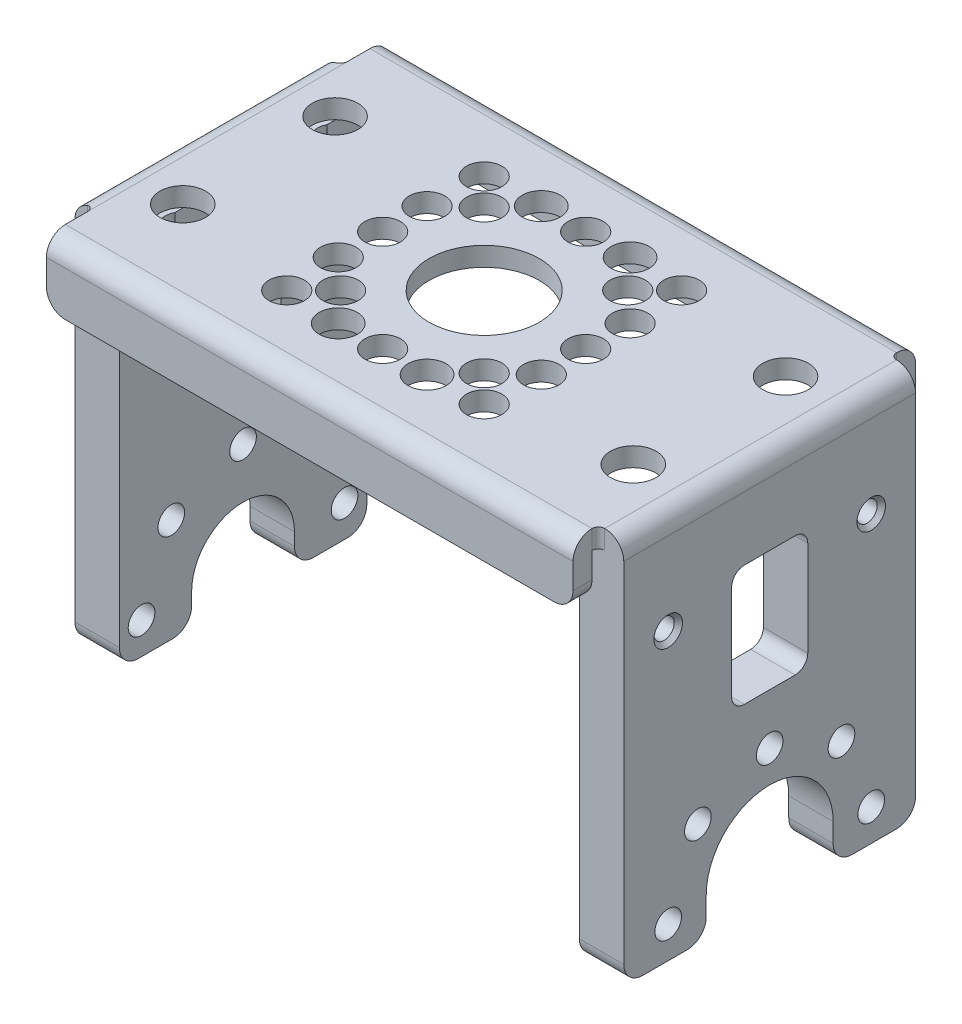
ISO-10303-21;
HEADER;
FILE_DESCRIPTION(('STEP AP214'),'2;1');
FILE_NAME('part.step','',(''),(''),'','','');
FILE_SCHEMA(('AUTOMOTIVE_DESIGN { 1 0 10303 214 1 1 1 1 }'));
ENDSEC;
DATA;
#1=APPLICATION_CONTEXT('core data for automotive mechanical design processes');
#2=APPLICATION_PROTOCOL_DEFINITION('international standard','automotive_design',2000,#1);
#3=PRODUCT_CONTEXT('',#1,'mechanical');
#4=PRODUCT('Part','Part','',(#3));
#5=PRODUCT_RELATED_PRODUCT_CATEGORY('part','',(#4));
#6=PRODUCT_DEFINITION_FORMATION('','',#4);
#7=PRODUCT_DEFINITION_CONTEXT('part definition',#1,'design');
#8=PRODUCT_DEFINITION('design','',#6,#7);
#9=PRODUCT_DEFINITION_SHAPE('','',#8);
#10=(LENGTH_UNIT() NAMED_UNIT(*) SI_UNIT(.MILLI.,.METRE.));
#11=(NAMED_UNIT(*) PLANE_ANGLE_UNIT() SI_UNIT($,.RADIAN.));
#12=(NAMED_UNIT(*) SI_UNIT($,.STERADIAN.) SOLID_ANGLE_UNIT());
#13=UNCERTAINTY_MEASURE_WITH_UNIT(LENGTH_MEASURE(1.E-05),#10,'distance_accuracy_value','');
#14=(GEOMETRIC_REPRESENTATION_CONTEXT(3) GLOBAL_UNCERTAINTY_ASSIGNED_CONTEXT((#13)) GLOBAL_UNIT_ASSIGNED_CONTEXT((#10,
#11,#12)) REPRESENTATION_CONTEXT('',''));
#15=CARTESIAN_POINT('',(0.,0.,0.));
#16=DIRECTION('',(0.,0.,1.));
#17=DIRECTION('',(1.,0.,0.));
#18=AXIS2_PLACEMENT_3D('',#15,#16,#17);
#19=CARTESIAN_POINT('',(-22.5,-1.5,11.5));
#20=DIRECTION('',(0.,1.,0.));
#21=DIRECTION('',(1.,0.,0.));
#22=AXIS2_PLACEMENT_3D('',#19,#20,#21);
#23=PLANE('',#22);
#24=CARTESIAN_POINT('',(-17.75,-1.5,-6.));
#25=DIRECTION('',(0.,-1.,0.));
#26=DIRECTION('',(-1.,0.,0.));
#27=AXIS2_PLACEMENT_3D('',#24,#25,#26);
#28=CIRCLE('',#27,1.8);
#29=CARTESIAN_POINT('',(-19.,-1.5,-4.70481661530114));
#30=VERTEX_POINT('',#29);
#31=CARTESIAN_POINT('',(-19.,-1.5,-7.29518338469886));
#32=VERTEX_POINT('',#31);
#33=EDGE_CURVE('E1404',#30,#32,#28,.T.);
#34=ORIENTED_EDGE('',*,*,#33,.F.);
#35=DIRECTION('',(0.,0.,1.));
#36=VECTOR('',#35,1.);
#37=CARTESIAN_POINT('',(-19.,-1.5,-9.75));
#38=LINE('',#37,#36);
#39=CARTESIAN_POINT('',(-19.,-1.5,-5.36952398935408));
#40=VERTEX_POINT('',#39);
#41=EDGE_CURVE('E847',#40,#30,#38,.T.);
#42=ORIENTED_EDGE('',*,*,#41,.F.);
#43=CARTESIAN_POINT('',(-17.75,-1.5,-6.));
#44=DIRECTION('',(0.,1.,0.));
#45=DIRECTION('',(-1.,0.,0.));
#46=AXIS2_PLACEMENT_3D('',#43,#44,#45);
#47=CIRCLE('',#46,1.4);
#48=CARTESIAN_POINT('',(-19.,-1.5,-6.63047601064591));
#49=VERTEX_POINT('',#48);
#50=EDGE_CURVE('E1630',#49,#40,#47,.T.);
#51=ORIENTED_EDGE('',*,*,#50,.F.);
#52=DIRECTION('',(0.,0.,1.));
#53=VECTOR('',#52,1.);
#54=CARTESIAN_POINT('',(-19.,-1.5,0.));
#55=LINE('',#54,#53);
#56=EDGE_CURVE('E688',#32,#49,#55,.T.);
#57=ORIENTED_EDGE('',*,*,#56,.F.);
#58=EDGE_LOOP('',(#34,#42,#51,#57));
#59=FACE_BOUND('',#58,.T.);
#60=ADVANCED_FACE('F17',(#59),#23,.T.);
#61=CARTESIAN_POINT('',(-22.5,-1.5,11.5));
#62=DIRECTION('',(0.,1.,0.));
#63=DIRECTION('',(1.,0.,0.));
#64=AXIS2_PLACEMENT_3D('',#61,#62,#63);
#65=PLANE('',#64);
#66=CARTESIAN_POINT('',(-17.75,-1.5,6.));
#67=DIRECTION('',(0.,-1.,0.));
#68=DIRECTION('',(-1.,0.,0.));
#69=AXIS2_PLACEMENT_3D('',#66,#67,#68);
#70=CIRCLE('',#69,1.8);
#71=CARTESIAN_POINT('',(-19.,-1.5,7.29518338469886));
#72=VERTEX_POINT('',#71);
#73=CARTESIAN_POINT('',(-19.,-1.5,4.70481661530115));
#74=VERTEX_POINT('',#73);
#75=EDGE_CURVE('E1348',#72,#74,#70,.T.);
#76=ORIENTED_EDGE('',*,*,#75,.F.);
#77=DIRECTION('',(0.,0.,1.));
#78=VECTOR('',#77,1.);
#79=CARTESIAN_POINT('',(-19.,-1.5,-9.75));
#80=LINE('',#79,#78);
#81=CARTESIAN_POINT('',(-19.,-1.5,6.63047601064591));
#82=VERTEX_POINT('',#81);
#83=EDGE_CURVE('E865',#82,#72,#80,.T.);
#84=ORIENTED_EDGE('',*,*,#83,.F.);
#85=CARTESIAN_POINT('',(-17.75,-1.5,6.));
#86=DIRECTION('',(0.,1.,0.));
#87=DIRECTION('',(-1.,0.,0.));
#88=AXIS2_PLACEMENT_3D('',#85,#86,#87);
#89=CIRCLE('',#88,1.4);
#90=CARTESIAN_POINT('',(-19.,-1.5,5.3695239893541));
#91=VERTEX_POINT('',#90);
#92=EDGE_CURVE('E1620',#91,#82,#89,.T.);
#93=ORIENTED_EDGE('',*,*,#92,.F.);
#94=DIRECTION('',(0.,0.,1.));
#95=VECTOR('',#94,1.);
#96=CARTESIAN_POINT('',(-19.,-1.5,0.));
#97=LINE('',#96,#95);
#98=EDGE_CURVE('E857',#74,#91,#97,.T.);
#99=ORIENTED_EDGE('',*,*,#98,.F.);
#100=EDGE_LOOP('',(#76,#84,#93,#99));
#101=FACE_BOUND('',#100,.T.);
#102=ADVANCED_FACE('F1337',(#101),#65,.T.);
#103=CARTESIAN_POINT('',(-22.5,-1.5,11.5));
#104=DIRECTION('',(0.,1.,0.));
#105=DIRECTION('',(1.,0.,0.));
#106=AXIS2_PLACEMENT_3D('',#103,#104,#105);
#107=PLANE('',#106);
#108=CARTESIAN_POINT('',(17.75,-1.5,6.));
#109=DIRECTION('',(0.,1.,0.));
#110=DIRECTION('',(-1.,0.,0.));
#111=AXIS2_PLACEMENT_3D('',#108,#109,#110);
#112=CIRCLE('',#111,1.8);
#113=CARTESIAN_POINT('',(19.,-1.5,7.29518338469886));
#114=VERTEX_POINT('',#113);
#115=CARTESIAN_POINT('',(19.,-1.5,4.70481661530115));
#116=VERTEX_POINT('',#115);
#117=EDGE_CURVE('E11',#114,#116,#112,.T.);
#118=ORIENTED_EDGE('',*,*,#117,.T.);
#119=DIRECTION('',(0.,0.,-1.));
#120=VECTOR('',#119,1.);
#121=CARTESIAN_POINT('',(19.,-1.5,11.5));
#122=LINE('',#121,#120);
#123=CARTESIAN_POINT('',(19.,-1.5,5.36952398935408));
#124=VERTEX_POINT('',#123);
#125=EDGE_CURVE('E709',#124,#116,#122,.T.);
#126=ORIENTED_EDGE('',*,*,#125,.F.);
#127=CARTESIAN_POINT('',(17.75,-1.5,6.));
#128=DIRECTION('',(0.,1.,0.));
#129=DIRECTION('',(-1.,0.,0.));
#130=AXIS2_PLACEMENT_3D('',#127,#128,#129);
#131=CIRCLE('',#130,1.4);
#132=CARTESIAN_POINT('',(19.,-1.5,6.63047601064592));
#133=VERTEX_POINT('',#132);
#134=EDGE_CURVE('E728',#133,#124,#131,.T.);
#135=ORIENTED_EDGE('',*,*,#134,.F.);
#136=DIRECTION('',(0.,0.,-1.));
#137=VECTOR('',#136,1.);
#138=CARTESIAN_POINT('',(19.,-1.5,6.5));
#139=LINE('',#138,#137);
#140=EDGE_CURVE('E801',#114,#133,#139,.T.);
#141=ORIENTED_EDGE('',*,*,#140,.F.);
#142=EDGE_LOOP('',(#118,#126,#135,#141));
#143=FACE_BOUND('',#142,.T.);
#144=ADVANCED_FACE('F1334',(#143),#107,.T.);
#145=CARTESIAN_POINT('',(-22.5,-1.5,11.5));
#146=DIRECTION('',(0.,1.,0.));
#147=DIRECTION('',(1.,0.,0.));
#148=AXIS2_PLACEMENT_3D('',#145,#146,#147);
#149=PLANE('',#148);
#150=CARTESIAN_POINT('',(17.75,-1.5,-6.));
#151=DIRECTION('',(0.,1.,0.));
#152=DIRECTION('',(-1.,0.,0.));
#153=AXIS2_PLACEMENT_3D('',#150,#151,#152);
#154=CIRCLE('',#153,1.8);
#155=CARTESIAN_POINT('',(19.,-1.5,-4.70481661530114));
#156=VERTEX_POINT('',#155);
#157=CARTESIAN_POINT('',(19.,-1.5,-7.29518338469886));
#158=VERTEX_POINT('',#157);
#159=EDGE_CURVE('E33',#156,#158,#154,.T.);
#160=ORIENTED_EDGE('',*,*,#159,.T.);
#161=DIRECTION('',(0.,0.,-1.));
#162=VECTOR('',#161,1.);
#163=CARTESIAN_POINT('',(19.,-1.5,11.5));
#164=LINE('',#163,#162);
#165=CARTESIAN_POINT('',(19.,-1.5,-6.63047601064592));
#166=VERTEX_POINT('',#165);
#167=EDGE_CURVE('E751',#166,#158,#164,.T.);
#168=ORIENTED_EDGE('',*,*,#167,.F.);
#169=CARTESIAN_POINT('',(17.75,-1.5,-6.));
#170=DIRECTION('',(0.,1.,0.));
#171=DIRECTION('',(-1.,0.,0.));
#172=AXIS2_PLACEMENT_3D('',#169,#170,#171);
#173=CIRCLE('',#172,1.4);
#174=CARTESIAN_POINT('',(19.,-1.5,-5.36952398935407));
#175=VERTEX_POINT('',#174);
#176=EDGE_CURVE('E737',#175,#166,#173,.T.);
#177=ORIENTED_EDGE('',*,*,#176,.F.);
#178=DIRECTION('',(0.,0.,-1.));
#179=VECTOR('',#178,1.);
#180=CARTESIAN_POINT('',(19.,-1.5,6.5));
#181=LINE('',#180,#179);
#182=EDGE_CURVE('E745',#156,#175,#181,.T.);
#183=ORIENTED_EDGE('',*,*,#182,.F.);
#184=EDGE_LOOP('',(#160,#168,#177,#183));
#185=FACE_BOUND('',#184,.T.);
#186=ADVANCED_FACE('F1330',(#185),#149,.T.);
#187=CARTESIAN_POINT('',(17.75,-6.5,-6.));
#188=DIRECTION('',(0.,-1.,0.));
#189=DIRECTION('',(-1.,0.,0.));
#190=AXIS2_PLACEMENT_3D('',#187,#188,#189);
#191=PLANE('',#190);
#192=DIRECTION('',(0.,0.,1.));
#193=VECTOR('',#192,1.);
#194=CARTESIAN_POINT('',(19.,-6.5,6.5));
#195=LINE('',#194,#193);
#196=CARTESIAN_POINT('',(19.,-6.5,-6.63047601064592));
#197=VERTEX_POINT('',#196);
#198=CARTESIAN_POINT('',(19.,-6.5,-5.36952398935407));
#199=VERTEX_POINT('',#198);
#200=EDGE_CURVE('E748',#197,#199,#195,.T.);
#201=ORIENTED_EDGE('',*,*,#200,.T.);
#202=CARTESIAN_POINT('',(17.75,-6.5,-6.));
#203=DIRECTION('',(0.,-1.,0.));
#204=DIRECTION('',(1.,0.,0.));
#205=AXIS2_PLACEMENT_3D('',#202,#203,#204);
#206=CIRCLE('',#205,1.4);
#207=EDGE_CURVE('E705',#197,#199,#206,.T.);
#208=ORIENTED_EDGE('',*,*,#207,.F.);
#209=EDGE_LOOP('',(#201,#208));
#210=FACE_BOUND('',#209,.T.);
#211=ADVANCED_FACE('F1326',(#210),#191,.F.);
#212=CARTESIAN_POINT('',(17.75,-6.5,6.));
#213=DIRECTION('',(0.,-1.,0.));
#214=DIRECTION('',(-1.,0.,0.));
#215=AXIS2_PLACEMENT_3D('',#212,#213,#214);
#216=PLANE('',#215);
#217=DIRECTION('',(0.,0.,1.));
#218=VECTOR('',#217,1.);
#219=CARTESIAN_POINT('',(19.,-6.5,6.5));
#220=LINE('',#219,#218);
#221=CARTESIAN_POINT('',(19.,-6.5,5.36952398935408));
#222=VERTEX_POINT('',#221);
#223=CARTESIAN_POINT('',(19.,-6.5,6.63047601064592));
#224=VERTEX_POINT('',#223);
#225=EDGE_CURVE('E804',#222,#224,#220,.T.);
#226=ORIENTED_EDGE('',*,*,#225,.T.);
#227=CARTESIAN_POINT('',(17.75,-6.5,6.));
#228=DIRECTION('',(0.,-1.,0.));
#229=DIRECTION('',(1.,0.,0.));
#230=AXIS2_PLACEMENT_3D('',#227,#228,#229);
#231=CIRCLE('',#230,1.4);
#232=EDGE_CURVE('E736',#222,#224,#231,.T.);
#233=ORIENTED_EDGE('',*,*,#232,.F.);
#234=EDGE_LOOP('',(#226,#233));
#235=FACE_BOUND('',#234,.T.);
#236=ADVANCED_FACE('F1322',(#235),#216,.F.);
#237=CARTESIAN_POINT('',(-17.75,-6.5,6.));
#238=DIRECTION('',(0.,-1.,0.));
#239=DIRECTION('',(-1.,0.,0.));
#240=AXIS2_PLACEMENT_3D('',#237,#238,#239);
#241=PLANE('',#240);
#242=DIRECTION('',(0.,0.,-1.));
#243=VECTOR('',#242,1.);
#244=CARTESIAN_POINT('',(-19.,-6.5,0.));
#245=LINE('',#244,#243);
#246=CARTESIAN_POINT('',(-19.,-6.5,6.63047601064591));
#247=VERTEX_POINT('',#246);
#248=CARTESIAN_POINT('',(-19.,-6.5,5.3695239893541));
#249=VERTEX_POINT('',#248);
#250=EDGE_CURVE('E861',#247,#249,#245,.T.);
#251=ORIENTED_EDGE('',*,*,#250,.T.);
#252=CARTESIAN_POINT('',(-17.75,-6.5,6.));
#253=DIRECTION('',(0.,-1.,0.));
#254=DIRECTION('',(1.,0.,0.));
#255=AXIS2_PLACEMENT_3D('',#252,#253,#254);
#256=CIRCLE('',#255,1.4);
#257=EDGE_CURVE('E1617',#247,#249,#256,.T.);
#258=ORIENTED_EDGE('',*,*,#257,.F.);
#259=EDGE_LOOP('',(#251,#258));
#260=FACE_BOUND('',#259,.T.);
#261=ADVANCED_FACE('F1318',(#260),#241,.F.);
#262=CARTESIAN_POINT('',(-17.75,-6.5,-6.));
#263=DIRECTION('',(0.,-1.,0.));
#264=DIRECTION('',(-1.,0.,0.));
#265=AXIS2_PLACEMENT_3D('',#262,#263,#264);
#266=PLANE('',#265);
#267=DIRECTION('',(0.,0.,-1.));
#268=VECTOR('',#267,1.);
#269=CARTESIAN_POINT('',(-19.,-6.5,0.));
#270=LINE('',#269,#268);
#271=CARTESIAN_POINT('',(-19.,-6.5,-5.36952398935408));
#272=VERTEX_POINT('',#271);
#273=CARTESIAN_POINT('',(-19.,-6.5,-6.63047601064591));
#274=VERTEX_POINT('',#273);
#275=EDGE_CURVE('E692',#272,#274,#270,.T.);
#276=ORIENTED_EDGE('',*,*,#275,.T.);
#277=CARTESIAN_POINT('',(-17.75,-6.5,-6.));
#278=DIRECTION('',(0.,-1.,0.));
#279=DIRECTION('',(1.,0.,0.));
#280=AXIS2_PLACEMENT_3D('',#277,#278,#279);
#281=CIRCLE('',#280,1.4);
#282=EDGE_CURVE('E1627',#272,#274,#281,.T.);
#283=ORIENTED_EDGE('',*,*,#282,.F.);
#284=EDGE_LOOP('',(#276,#283));
#285=FACE_BOUND('',#284,.T.);
#286=ADVANCED_FACE('F1314',(#285),#266,.F.);
#287=CARTESIAN_POINT('',(19.,-27.5,5.));
#288=DIRECTION('',(0.,0.,1.));
#289=DIRECTION('',(1.,0.,0.));
#290=AXIS2_PLACEMENT_3D('',#287,#288,#289);
#291=PLANE('',#290);
#292=DIRECTION('',(0.,1.,0.));
#293=VECTOR('',#292,1.);
#294=CARTESIAN_POINT('',(22.5,0.,5.));
#295=LINE('',#294,#293);
#296=CARTESIAN_POINT('',(22.5,-29.,5.));
#297=VERTEX_POINT('',#296);
#298=CARTESIAN_POINT('',(22.5,-27.5,5.));
#299=VERTEX_POINT('',#298);
#300=EDGE_CURVE('E682',#297,#299,#295,.T.);
#301=ORIENTED_EDGE('',*,*,#300,.F.);
#302=DIRECTION('',(1.,0.,0.));
#303=VECTOR('',#302,1.);
#304=CARTESIAN_POINT('',(19.,-29.,5.));
#305=LINE('',#304,#303);
#306=CARTESIAN_POINT('',(19.,-29.,5.));
#307=VERTEX_POINT('',#306);
#308=EDGE_CURVE('E1211',#307,#297,#305,.T.);
#309=ORIENTED_EDGE('',*,*,#308,.F.);
#310=DIRECTION('',(0.,-1.,0.));
#311=VECTOR('',#310,1.);
#312=CARTESIAN_POINT('',(19.,-27.5,5.));
#313=LINE('',#312,#311);
#314=CARTESIAN_POINT('',(19.,-27.5,5.));
#315=VERTEX_POINT('',#314);
#316=EDGE_CURVE('E785',#315,#307,#313,.T.);
#317=ORIENTED_EDGE('',*,*,#316,.F.);
#318=DIRECTION('',(1.,0.,0.));
#319=VECTOR('',#318,1.);
#320=CARTESIAN_POINT('',(19.,-27.5,5.));
#321=LINE('',#320,#319);
#322=EDGE_CURVE('E1221',#315,#299,#321,.T.);
#323=ORIENTED_EDGE('',*,*,#322,.T.);
#324=EDGE_LOOP('',(#301,#309,#317,#323));
#325=FACE_BOUND('',#324,.T.);
#326=ADVANCED_FACE('F1310',(#325),#291,.F.);
#327=CARTESIAN_POINT('',(19.,-27.5,0.));
#328=DIRECTION('',(1.,0.,0.));
#329=DIRECTION('',(0.,0.,-1.));
#330=AXIS2_PLACEMENT_3D('',#327,#328,#329);
#331=CYLINDRICAL_SURFACE('',#330,5.);
#332=CARTESIAN_POINT('',(22.5,-27.5,0.));
#333=DIRECTION('',(1.,0.,0.));
#334=DIRECTION('',(0.,0.,-1.));
#335=AXIS2_PLACEMENT_3D('',#332,#333,#334);
#336=CIRCLE('',#335,5.);
#337=CARTESIAN_POINT('',(22.5,-27.5,-5.));
#338=VERTEX_POINT('',#337);
#339=EDGE_CURVE('E813',#338,#299,#336,.T.);
#340=ORIENTED_EDGE('',*,*,#339,.T.);
#341=ORIENTED_EDGE('',*,*,#322,.F.);
#342=CARTESIAN_POINT('',(19.,-27.5,0.));
#343=DIRECTION('',(1.,0.,0.));
#344=DIRECTION('',(0.,0.,1.));
#345=AXIS2_PLACEMENT_3D('',#342,#343,#344);
#346=CIRCLE('',#345,5.);
#347=CARTESIAN_POINT('',(19.,-27.5,-5.));
#348=VERTEX_POINT('',#347);
#349=EDGE_CURVE('E781',#348,#315,#346,.T.);
#350=ORIENTED_EDGE('',*,*,#349,.F.);
#351=DIRECTION('',(1.,0.,0.));
#352=VECTOR('',#351,1.);
#353=CARTESIAN_POINT('',(19.,-27.5,-5.));
#354=LINE('',#353,#352);
#355=EDGE_CURVE('E1218',#348,#338,#354,.T.);
#356=ORIENTED_EDGE('',*,*,#355,.T.);
#357=EDGE_LOOP('',(#340,#341,#350,#356));
#358=FACE_BOUND('',#357,.T.);
#359=ADVANCED_FACE('F1307',(#358),#331,.F.);
#360=CARTESIAN_POINT('',(19.,-29.,-5.));
#361=DIRECTION('',(0.,0.,-1.));
#362=DIRECTION('',(0.,-1.,0.));
#363=AXIS2_PLACEMENT_3D('',#360,#361,#362);
#364=PLANE('',#363);
#365=DIRECTION('',(0.,-1.,0.));
#366=VECTOR('',#365,1.);
#367=CARTESIAN_POINT('',(22.5,0.,-5.));
#368=LINE('',#367,#366);
#369=CARTESIAN_POINT('',(22.5,-29.,-5.));
#370=VERTEX_POINT('',#369);
#371=EDGE_CURVE('E808',#338,#370,#368,.T.);
#372=ORIENTED_EDGE('',*,*,#371,.F.);
#373=ORIENTED_EDGE('',*,*,#355,.F.);
#374=DIRECTION('',(0.,1.,0.));
#375=VECTOR('',#374,1.);
#376=CARTESIAN_POINT('',(19.,-29.,-5.));
#377=LINE('',#376,#375);
#378=CARTESIAN_POINT('',(19.,-29.,-5.));
#379=VERTEX_POINT('',#378);
#380=EDGE_CURVE('E771',#379,#348,#377,.T.);
#381=ORIENTED_EDGE('',*,*,#380,.F.);
#382=DIRECTION('',(1.,0.,0.));
#383=VECTOR('',#382,1.);
#384=CARTESIAN_POINT('',(19.,-29.,-5.));
#385=LINE('',#384,#383);
#386=EDGE_CURVE('E1214',#379,#370,#385,.T.);
#387=ORIENTED_EDGE('',*,*,#386,.T.);
#388=EDGE_LOOP('',(#372,#373,#381,#387));
#389=FACE_BOUND('',#388,.T.);
#390=ADVANCED_FACE('F1305',(#389),#364,.F.);
#391=CARTESIAN_POINT('',(19.,-29.,-6.5));
#392=DIRECTION('',(1.,0.,0.));
#393=DIRECTION('',(0.,0.,-1.));
#394=AXIS2_PLACEMENT_3D('',#391,#392,#393);
#395=CYLINDRICAL_SURFACE('',#394,1.5);
#396=CARTESIAN_POINT('',(22.5,-29.,-6.5));
#397=DIRECTION('',(1.,0.,0.));
#398=DIRECTION('',(0.,0.,-1.));
#399=AXIS2_PLACEMENT_3D('',#396,#397,#398);
#400=CIRCLE('',#399,1.5);
#401=CARTESIAN_POINT('',(22.5,-30.5,-6.5));
#402=VERTEX_POINT('',#401);
#403=EDGE_CURVE('E812',#370,#402,#400,.T.);
#404=ORIENTED_EDGE('',*,*,#403,.F.);
#405=ORIENTED_EDGE('',*,*,#386,.F.);
#406=CARTESIAN_POINT('',(19.,-29.,-6.5));
#407=DIRECTION('',(-1.,0.,0.));
#408=DIRECTION('',(0.,0.,1.));
#409=AXIS2_PLACEMENT_3D('',#406,#407,#408);
#410=CIRCLE('',#409,1.5);
#411=CARTESIAN_POINT('',(19.,-30.5,-6.5));
#412=VERTEX_POINT('',#411);
#413=EDGE_CURVE('E767',#412,#379,#410,.T.);
#414=ORIENTED_EDGE('',*,*,#413,.F.);
#415=DIRECTION('',(1.,0.,0.));
#416=VECTOR('',#415,1.);
#417=CARTESIAN_POINT('',(19.,-30.5,-6.5));
#418=LINE('',#417,#416);
#419=EDGE_CURVE('E853',#412,#402,#418,.T.);
#420=ORIENTED_EDGE('',*,*,#419,.T.);
#421=EDGE_LOOP('',(#404,#405,#414,#420));
#422=FACE_BOUND('',#421,.T.);
#423=ADVANCED_FACE('F1301',(#422),#395,.T.);
#424=CARTESIAN_POINT('',(19.,-29.,6.5));
#425=DIRECTION('',(1.,0.,0.));
#426=DIRECTION('',(0.,0.,-1.));
#427=AXIS2_PLACEMENT_3D('',#424,#425,#426);
#428=CYLINDRICAL_SURFACE('',#427,1.5);
#429=CARTESIAN_POINT('',(22.5,-29.,6.5));
#430=DIRECTION('',(1.,0.,0.));
#431=DIRECTION('',(0.,0.,-1.));
#432=AXIS2_PLACEMENT_3D('',#429,#430,#431);
#433=CIRCLE('',#432,1.5);
#434=CARTESIAN_POINT('',(22.5,-30.5,6.5));
#435=VERTEX_POINT('',#434);
#436=EDGE_CURVE('E678',#435,#297,#433,.T.);
#437=ORIENTED_EDGE('',*,*,#436,.F.);
#438=DIRECTION('',(1.,0.,0.));
#439=VECTOR('',#438,1.);
#440=CARTESIAN_POINT('',(19.,-30.5,6.5));
#441=LINE('',#440,#439);
#442=CARTESIAN_POINT('',(19.,-30.5,6.5));
#443=VERTEX_POINT('',#442);
#444=EDGE_CURVE('E1013',#443,#435,#441,.T.);
#445=ORIENTED_EDGE('',*,*,#444,.F.);
#446=CARTESIAN_POINT('',(19.,-29.,6.5));
#447=DIRECTION('',(-1.,0.,0.));
#448=DIRECTION('',(0.,0.,1.));
#449=AXIS2_PLACEMENT_3D('',#446,#447,#448);
#450=CIRCLE('',#449,1.5);
#451=EDGE_CURVE('E789',#307,#443,#450,.T.);
#452=ORIENTED_EDGE('',*,*,#451,.F.);
#453=ORIENTED_EDGE('',*,*,#308,.T.);
#454=EDGE_LOOP('',(#437,#445,#452,#453));
#455=FACE_BOUND('',#454,.T.);
#456=ADVANCED_FACE('F1304',(#455),#428,.T.);
#457=CARTESIAN_POINT('',(0.,-1.5,-12.));
#458=DIRECTION('',(-1.,0.,0.));
#459=DIRECTION('',(0.,0.,1.));
#460=AXIS2_PLACEMENT_3D('',#457,#458,#459);
#461=CYLINDRICAL_SURFACE('',#460,1.5);
#462=CARTESIAN_POINT('',(-21.,-1.5,-12.));
#463=DIRECTION('',(-1.,0.,0.));
#464=DIRECTION('',(0.,0.,-1.));
#465=AXIS2_PLACEMENT_3D('',#462,#463,#464);
#466=CIRCLE('',#465,1.5);
#467=CARTESIAN_POINT('',(-21.,0.,-12.));
#468=VERTEX_POINT('',#467);
#469=CARTESIAN_POINT('',(-21.,-1.5,-13.5));
#470=VERTEX_POINT('',#469);
#471=EDGE_CURVE('E92',#468,#470,#466,.T.);
#472=ORIENTED_EDGE('',*,*,#471,.F.);
#473=DIRECTION('',(-1.,0.,0.));
#474=VECTOR('',#473,1.);
#475=CARTESIAN_POINT('',(-21.,0.,-12.));
#476=LINE('',#475,#474);
#477=CARTESIAN_POINT('',(20.5,0.,-12.));
#478=VERTEX_POINT('',#477);
#479=EDGE_CURVE('E701',#478,#468,#476,.T.);
#480=ORIENTED_EDGE('',*,*,#479,.F.);
#481=CARTESIAN_POINT('',(20.5,-1.5,-12.));
#482=DIRECTION('',(1.,0.,0.));
#483=DIRECTION('',(0.,0.,1.));
#484=AXIS2_PLACEMENT_3D('',#481,#482,#483);
#485=CIRCLE('',#484,1.5);
#486=CARTESIAN_POINT('',(20.5,-1.5,-13.5));
#487=VERTEX_POINT('',#486);
#488=EDGE_CURVE('E604',#487,#478,#485,.T.);
#489=ORIENTED_EDGE('',*,*,#488,.F.);
#490=DIRECTION('',(1.,0.,0.));
#491=VECTOR('',#490,1.);
#492=CARTESIAN_POINT('',(20.5,-1.5,-13.5));
#493=LINE('',#492,#491);
#494=EDGE_CURVE('E1106',#470,#487,#493,.T.);
#495=ORIENTED_EDGE('',*,*,#494,.F.);
#496=EDGE_LOOP('',(#472,#480,#489,#495));
#497=FACE_BOUND('',#496,.T.);
#498=ADVANCED_FACE('F1916',(#497),#461,.T.);
#499=CARTESIAN_POINT('',(-22.5,-29.,-10.));
#500=DIRECTION('',(-1.,0.,0.));
#501=DIRECTION('',(0.,0.,1.));
#502=AXIS2_PLACEMENT_3D('',#499,#500,#501);
#503=CYLINDRICAL_SURFACE('',#502,1.5);
#504=CARTESIAN_POINT('',(22.5,-29.,-10.));
#505=DIRECTION('',(1.,0.,0.));
#506=DIRECTION('',(0.,0.,-1.));
#507=AXIS2_PLACEMENT_3D('',#504,#505,#506);
#508=CIRCLE('',#507,1.5);
#509=CARTESIAN_POINT('',(22.5,-30.5,-10.));
#510=VERTEX_POINT('',#509);
#511=CARTESIAN_POINT('',(22.5,-29.,-11.5));
#512=VERTEX_POINT('',#511);
#513=EDGE_CURVE('E984',#510,#512,#508,.T.);
#514=ORIENTED_EDGE('',*,*,#513,.F.);
#515=DIRECTION('',(1.,0.,0.));
#516=VECTOR('',#515,1.);
#517=CARTESIAN_POINT('',(22.5,-30.5,-10.));
#518=LINE('',#517,#516);
#519=CARTESIAN_POINT('',(19.,-30.5,-10.));
#520=VERTEX_POINT('',#519);
#521=EDGE_CURVE('E848',#520,#510,#518,.T.);
#522=ORIENTED_EDGE('',*,*,#521,.F.);
#523=CARTESIAN_POINT('',(19.,-29.,-10.));
#524=DIRECTION('',(-1.,0.,0.));
#525=DIRECTION('',(0.,0.,1.));
#526=AXIS2_PLACEMENT_3D('',#523,#524,#525);
#527=CIRCLE('',#526,1.5);
#528=CARTESIAN_POINT('',(19.,-29.,-11.5));
#529=VERTEX_POINT('',#528);
#530=EDGE_CURVE('E759',#529,#520,#527,.T.);
#531=ORIENTED_EDGE('',*,*,#530,.F.);
#532=DIRECTION('',(-1.,0.,0.));
#533=VECTOR('',#532,1.);
#534=CARTESIAN_POINT('',(21.,-29.,-11.5));
#535=LINE('',#534,#533);
#536=EDGE_CURVE('E949',#512,#529,#535,.T.);
#537=ORIENTED_EDGE('',*,*,#536,.F.);
#538=EDGE_LOOP('',(#514,#522,#531,#537));
#539=FACE_BOUND('',#538,.T.);
#540=ADVANCED_FACE('F1300',(#539),#503,.T.);
#541=CARTESIAN_POINT('',(-19.5,-3.5,0.));
#542=DIRECTION('',(0.,0.,-1.));
#543=DIRECTION('',(-1.,0.,0.));
#544=AXIS2_PLACEMENT_3D('',#541,#542,#543);
#545=CYLINDRICAL_SURFACE('',#544,1.5);
#546=CARTESIAN_POINT('',(-19.5,-3.5,13.5));
#547=DIRECTION('',(0.,0.,1.));
#548=DIRECTION('',(-1.,0.,0.));
#549=AXIS2_PLACEMENT_3D('',#546,#547,#548);
#550=CIRCLE('',#549,1.5);
#551=CARTESIAN_POINT('',(-21.,-3.5,13.5));
#552=VERTEX_POINT('',#551);
#553=CARTESIAN_POINT('',(-19.5,-5.,13.5));
#554=VERTEX_POINT('',#553);
#555=EDGE_CURVE('E1171',#552,#554,#550,.T.);
#556=ORIENTED_EDGE('',*,*,#555,.F.);
#557=DIRECTION('',(0.,0.,1.));
#558=VECTOR('',#557,1.);
#559=CARTESIAN_POINT('',(-21.,-3.5,11.5));
#560=LINE('',#559,#558);
#561=CARTESIAN_POINT('',(-21.,-3.5,12.));
#562=VERTEX_POINT('',#561);
#563=EDGE_CURVE('E995',#562,#552,#560,.T.);
#564=ORIENTED_EDGE('',*,*,#563,.F.);
#565=CARTESIAN_POINT('',(-19.5,-3.5,12.));
#566=DIRECTION('',(0.,0.,-1.));
#567=DIRECTION('',(1.,0.,0.));
#568=AXIS2_PLACEMENT_3D('',#565,#566,#567);
#569=CIRCLE('',#568,1.5);
#570=CARTESIAN_POINT('',(-19.5,-5.,12.));
#571=VERTEX_POINT('',#570);
#572=EDGE_CURVE('E1178',#571,#562,#569,.T.);
#573=ORIENTED_EDGE('',*,*,#572,.F.);
#574=DIRECTION('',(0.,0.,-1.));
#575=VECTOR('',#574,1.);
#576=CARTESIAN_POINT('',(-19.5,-5.,0.));
#577=LINE('',#576,#575);
#578=EDGE_CURVE('E48',#554,#571,#577,.T.);
#579=ORIENTED_EDGE('',*,*,#578,.F.);
#580=EDGE_LOOP('',(#556,#564,#573,#579));
#581=FACE_BOUND('',#580,.T.);
#582=ADVANCED_FACE('F1297',(#581),#545,.T.);
#583=CARTESIAN_POINT('',(0.,-29.,5.55));
#584=DIRECTION('',(1.,0.,0.));
#585=DIRECTION('',(0.,1.,0.));
#586=AXIS2_PLACEMENT_3D('',#583,#584,#585);
#587=CYLINDRICAL_SURFACE('',#586,1.5);
#588=CARTESIAN_POINT('',(-22.5,-29.,5.55));
#589=DIRECTION('',(-1.,0.,0.));
#590=DIRECTION('',(0.,0.,1.));
#591=AXIS2_PLACEMENT_3D('',#588,#589,#590);
#592=CIRCLE('',#591,1.5);
#593=CARTESIAN_POINT('',(-22.5,-29.,4.05));
#594=VERTEX_POINT('',#593);
#595=CARTESIAN_POINT('',(-22.5,-30.5,5.55));
#596=VERTEX_POINT('',#595);
#597=EDGE_CURVE('E1034',#594,#596,#592,.T.);
#598=ORIENTED_EDGE('',*,*,#597,.F.);
#599=DIRECTION('',(-1.,0.,0.));
#600=VECTOR('',#599,1.);
#601=CARTESIAN_POINT('',(-22.5,-29.,4.05));
#602=LINE('',#601,#600);
#603=CARTESIAN_POINT('',(-19.,-29.,4.05));
#604=VERTEX_POINT('',#603);
#605=EDGE_CURVE('E1185',#604,#594,#602,.T.);
#606=ORIENTED_EDGE('',*,*,#605,.F.);
#607=CARTESIAN_POINT('',(-19.,-29.,5.55));
#608=DIRECTION('',(1.,0.,0.));
#609=DIRECTION('',(0.,1.,0.));
#610=AXIS2_PLACEMENT_3D('',#607,#608,#609);
#611=CIRCLE('',#610,1.5);
#612=CARTESIAN_POINT('',(-19.,-30.5,5.55));
#613=VERTEX_POINT('',#612);
#614=EDGE_CURVE('E835',#613,#604,#611,.T.);
#615=ORIENTED_EDGE('',*,*,#614,.F.);
#616=DIRECTION('',(1.,0.,0.));
#617=VECTOR('',#616,1.);
#618=CARTESIAN_POINT('',(0.,-30.5,5.55));
#619=LINE('',#618,#617);
#620=EDGE_CURVE('E929',#596,#613,#619,.T.);
#621=ORIENTED_EDGE('',*,*,#620,.F.);
#622=EDGE_LOOP('',(#598,#606,#615,#621));
#623=FACE_BOUND('',#622,.T.);
#624=ADVANCED_FACE('F1295',(#623),#587,.T.);
#625=CARTESIAN_POINT('',(0.,-29.,10.));
#626=DIRECTION('',(1.,0.,0.));
#627=DIRECTION('',(0.,0.,-1.));
#628=AXIS2_PLACEMENT_3D('',#625,#626,#627);
#629=CYLINDRICAL_SURFACE('',#628,1.5);
#630=CARTESIAN_POINT('',(22.5,-29.,10.));
#631=DIRECTION('',(1.,0.,0.));
#632=DIRECTION('',(0.,0.,-1.));
#633=AXIS2_PLACEMENT_3D('',#630,#631,#632);
#634=CIRCLE('',#633,1.5);
#635=CARTESIAN_POINT('',(22.5,-29.,11.5));
#636=VERTEX_POINT('',#635);
#637=CARTESIAN_POINT('',(22.5,-30.5,10.));
#638=VERTEX_POINT('',#637);
#639=EDGE_CURVE('E962',#636,#638,#634,.T.);
#640=ORIENTED_EDGE('',*,*,#639,.F.);
#641=DIRECTION('',(1.,0.,0.));
#642=VECTOR('',#641,1.);
#643=CARTESIAN_POINT('',(0.,-29.,11.5));
#644=LINE('',#643,#642);
#645=CARTESIAN_POINT('',(19.,-29.,11.5));
#646=VERTEX_POINT('',#645);
#647=EDGE_CURVE('E899',#646,#636,#644,.T.);
#648=ORIENTED_EDGE('',*,*,#647,.F.);
#649=CARTESIAN_POINT('',(19.,-29.,10.));
#650=DIRECTION('',(-1.,0.,0.));
#651=DIRECTION('',(0.,0.,1.));
#652=AXIS2_PLACEMENT_3D('',#649,#650,#651);
#653=CIRCLE('',#652,1.5);
#654=CARTESIAN_POINT('',(19.,-30.5,10.));
#655=VERTEX_POINT('',#654);
#656=EDGE_CURVE('E794',#655,#646,#653,.T.);
#657=ORIENTED_EDGE('',*,*,#656,.F.);
#658=DIRECTION('',(-1.,0.,0.));
#659=VECTOR('',#658,1.);
#660=CARTESIAN_POINT('',(-22.5,-30.5,10.));
#661=LINE('',#660,#659);
#662=EDGE_CURVE('E980',#638,#655,#661,.T.);
#663=ORIENTED_EDGE('',*,*,#662,.F.);
#664=EDGE_LOOP('',(#640,#648,#657,#663));
#665=FACE_BOUND('',#664,.T.);
#666=ADVANCED_FACE('F1291',(#665),#629,.T.);
#667=CARTESIAN_POINT('',(0.,-29.,-8.25));
#668=DIRECTION('',(1.,0.,0.));
#669=DIRECTION('',(0.,1.,0.));
#670=AXIS2_PLACEMENT_3D('',#667,#668,#669);
#671=CYLINDRICAL_SURFACE('',#670,1.5);
#672=CARTESIAN_POINT('',(-22.5,-29.,-8.25));
#673=DIRECTION('',(-1.,0.,0.));
#674=DIRECTION('',(0.,0.,1.));
#675=AXIS2_PLACEMENT_3D('',#672,#673,#674);
#676=CIRCLE('',#675,1.5);
#677=CARTESIAN_POINT('',(-22.5,-29.,-9.75));
#678=VERTEX_POINT('',#677);
#679=CARTESIAN_POINT('',(-22.5,-30.5,-8.25));
#680=VERTEX_POINT('',#679);
#681=EDGE_CURVE('E1048',#678,#680,#676,.T.);
#682=ORIENTED_EDGE('',*,*,#681,.F.);
#683=DIRECTION('',(-1.,0.,0.));
#684=VECTOR('',#683,1.);
#685=CARTESIAN_POINT('',(-22.5,-29.,-9.75));
#686=LINE('',#685,#684);
#687=CARTESIAN_POINT('',(-19.,-29.,-9.75));
#688=VERTEX_POINT('',#687);
#689=EDGE_CURVE('E777',#688,#678,#686,.T.);
#690=ORIENTED_EDGE('',*,*,#689,.F.);
#691=CARTESIAN_POINT('',(-19.,-29.,-8.25));
#692=DIRECTION('',(1.,0.,0.));
#693=DIRECTION('',(0.,1.,0.));
#694=AXIS2_PLACEMENT_3D('',#691,#692,#693);
#695=CIRCLE('',#694,1.5);
#696=CARTESIAN_POINT('',(-19.,-30.5,-8.25));
#697=VERTEX_POINT('',#696);
#698=EDGE_CURVE('E891',#697,#688,#695,.T.);
#699=ORIENTED_EDGE('',*,*,#698,.F.);
#700=DIRECTION('',(1.,0.,0.));
#701=VECTOR('',#700,1.);
#702=CARTESIAN_POINT('',(0.,-30.5,-8.25));
#703=LINE('',#702,#701);
#704=EDGE_CURVE('E991',#680,#697,#703,.T.);
#705=ORIENTED_EDGE('',*,*,#704,.F.);
#706=EDGE_LOOP('',(#682,#690,#699,#705));
#707=FACE_BOUND('',#706,.T.);
#708=ADVANCED_FACE('F1294',(#707),#671,.T.);
#709=CARTESIAN_POINT('',(21.,-1.5,-11.5));
#710=DIRECTION('',(0.,0.,1.));
#711=DIRECTION('',(1.,0.,0.));
#712=AXIS2_PLACEMENT_3D('',#709,#710,#711);
#713=CYLINDRICAL_SURFACE('',#712,1.5);
#714=CARTESIAN_POINT('',(21.,-1.5,-11.5));
#715=DIRECTION('',(0.,0.,-1.));
#716=DIRECTION('',(1.,0.,0.));
#717=AXIS2_PLACEMENT_3D('',#714,#715,#716);
#718=CIRCLE('',#717,1.5);
#719=CARTESIAN_POINT('',(21.,0.,-11.5));
#720=VERTEX_POINT('',#719);
#721=CARTESIAN_POINT('',(22.5,-1.5,-11.5));
#722=VERTEX_POINT('',#721);
#723=EDGE_CURVE('E852',#720,#722,#718,.T.);
#724=ORIENTED_EDGE('',*,*,#723,.F.);
#725=DIRECTION('',(0.,0.,-1.));
#726=VECTOR('',#725,1.);
#727=CARTESIAN_POINT('',(21.,0.,-11.5));
#728=LINE('',#727,#726);
#729=CARTESIAN_POINT('',(21.,0.,11.5));
#730=VERTEX_POINT('',#729);
#731=EDGE_CURVE('E687',#730,#720,#728,.T.);
#732=ORIENTED_EDGE('',*,*,#731,.F.);
#733=CARTESIAN_POINT('',(21.,-1.5,11.5));
#734=DIRECTION('',(0.,0.,1.));
#735=DIRECTION('',(1.,0.,0.));
#736=AXIS2_PLACEMENT_3D('',#733,#734,#735);
#737=CIRCLE('',#736,1.5);
#738=CARTESIAN_POINT('',(22.5,-1.5,11.5));
#739=VERTEX_POINT('',#738);
#740=EDGE_CURVE('E625',#739,#730,#737,.T.);
#741=ORIENTED_EDGE('',*,*,#740,.F.);
#742=DIRECTION('',(0.,0.,1.));
#743=VECTOR('',#742,1.);
#744=CARTESIAN_POINT('',(22.5,-1.5,-11.5));
#745=LINE('',#744,#743);
#746=EDGE_CURVE('E954',#722,#739,#745,.T.);
#747=ORIENTED_EDGE('',*,*,#746,.F.);
#748=EDGE_LOOP('',(#724,#732,#741,#747));
#749=FACE_BOUND('',#748,.T.);
#750=ADVANCED_FACE('F1976',(#749),#713,.T.);
#751=CARTESIAN_POINT('',(19.,-3.5,0.));
#752=DIRECTION('',(0.,0.,1.));
#753=DIRECTION('',(0.,-1.,0.));
#754=AXIS2_PLACEMENT_3D('',#751,#752,#753);
#755=CYLINDRICAL_SURFACE('',#754,1.5);
#756=CARTESIAN_POINT('',(19.,-3.5,-13.5));
#757=DIRECTION('',(0.,0.,-1.));
#758=DIRECTION('',(1.,0.,0.));
#759=AXIS2_PLACEMENT_3D('',#756,#757,#758);
#760=CIRCLE('',#759,1.5);
#761=CARTESIAN_POINT('',(20.5,-3.5,-13.5));
#762=VERTEX_POINT('',#761);
#763=CARTESIAN_POINT('',(19.,-5.,-13.5));
#764=VERTEX_POINT('',#763);
#765=EDGE_CURVE('E1109',#762,#764,#760,.T.);
#766=ORIENTED_EDGE('',*,*,#765,.F.);
#767=DIRECTION('',(0.,0.,-1.));
#768=VECTOR('',#767,1.);
#769=CARTESIAN_POINT('',(20.5,-3.5,-13.5));
#770=LINE('',#769,#768);
#771=CARTESIAN_POINT('',(20.5,-3.5,-12.));
#772=VERTEX_POINT('',#771);
#773=EDGE_CURVE('E624',#772,#762,#770,.T.);
#774=ORIENTED_EDGE('',*,*,#773,.F.);
#775=CARTESIAN_POINT('',(19.,-3.5,-12.));
#776=DIRECTION('',(0.,0.,1.));
#777=DIRECTION('',(-1.,0.,0.));
#778=AXIS2_PLACEMENT_3D('',#775,#776,#777);
#779=CIRCLE('',#778,1.5);
#780=CARTESIAN_POINT('',(19.,-5.,-12.));
#781=VERTEX_POINT('',#780);
#782=EDGE_CURVE('E621',#781,#772,#779,.T.);
#783=ORIENTED_EDGE('',*,*,#782,.F.);
#784=DIRECTION('',(0.,0.,1.));
#785=VECTOR('',#784,1.);
#786=CARTESIAN_POINT('',(19.,-5.,0.));
#787=LINE('',#786,#785);
#788=EDGE_CURVE('E1129',#764,#781,#787,.T.);
#789=ORIENTED_EDGE('',*,*,#788,.F.);
#790=EDGE_LOOP('',(#766,#774,#783,#789));
#791=FACE_BOUND('',#790,.T.);
#792=ADVANCED_FACE('F1923',(#791),#755,.T.);
#793=CARTESIAN_POINT('',(0.,-1.5,12.));
#794=DIRECTION('',(1.,0.,0.));
#795=DIRECTION('',(0.,0.,-1.));
#796=AXIS2_PLACEMENT_3D('',#793,#794,#795);
#797=CYLINDRICAL_SURFACE('',#796,1.5);
#798=CARTESIAN_POINT('',(20.5,-1.5,12.));
#799=DIRECTION('',(1.,0.,0.));
#800=DIRECTION('',(0.,-1.,0.));
#801=AXIS2_PLACEMENT_3D('',#798,#799,#800);
#802=CIRCLE('',#801,1.5);
#803=CARTESIAN_POINT('',(20.5,0.,12.));
#804=VERTEX_POINT('',#803);
#805=CARTESIAN_POINT('',(20.5,-1.5,13.5));
#806=VERTEX_POINT('',#805);
#807=EDGE_CURVE('E1157',#804,#806,#802,.T.);
#808=ORIENTED_EDGE('',*,*,#807,.F.);
#809=DIRECTION('',(1.,0.,0.));
#810=VECTOR('',#809,1.);
#811=CARTESIAN_POINT('',(20.5,0.,12.));
#812=LINE('',#811,#810);
#813=CARTESIAN_POINT('',(-21.,0.,12.));
#814=VERTEX_POINT('',#813);
#815=EDGE_CURVE('E672',#814,#804,#812,.T.);
#816=ORIENTED_EDGE('',*,*,#815,.F.);
#817=CARTESIAN_POINT('',(-21.,-1.5,12.));
#818=DIRECTION('',(-1.,0.,0.));
#819=DIRECTION('',(0.,0.,-1.));
#820=AXIS2_PLACEMENT_3D('',#817,#818,#819);
#821=CIRCLE('',#820,1.5);
#822=CARTESIAN_POINT('',(-21.,-1.5,13.5));
#823=VERTEX_POINT('',#822);
#824=EDGE_CURVE('E661',#823,#814,#821,.T.);
#825=ORIENTED_EDGE('',*,*,#824,.F.);
#826=DIRECTION('',(-1.,0.,0.));
#827=VECTOR('',#826,1.);
#828=CARTESIAN_POINT('',(-21.,-1.5,13.5));
#829=LINE('',#828,#827);
#830=EDGE_CURVE('E1167',#806,#823,#829,.T.);
#831=ORIENTED_EDGE('',*,*,#830,.F.);
#832=EDGE_LOOP('',(#808,#816,#825,#831));
#833=FACE_BOUND('',#832,.T.);
#834=ADVANCED_FACE('F1919',(#833),#797,.T.);
#835=CARTESIAN_POINT('',(0.,-29.,8.25));
#836=DIRECTION('',(-1.,0.,0.));
#837=DIRECTION('',(0.,0.,1.));
#838=AXIS2_PLACEMENT_3D('',#835,#836,#837);
#839=CYLINDRICAL_SURFACE('',#838,1.5);
#840=DIRECTION('',(-1.,0.,0.));
#841=VECTOR('',#840,1.);
#842=CARTESIAN_POINT('',(0.,-30.5,8.25));
#843=LINE('',#842,#841);
#844=CARTESIAN_POINT('',(-19.,-30.5,8.25));
#845=VERTEX_POINT('',#844);
#846=CARTESIAN_POINT('',(-22.5,-30.5,8.25));
#847=VERTEX_POINT('',#846);
#848=EDGE_CURVE('E932',#845,#847,#843,.T.);
#849=ORIENTED_EDGE('',*,*,#848,.F.);
#850=CARTESIAN_POINT('',(-19.,-29.,8.25));
#851=DIRECTION('',(1.,0.,0.));
#852=DIRECTION('',(0.,1.,0.));
#853=AXIS2_PLACEMENT_3D('',#850,#851,#852);
#854=CIRCLE('',#853,1.5);
#855=CARTESIAN_POINT('',(-19.,-29.,9.75));
#856=VERTEX_POINT('',#855);
#857=EDGE_CURVE('E666',#856,#845,#854,.T.);
#858=ORIENTED_EDGE('',*,*,#857,.F.);
#859=DIRECTION('',(1.,0.,0.));
#860=VECTOR('',#859,1.);
#861=CARTESIAN_POINT('',(-21.,-29.,9.75));
#862=LINE('',#861,#860);
#863=CARTESIAN_POINT('',(-22.5,-29.,9.75));
#864=VERTEX_POINT('',#863);
#865=EDGE_CURVE('E1249',#864,#856,#862,.T.);
#866=ORIENTED_EDGE('',*,*,#865,.F.);
#867=CARTESIAN_POINT('',(-22.5,-29.,8.25));
#868=DIRECTION('',(-1.,0.,0.));
#869=DIRECTION('',(0.,0.,1.));
#870=AXIS2_PLACEMENT_3D('',#867,#868,#869);
#871=CIRCLE('',#870,1.5);
#872=EDGE_CURVE('E1035',#847,#864,#871,.T.);
#873=ORIENTED_EDGE('',*,*,#872,.F.);
#874=EDGE_LOOP('',(#849,#858,#866,#873));
#875=FACE_BOUND('',#874,.T.);
#876=ADVANCED_FACE('F1922',(#875),#839,.T.);
#877=CARTESIAN_POINT('',(-21.,-1.5,-11.5));
#878=DIRECTION('',(0.,0.,1.));
#879=DIRECTION('',(1.,0.,0.));
#880=AXIS2_PLACEMENT_3D('',#877,#878,#879);
#881=CYLINDRICAL_SURFACE('',#880,1.5);
#882=CARTESIAN_POINT('',(-21.,-1.5,-9.75));
#883=DIRECTION('',(0.,0.,-1.));
#884=DIRECTION('',(1.,0.,0.));
#885=AXIS2_PLACEMENT_3D('',#882,#883,#884);
#886=CIRCLE('',#885,1.5);
#887=CARTESIAN_POINT('',(-22.5,-1.5,-9.75));
#888=VERTEX_POINT('',#887);
#889=CARTESIAN_POINT('',(-21.5,-0.085786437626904,-9.75));
#890=VERTEX_POINT('',#889);
#891=EDGE_CURVE('E1113',#888,#890,#886,.T.);
#892=ORIENTED_EDGE('',*,*,#891,.F.);
#893=DIRECTION('',(0.,0.,-1.));
#894=VECTOR('',#893,1.);
#895=CARTESIAN_POINT('',(-22.5,-1.5,-11.5));
#896=LINE('',#895,#894);
#897=CARTESIAN_POINT('',(-22.5,-1.5,9.75));
#898=VERTEX_POINT('',#897);
#899=EDGE_CURVE('E1043',#898,#888,#896,.T.);
#900=ORIENTED_EDGE('',*,*,#899,.F.);
#901=CARTESIAN_POINT('',(-21.,-1.5,9.75));
#902=DIRECTION('',(0.,0.,1.));
#903=DIRECTION('',(-1.,0.,0.));
#904=AXIS2_PLACEMENT_3D('',#901,#902,#903);
#905=CIRCLE('',#904,1.5);
#906=CARTESIAN_POINT('',(-21.5,-0.0857864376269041,9.75));
#907=VERTEX_POINT('',#906);
#908=EDGE_CURVE('E1246',#907,#898,#905,.T.);
#909=ORIENTED_EDGE('',*,*,#908,.F.);
#910=CARTESIAN_POINT('',(-21.,0.,10.25));
#911=CARTESIAN_POINT('',(-20.9999761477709,-2.24547952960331E-05,10.2219019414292));
#912=CARTESIAN_POINT('',(-21.0023670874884,-3.80217264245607E-07,10.1938106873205));
#913=CARTESIAN_POINT('',(-21.0118036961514,-3.30919739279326E-05,10.1384372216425));
#914=CARTESIAN_POINT('',(-21.0188466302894,-8.78331715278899E-05,10.1111545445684));
#915=CARTESIAN_POINT('',(-21.0374177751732,-0.000439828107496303,10.0581444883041));
#916=CARTESIAN_POINT('',(-21.0489484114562,-0.000737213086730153,10.0324179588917));
#917=CARTESIAN_POINT('',(-21.0761536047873,-0.00187234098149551,9.98327478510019));
#918=CARTESIAN_POINT('',(-21.0918274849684,-0.00270999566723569,9.95985776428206));
#919=CARTESIAN_POINT('',(-21.1267725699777,-0.00526493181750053,9.91611167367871));
#920=CARTESIAN_POINT('',(-21.1460268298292,-0.00697813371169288,9.89576884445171));
#921=CARTESIAN_POINT('',(-21.1875715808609,-0.0116275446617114,9.85863815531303));
#922=CARTESIAN_POINT('',(-21.2098612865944,-0.0145634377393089,9.84184937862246));
#923=CARTESIAN_POINT('',(-21.2562922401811,-0.0218743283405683,9.81256904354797));
#924=CARTESIAN_POINT('',(-21.2803906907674,-0.026221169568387,9.80000248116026));
#925=CARTESIAN_POINT('',(-21.3300128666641,-0.036533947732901,9.77901184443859));
#926=CARTESIAN_POINT('',(-21.3555368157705,-0.0425001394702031,9.77058842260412));
#927=CARTESIAN_POINT('',(-21.4010209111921,-0.0544565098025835,9.75947583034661));
#928=CARTESIAN_POINT('',(-21.4208616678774,-0.0601039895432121,9.75589962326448));
#929=CARTESIAN_POINT('',(-21.4605191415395,-0.0722893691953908,9.75116055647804));
#930=CARTESIAN_POINT('',(-21.4803358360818,-0.0788256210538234,9.74999329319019));
#931=CARTESIAN_POINT('',(-21.5,-0.0857864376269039,9.75));
#932=B_SPLINE_CURVE_WITH_KNOTS('',3,(#910,#911,#912,#913,#914,#915,#916,#917,#918,#919,#920,
#921,#922,#923,#924,#925,#926,#927,#928,#929,#930,#931),.UNSPECIFIED.,.F.,.F.,(4,2,2,2,2,2,2,2,
2,2,4),(0.,0.084183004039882,0.168316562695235,0.252495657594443,0.336661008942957,
0.420437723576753,0.504192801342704,0.586369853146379,0.668559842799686,0.73121615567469,
0.793757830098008),.UNSPECIFIED.);
#933=CARTESIAN_POINT('',(-21.,0.,10.25));
#934=VERTEX_POINT('',#933);
#935=EDGE_CURVE('E20',#934,#907,#932,.T.);
#936=ORIENTED_EDGE('',*,*,#935,.F.);
#937=DIRECTION('',(0.,0.,1.));
#938=VECTOR('',#937,1.);
#939=CARTESIAN_POINT('',(-21.,0.,-11.5));
#940=LINE('',#939,#938);
#941=CARTESIAN_POINT('',(-21.,0.,-10.25));
#942=VERTEX_POINT('',#941);
#943=EDGE_CURVE('E1234',#942,#934,#940,.T.);
#944=ORIENTED_EDGE('',*,*,#943,.F.);
#945=CARTESIAN_POINT('',(-21.5,-0.0857864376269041,-9.75));
#946=CARTESIAN_POINT('',(-21.4736342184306,-0.0764335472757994,-9.74996850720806));
#947=CARTESIAN_POINT('',(-21.4469665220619,-0.0678653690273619,-9.7520852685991));
#948=CARTESIAN_POINT('',(-21.3938532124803,-0.0523738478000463,-9.76066519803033));
#949=CARTESIAN_POINT('',(-21.3674076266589,-0.0454507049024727,-9.76712889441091));
#950=CARTESIAN_POINT('',(-21.3155153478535,-0.0333138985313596,-9.78447131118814));
#951=CARTESIAN_POINT('',(-21.2900709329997,-0.0281039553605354,-9.79535952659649));
#952=CARTESIAN_POINT('',(-21.241141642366,-0.0193017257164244,-9.82132945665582));
#953=CARTESIAN_POINT('',(-21.217655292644,-0.0157082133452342,-9.83640797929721));
#954=CARTESIAN_POINT('',(-21.1740402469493,-0.00997255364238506,-9.86988787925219));
#955=CARTESIAN_POINT('',(-21.1538361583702,-0.00779271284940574,-9.8881848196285));
#956=CARTESIAN_POINT('',(-21.1166267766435,-0.00442386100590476,-9.92787390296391));
#957=CARTESIAN_POINT('',(-21.0996227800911,-0.00323525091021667,-9.94926729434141));
#958=CARTESIAN_POINT('',(-21.0691551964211,-0.00151617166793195,-9.99479202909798));
#959=CARTESIAN_POINT('',(-21.0557309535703,-0.000992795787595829,-10.0189499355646));
#960=CARTESIAN_POINT('',(-21.0330418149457,-0.000320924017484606,-10.0691460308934));
#961=CARTESIAN_POINT('',(-21.0237755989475,-0.000172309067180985,-10.0951836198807));
#962=CARTESIAN_POINT('',(-21.0111715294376,-3.09701149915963E-05,-10.1426946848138));
#963=CARTESIAN_POINT('',(-21.0069880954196,-1.16317394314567E-05,-10.163948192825));
#964=CARTESIAN_POINT('',(-21.0014002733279,-9.39849313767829E-08,-10.2067986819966));
#965=CARTESIAN_POINT('',(-20.9999935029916,-7.87132596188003E-06,-10.2283953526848));
#966=CARTESIAN_POINT('',(-21.,0.,-10.25));
#967=B_SPLINE_CURVE_WITH_KNOTS('',3,(#945,#946,#947,#948,#949,#950,#951,#952,#953,#954,#955,
#956,#957,#958,#959,#960,#961,#962,#963,#964,#965,#966),.UNSPECIFIED.,.F.,.F.,(4,2,2,2,2,2,2,2,
2,2,4),(0.,0.0838673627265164,0.167744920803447,0.251803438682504,0.335798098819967,
0.417449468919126,0.499133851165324,0.581682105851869,0.664204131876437,0.729013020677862,
0.793766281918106),.UNSPECIFIED.);
#968=EDGE_CURVE('E1215',#890,#942,#967,.T.);
#969=ORIENTED_EDGE('',*,*,#968,.F.);
#970=EDGE_LOOP('',(#892,#900,#909,#936,#944,#969));
#971=FACE_BOUND('',#970,.T.);
#972=ADVANCED_FACE('F1258',(#971),#881,.T.);
#973=CARTESIAN_POINT('',(-19.5,-3.5,0.));
#974=DIRECTION('',(0.,0.,-1.));
#975=DIRECTION('',(0.,1.,0.));
#976=AXIS2_PLACEMENT_3D('',#973,#974,#975);
#977=CYLINDRICAL_SURFACE('',#976,1.5);
#978=CARTESIAN_POINT('',(-19.5,-3.5,-12.));
#979=DIRECTION('',(0.,0.,1.));
#980=DIRECTION('',(-1.,0.,0.));
#981=AXIS2_PLACEMENT_3D('',#978,#979,#980);
#982=CIRCLE('',#981,1.5);
#983=CARTESIAN_POINT('',(-21.,-3.5,-12.));
#984=VERTEX_POINT('',#983);
#985=CARTESIAN_POINT('',(-19.5,-5.,-12.));
#986=VERTEX_POINT('',#985);
#987=EDGE_CURVE('E1025',#984,#986,#982,.T.);
#988=ORIENTED_EDGE('',*,*,#987,.F.);
#989=DIRECTION('',(0.,0.,1.));
#990=VECTOR('',#989,1.);
#991=CARTESIAN_POINT('',(-21.,-3.5,-9.75));
#992=LINE('',#991,#990);
#993=CARTESIAN_POINT('',(-21.,-3.5,-13.5));
#994=VERTEX_POINT('',#993);
#995=EDGE_CURVE('E772',#994,#984,#992,.T.);
#996=ORIENTED_EDGE('',*,*,#995,.F.);
#997=CARTESIAN_POINT('',(-19.5,-3.5,-13.5));
#998=DIRECTION('',(0.,0.,-1.));
#999=DIRECTION('',(1.,0.,0.));
#1000=AXIS2_PLACEMENT_3D('',#997,#998,#999);
#1001=CIRCLE('',#1000,1.5);
#1002=CARTESIAN_POINT('',(-19.5,-5.,-13.5));
#1003=VERTEX_POINT('',#1002);
#1004=EDGE_CURVE('E1094',#1003,#994,#1001,.T.);
#1005=ORIENTED_EDGE('',*,*,#1004,.F.);
#1006=DIRECTION('',(0.,0.,-1.));
#1007=VECTOR('',#1006,1.);
#1008=CARTESIAN_POINT('',(-19.5,-5.,0.));
#1009=LINE('',#1008,#1007);
#1010=EDGE_CURVE('E1126',#986,#1003,#1009,.T.);
#1011=ORIENTED_EDGE('',*,*,#1010,.F.);
#1012=EDGE_LOOP('',(#988,#996,#1005,#1011));
#1013=FACE_BOUND('',#1012,.T.);
#1014=ADVANCED_FACE('F1289',(#1013),#977,.T.);
#1015=CARTESIAN_POINT('',(-22.5,-29.,-5.55));
#1016=DIRECTION('',(1.,0.,0.));
#1017=DIRECTION('',(0.,1.,0.));
#1018=AXIS2_PLACEMENT_3D('',#1015,#1016,#1017);
#1019=CYLINDRICAL_SURFACE('',#1018,1.5);
#1020=CARTESIAN_POINT('',(-22.5,-29.,-5.55));
#1021=DIRECTION('',(-1.,0.,0.));
#1022=DIRECTION('',(0.,0.,1.));
#1023=AXIS2_PLACEMENT_3D('',#1020,#1021,#1022);
#1024=CIRCLE('',#1023,1.5);
#1025=CARTESIAN_POINT('',(-22.5,-30.5,-5.55));
#1026=VERTEX_POINT('',#1025);
#1027=CARTESIAN_POINT('',(-22.5,-29.,-4.05));
#1028=VERTEX_POINT('',#1027);
#1029=EDGE_CURVE('E979',#1026,#1028,#1024,.T.);
#1030=ORIENTED_EDGE('',*,*,#1029,.F.);
#1031=DIRECTION('',(-1.,0.,0.));
#1032=VECTOR('',#1031,1.);
#1033=CARTESIAN_POINT('',(0.,-30.5,-5.55));
#1034=LINE('',#1033,#1032);
#1035=CARTESIAN_POINT('',(-19.,-30.5,-5.55));
#1036=VERTEX_POINT('',#1035);
#1037=EDGE_CURVE('E994',#1036,#1026,#1034,.T.);
#1038=ORIENTED_EDGE('',*,*,#1037,.F.);
#1039=CARTESIAN_POINT('',(-19.,-29.,-5.55));
#1040=DIRECTION('',(1.,0.,0.));
#1041=DIRECTION('',(0.,1.,0.));
#1042=AXIS2_PLACEMENT_3D('',#1039,#1040,#1041);
#1043=CIRCLE('',#1042,1.5);
#1044=CARTESIAN_POINT('',(-19.,-29.,-4.05));
#1045=VERTEX_POINT('',#1044);
#1046=EDGE_CURVE('E883',#1045,#1036,#1043,.T.);
#1047=ORIENTED_EDGE('',*,*,#1046,.F.);
#1048=DIRECTION('',(1.,0.,0.));
#1049=VECTOR('',#1048,1.);
#1050=CARTESIAN_POINT('',(-22.5,-29.,-4.05));
#1051=LINE('',#1050,#1049);
#1052=EDGE_CURVE('E660',#1028,#1045,#1051,.T.);
#1053=ORIENTED_EDGE('',*,*,#1052,.F.);
#1054=EDGE_LOOP('',(#1030,#1038,#1047,#1053));
#1055=FACE_BOUND('',#1054,.T.);
#1056=ADVANCED_FACE('F1286',(#1055),#1019,.T.);
#1057=CARTESIAN_POINT('',(19.,-3.5,0.));
#1058=DIRECTION('',(0.,0.,1.));
#1059=DIRECTION('',(1.,0.,0.));
#1060=AXIS2_PLACEMENT_3D('',#1057,#1058,#1059);
#1061=CYLINDRICAL_SURFACE('',#1060,1.5);
#1062=CARTESIAN_POINT('',(19.,-3.5,12.));
#1063=DIRECTION('',(0.,0.,-1.));
#1064=DIRECTION('',(1.,0.,0.));
#1065=AXIS2_PLACEMENT_3D('',#1062,#1063,#1064);
#1066=CIRCLE('',#1065,1.5);
#1067=CARTESIAN_POINT('',(20.5,-3.5,12.));
#1068=VERTEX_POINT('',#1067);
#1069=CARTESIAN_POINT('',(19.,-5.,12.));
#1070=VERTEX_POINT('',#1069);
#1071=EDGE_CURVE('E1174',#1068,#1070,#1066,.T.);
#1072=ORIENTED_EDGE('',*,*,#1071,.F.);
#1073=DIRECTION('',(0.,0.,-1.));
#1074=VECTOR('',#1073,1.);
#1075=CARTESIAN_POINT('',(20.5,-3.5,13.5));
#1076=LINE('',#1075,#1074);
#1077=CARTESIAN_POINT('',(20.5,-3.5,13.5));
#1078=VERTEX_POINT('',#1077);
#1079=EDGE_CURVE('E1145',#1078,#1068,#1076,.T.);
#1080=ORIENTED_EDGE('',*,*,#1079,.F.);
#1081=CARTESIAN_POINT('',(19.,-3.5,13.5));
#1082=DIRECTION('',(0.,0.,1.));
#1083=DIRECTION('',(-1.,0.,0.));
#1084=AXIS2_PLACEMENT_3D('',#1081,#1082,#1083);
#1085=CIRCLE('',#1084,1.5);
#1086=CARTESIAN_POINT('',(19.,-5.,13.5));
#1087=VERTEX_POINT('',#1086);
#1088=EDGE_CURVE('E1164',#1087,#1078,#1085,.T.);
#1089=ORIENTED_EDGE('',*,*,#1088,.F.);
#1090=DIRECTION('',(0.,0.,1.));
#1091=VECTOR('',#1090,1.);
#1092=CARTESIAN_POINT('',(19.,-5.,0.));
#1093=LINE('',#1092,#1091);
#1094=EDGE_CURVE('E450',#1070,#1087,#1093,.T.);
#1095=ORIENTED_EDGE('',*,*,#1094,.F.);
#1096=EDGE_LOOP('',(#1072,#1080,#1089,#1095));
#1097=FACE_BOUND('',#1096,.T.);
#1098=ADVANCED_FACE('F1284',(#1097),#1061,.T.);
#1099=CARTESIAN_POINT('',(22.5,-15.,-2.));
#1100=DIRECTION('',(1.,0.,0.));
#1101=DIRECTION('',(0.,0.,-1.));
#1102=AXIS2_PLACEMENT_3D('',#1099,#1100,#1101);
#1103=CYLINDRICAL_SURFACE('',#1102,1.);
#1104=CARTESIAN_POINT('',(22.5,-15.,-2.));
#1105=DIRECTION('',(-1.,0.,0.));
#1106=DIRECTION('',(0.,0.,-1.));
#1107=AXIS2_PLACEMENT_3D('',#1104,#1105,#1106);
#1108=CIRCLE('',#1107,1.);
#1109=CARTESIAN_POINT('',(22.5,-15.,-3.));
#1110=VERTEX_POINT('',#1109);
#1111=CARTESIAN_POINT('',(22.5,-16.,-2.));
#1112=VERTEX_POINT('',#1111);
#1113=EDGE_CURVE('E715',#1110,#1112,#1108,.T.);
#1114=ORIENTED_EDGE('',*,*,#1113,.F.);
#1115=DIRECTION('',(1.,0.,0.));
#1116=VECTOR('',#1115,1.);
#1117=CARTESIAN_POINT('',(22.5,-15.,-3.));
#1118=LINE('',#1117,#1116);
#1119=CARTESIAN_POINT('',(19.,-15.,-3.));
#1120=VERTEX_POINT('',#1119);
#1121=EDGE_CURVE('E659',#1120,#1110,#1118,.T.);
#1122=ORIENTED_EDGE('',*,*,#1121,.F.);
#1123=CARTESIAN_POINT('',(19.,-15.,-2.));
#1124=DIRECTION('',(-1.,0.,0.));
#1125=DIRECTION('',(0.,0.,1.));
#1126=AXIS2_PLACEMENT_3D('',#1123,#1124,#1125);
#1127=CIRCLE('',#1126,1.);
#1128=CARTESIAN_POINT('',(19.,-16.,-2.));
#1129=VERTEX_POINT('',#1128);
#1130=EDGE_CURVE('E830',#1120,#1129,#1127,.T.);
#1131=ORIENTED_EDGE('',*,*,#1130,.T.);
#1132=DIRECTION('',(-1.,0.,0.));
#1133=VECTOR('',#1132,1.);
#1134=CARTESIAN_POINT('',(21.,-16.,-2.));
#1135=LINE('',#1134,#1133);
#1136=EDGE_CURVE('E1125',#1112,#1129,#1135,.T.);
#1137=ORIENTED_EDGE('',*,*,#1136,.F.);
#1138=EDGE_LOOP('',(#1114,#1122,#1131,#1137));
#1139=FACE_BOUND('',#1138,.T.);
#1140=ADVANCED_FACE('F1280',(#1139),#1103,.F.);
#1141=CARTESIAN_POINT('',(22.5,-7.5,-2.));
#1142=DIRECTION('',(1.,0.,0.));
#1143=DIRECTION('',(0.,0.,-1.));
#1144=AXIS2_PLACEMENT_3D('',#1141,#1142,#1143);
#1145=CYLINDRICAL_SURFACE('',#1144,1.);
#1146=CARTESIAN_POINT('',(22.5,-7.5,-2.));
#1147=DIRECTION('',(-1.,0.,0.));
#1148=DIRECTION('',(0.,0.,-1.));
#1149=AXIS2_PLACEMENT_3D('',#1146,#1147,#1148);
#1150=CIRCLE('',#1149,1.);
#1151=CARTESIAN_POINT('',(22.5,-6.5,-2.));
#1152=VERTEX_POINT('',#1151);
#1153=CARTESIAN_POINT('',(22.5,-7.5,-3.));
#1154=VERTEX_POINT('',#1153);
#1155=EDGE_CURVE('E716',#1152,#1154,#1150,.T.);
#1156=ORIENTED_EDGE('',*,*,#1155,.F.);
#1157=DIRECTION('',(1.,0.,0.));
#1158=VECTOR('',#1157,1.);
#1159=CARTESIAN_POINT('',(22.5,-6.5,-2.));
#1160=LINE('',#1159,#1158);
#1161=CARTESIAN_POINT('',(19.,-6.5,-2.));
#1162=VERTEX_POINT('',#1161);
#1163=EDGE_CURVE('E1192',#1162,#1152,#1160,.T.);
#1164=ORIENTED_EDGE('',*,*,#1163,.F.);
#1165=CARTESIAN_POINT('',(19.,-7.5,-2.));
#1166=DIRECTION('',(-1.,0.,0.));
#1167=DIRECTION('',(0.,0.,1.));
#1168=AXIS2_PLACEMENT_3D('',#1165,#1166,#1167);
#1169=CIRCLE('',#1168,1.);
#1170=CARTESIAN_POINT('',(19.,-7.5,-3.));
#1171=VERTEX_POINT('',#1170);
#1172=EDGE_CURVE('E843',#1162,#1171,#1169,.T.);
#1173=ORIENTED_EDGE('',*,*,#1172,.T.);
#1174=DIRECTION('',(-1.,0.,0.));
#1175=VECTOR('',#1174,1.);
#1176=CARTESIAN_POINT('',(21.,-7.5,-3.));
#1177=LINE('',#1176,#1175);
#1178=EDGE_CURVE('E656',#1154,#1171,#1177,.T.);
#1179=ORIENTED_EDGE('',*,*,#1178,.F.);
#1180=EDGE_LOOP('',(#1156,#1164,#1173,#1179));
#1181=FACE_BOUND('',#1180,.T.);
#1182=ADVANCED_FACE('F1283',(#1181),#1145,.F.);
#1183=CARTESIAN_POINT('',(22.5,-7.5,2.));
#1184=DIRECTION('',(1.,0.,0.));
#1185=DIRECTION('',(0.,0.,-1.));
#1186=AXIS2_PLACEMENT_3D('',#1183,#1184,#1185);
#1187=CYLINDRICAL_SURFACE('',#1186,1.);
#1188=CARTESIAN_POINT('',(22.5,-7.5,2.));
#1189=DIRECTION('',(-1.,0.,0.));
#1190=DIRECTION('',(0.,0.,-1.));
#1191=AXIS2_PLACEMENT_3D('',#1188,#1189,#1190);
#1192=CIRCLE('',#1191,1.);
#1193=CARTESIAN_POINT('',(22.5,-7.5,3.));
#1194=VERTEX_POINT('',#1193);
#1195=CARTESIAN_POINT('',(22.5,-6.5,2.));
#1196=VERTEX_POINT('',#1195);
#1197=EDGE_CURVE('E1011',#1194,#1196,#1192,.T.);
#1198=ORIENTED_EDGE('',*,*,#1197,.F.);
#1199=DIRECTION('',(1.,0.,0.));
#1200=VECTOR('',#1199,1.);
#1201=CARTESIAN_POINT('',(22.5,-7.5,3.));
#1202=LINE('',#1201,#1200);
#1203=CARTESIAN_POINT('',(19.,-7.5,3.));
#1204=VERTEX_POINT('',#1203);
#1205=EDGE_CURVE('E1193',#1204,#1194,#1202,.T.);
#1206=ORIENTED_EDGE('',*,*,#1205,.F.);
#1207=CARTESIAN_POINT('',(19.,-7.5,2.));
#1208=DIRECTION('',(-1.,0.,0.));
#1209=DIRECTION('',(0.,0.,1.));
#1210=AXIS2_PLACEMENT_3D('',#1207,#1208,#1209);
#1211=CIRCLE('',#1210,1.);
#1212=CARTESIAN_POINT('',(19.,-6.5,2.));
#1213=VERTEX_POINT('',#1212);
#1214=EDGE_CURVE('E814',#1204,#1213,#1211,.T.);
#1215=ORIENTED_EDGE('',*,*,#1214,.T.);
#1216=DIRECTION('',(-1.,0.,0.));
#1217=VECTOR('',#1216,1.);
#1218=CARTESIAN_POINT('',(21.,-6.5,2.));
#1219=LINE('',#1218,#1217);
#1220=EDGE_CURVE('E1189',#1196,#1213,#1219,.T.);
#1221=ORIENTED_EDGE('',*,*,#1220,.F.);
#1222=EDGE_LOOP('',(#1198,#1206,#1215,#1221));
#1223=FACE_BOUND('',#1222,.T.);
#1224=ADVANCED_FACE('F1278',(#1223),#1187,.F.);
#1225=CARTESIAN_POINT('',(-22.5,-7.5,2.));
#1226=DIRECTION('',(-1.,0.,0.));
#1227=DIRECTION('',(0.,-1.,0.));
#1228=AXIS2_PLACEMENT_3D('',#1225,#1226,#1227);
#1229=CYLINDRICAL_SURFACE('',#1228,1.);
#1230=CARTESIAN_POINT('',(-22.5,-7.5,2.));
#1231=DIRECTION('',(1.,0.,0.));
#1232=DIRECTION('',(0.,0.,1.));
#1233=AXIS2_PLACEMENT_3D('',#1230,#1231,#1232);
#1234=CIRCLE('',#1233,1.);
#1235=CARTESIAN_POINT('',(-22.5,-6.5,2.));
#1236=VERTEX_POINT('',#1235);
#1237=CARTESIAN_POINT('',(-22.5,-7.5,3.));
#1238=VERTEX_POINT('',#1237);
#1239=EDGE_CURVE('E1053',#1236,#1238,#1234,.T.);
#1240=ORIENTED_EDGE('',*,*,#1239,.F.);
#1241=DIRECTION('',(-1.,0.,0.));
#1242=VECTOR('',#1241,1.);
#1243=CARTESIAN_POINT('',(-22.5,-6.5,2.));
#1244=LINE('',#1243,#1242);
#1245=CARTESIAN_POINT('',(-19.,-6.5,2.));
#1246=VERTEX_POINT('',#1245);
#1247=EDGE_CURVE('E1000',#1246,#1236,#1244,.T.);
#1248=ORIENTED_EDGE('',*,*,#1247,.F.);
#1249=CARTESIAN_POINT('',(-19.,-7.5,2.));
#1250=DIRECTION('',(1.,0.,0.));
#1251=DIRECTION('',(0.,1.,0.));
#1252=AXIS2_PLACEMENT_3D('',#1249,#1250,#1251);
#1253=CIRCLE('',#1252,1.);
#1254=CARTESIAN_POINT('',(-19.,-7.5,3.));
#1255=VERTEX_POINT('',#1254);
#1256=EDGE_CURVE('E907',#1246,#1255,#1253,.T.);
#1257=ORIENTED_EDGE('',*,*,#1256,.T.);
#1258=DIRECTION('',(1.,0.,0.));
#1259=VECTOR('',#1258,1.);
#1260=CARTESIAN_POINT('',(-21.,-7.5,3.));
#1261=LINE('',#1260,#1259);
#1262=EDGE_CURVE('E1124',#1238,#1255,#1261,.T.);
#1263=ORIENTED_EDGE('',*,*,#1262,.F.);
#1264=EDGE_LOOP('',(#1240,#1248,#1257,#1263));
#1265=FACE_BOUND('',#1264,.T.);
#1266=ADVANCED_FACE('F1274',(#1265),#1229,.F.);
#1267=CARTESIAN_POINT('',(22.5,-15.,2.));
#1268=DIRECTION('',(1.,0.,0.));
#1269=DIRECTION('',(0.,0.,-1.));
#1270=AXIS2_PLACEMENT_3D('',#1267,#1268,#1269);
#1271=CYLINDRICAL_SURFACE('',#1270,1.);
#1272=CARTESIAN_POINT('',(22.5,-15.,2.));
#1273=DIRECTION('',(-1.,0.,0.));
#1274=DIRECTION('',(0.,0.,-1.));
#1275=AXIS2_PLACEMENT_3D('',#1272,#1273,#1274);
#1276=CIRCLE('',#1275,1.);
#1277=CARTESIAN_POINT('',(22.5,-16.,2.));
#1278=VERTEX_POINT('',#1277);
#1279=CARTESIAN_POINT('',(22.5,-15.,3.));
#1280=VERTEX_POINT('',#1279);
#1281=EDGE_CURVE('E1012',#1278,#1280,#1276,.T.);
#1282=ORIENTED_EDGE('',*,*,#1281,.F.);
#1283=DIRECTION('',(1.,0.,0.));
#1284=VECTOR('',#1283,1.);
#1285=CARTESIAN_POINT('',(22.5,-16.,2.));
#1286=LINE('',#1285,#1284);
#1287=CARTESIAN_POINT('',(19.,-16.,2.));
#1288=VERTEX_POINT('',#1287);
#1289=EDGE_CURVE('E1121',#1288,#1278,#1286,.T.);
#1290=ORIENTED_EDGE('',*,*,#1289,.F.);
#1291=CARTESIAN_POINT('',(19.,-15.,2.));
#1292=DIRECTION('',(-1.,0.,0.));
#1293=DIRECTION('',(0.,0.,1.));
#1294=AXIS2_PLACEMENT_3D('',#1291,#1292,#1293);
#1295=CIRCLE('',#1294,1.);
#1296=CARTESIAN_POINT('',(19.,-15.,3.));
#1297=VERTEX_POINT('',#1296);
#1298=EDGE_CURVE('E821',#1288,#1297,#1295,.T.);
#1299=ORIENTED_EDGE('',*,*,#1298,.T.);
#1300=DIRECTION('',(-1.,0.,0.));
#1301=VECTOR('',#1300,1.);
#1302=CARTESIAN_POINT('',(21.,-15.,3.));
#1303=LINE('',#1302,#1301);
#1304=EDGE_CURVE('E1196',#1280,#1297,#1303,.T.);
#1305=ORIENTED_EDGE('',*,*,#1304,.F.);
#1306=EDGE_LOOP('',(#1282,#1290,#1299,#1305));
#1307=FACE_BOUND('',#1306,.T.);
#1308=ADVANCED_FACE('F1270',(#1307),#1271,.F.);
#1309=CARTESIAN_POINT('',(-22.5,-15.,-2.));
#1310=DIRECTION('',(-1.,0.,0.));
#1311=DIRECTION('',(0.,-1.,0.));
#1312=AXIS2_PLACEMENT_3D('',#1309,#1310,#1311);
#1313=CYLINDRICAL_SURFACE('',#1312,1.);
#1314=CARTESIAN_POINT('',(-22.5,-15.,-2.));
#1315=DIRECTION('',(1.,0.,0.));
#1316=DIRECTION('',(0.,0.,1.));
#1317=AXIS2_PLACEMENT_3D('',#1314,#1315,#1316);
#1318=CIRCLE('',#1317,1.);
#1319=CARTESIAN_POINT('',(-22.5,-16.,-2.));
#1320=VERTEX_POINT('',#1319);
#1321=CARTESIAN_POINT('',(-22.5,-15.,-3.));
#1322=VERTEX_POINT('',#1321);
#1323=EDGE_CURVE('E1069',#1320,#1322,#1318,.T.);
#1324=ORIENTED_EDGE('',*,*,#1323,.F.);
#1325=DIRECTION('',(-1.,0.,0.));
#1326=VECTOR('',#1325,1.);
#1327=CARTESIAN_POINT('',(-22.5,-16.,-2.));
#1328=LINE('',#1327,#1326);
#1329=CARTESIAN_POINT('',(-19.,-16.,-2.));
#1330=VERTEX_POINT('',#1329);
#1331=EDGE_CURVE('E1099',#1330,#1320,#1328,.T.);
#1332=ORIENTED_EDGE('',*,*,#1331,.F.);
#1333=CARTESIAN_POINT('',(-19.,-15.,-2.));
#1334=DIRECTION('',(1.,0.,0.));
#1335=DIRECTION('',(0.,1.,0.));
#1336=AXIS2_PLACEMENT_3D('',#1333,#1334,#1335);
#1337=CIRCLE('',#1336,1.);
#1338=CARTESIAN_POINT('',(-19.,-15.,-3.));
#1339=VERTEX_POINT('',#1338);
#1340=EDGE_CURVE('E922',#1330,#1339,#1337,.T.);
#1341=ORIENTED_EDGE('',*,*,#1340,.T.);
#1342=DIRECTION('',(1.,0.,0.));
#1343=VECTOR('',#1342,1.);
#1344=CARTESIAN_POINT('',(-21.,-15.,-3.));
#1345=LINE('',#1344,#1343);
#1346=EDGE_CURVE('E996',#1322,#1339,#1345,.T.);
#1347=ORIENTED_EDGE('',*,*,#1346,.F.);
#1348=EDGE_LOOP('',(#1324,#1332,#1341,#1347));
#1349=FACE_BOUND('',#1348,.T.);
#1350=ADVANCED_FACE('F1273',(#1349),#1313,.F.);
#1351=CARTESIAN_POINT('',(-22.5,-7.5,-2.));
#1352=DIRECTION('',(-1.,0.,0.));
#1353=DIRECTION('',(0.,-1.,0.));
#1354=AXIS2_PLACEMENT_3D('',#1351,#1352,#1353);
#1355=CYLINDRICAL_SURFACE('',#1354,1.);
#1356=CARTESIAN_POINT('',(-22.5,-7.5,-2.));
#1357=DIRECTION('',(1.,0.,0.));
#1358=DIRECTION('',(0.,0.,1.));
#1359=AXIS2_PLACEMENT_3D('',#1356,#1357,#1358);
#1360=CIRCLE('',#1359,1.);
#1361=CARTESIAN_POINT('',(-22.5,-7.5,-3.));
#1362=VERTEX_POINT('',#1361);
#1363=CARTESIAN_POINT('',(-22.5,-6.5,-2.));
#1364=VERTEX_POINT('',#1363);
#1365=EDGE_CURVE('E1077',#1362,#1364,#1360,.T.);
#1366=ORIENTED_EDGE('',*,*,#1365,.F.);
#1367=DIRECTION('',(-1.,0.,0.));
#1368=VECTOR('',#1367,1.);
#1369=CARTESIAN_POINT('',(-22.5,-7.5,-3.));
#1370=LINE('',#1369,#1368);
#1371=CARTESIAN_POINT('',(-19.,-7.5,-3.));
#1372=VERTEX_POINT('',#1371);
#1373=EDGE_CURVE('E999',#1372,#1362,#1370,.T.);
#1374=ORIENTED_EDGE('',*,*,#1373,.F.);
#1375=CARTESIAN_POINT('',(-19.,-7.5,-2.));
#1376=DIRECTION('',(1.,0.,0.));
#1377=DIRECTION('',(0.,1.,0.));
#1378=AXIS2_PLACEMENT_3D('',#1375,#1376,#1377);
#1379=CIRCLE('',#1378,1.);
#1380=CARTESIAN_POINT('',(-19.,-6.5,-2.));
#1381=VERTEX_POINT('',#1380);
#1382=EDGE_CURVE('E915',#1372,#1381,#1379,.T.);
#1383=ORIENTED_EDGE('',*,*,#1382,.T.);
#1384=DIRECTION('',(1.,0.,0.));
#1385=VECTOR('',#1384,1.);
#1386=CARTESIAN_POINT('',(-21.,-6.5,-2.));
#1387=LINE('',#1386,#1385);
#1388=EDGE_CURVE('E1202',#1364,#1381,#1387,.T.);
#1389=ORIENTED_EDGE('',*,*,#1388,.F.);
#1390=EDGE_LOOP('',(#1366,#1374,#1383,#1389));
#1391=FACE_BOUND('',#1390,.T.);
#1392=ADVANCED_FACE('F2229',(#1391),#1355,.F.);
#1393=CARTESIAN_POINT('',(-22.5,-15.,2.));
#1394=DIRECTION('',(-1.,0.,0.));
#1395=DIRECTION('',(0.,-1.,0.));
#1396=AXIS2_PLACEMENT_3D('',#1393,#1394,#1395);
#1397=CYLINDRICAL_SURFACE('',#1396,1.);
#1398=CARTESIAN_POINT('',(-22.5,-15.,2.));
#1399=DIRECTION('',(1.,0.,0.));
#1400=DIRECTION('',(0.,0.,1.));
#1401=AXIS2_PLACEMENT_3D('',#1398,#1399,#1400);
#1402=CIRCLE('',#1401,1.);
#1403=CARTESIAN_POINT('',(-22.5,-15.,3.));
#1404=VERTEX_POINT('',#1403);
#1405=CARTESIAN_POINT('',(-22.5,-16.,2.));
#1406=VERTEX_POINT('',#1405);
#1407=EDGE_CURVE('E1061',#1404,#1406,#1402,.T.);
#1408=ORIENTED_EDGE('',*,*,#1407,.F.);
#1409=DIRECTION('',(-1.,0.,0.));
#1410=VECTOR('',#1409,1.);
#1411=CARTESIAN_POINT('',(-22.5,-15.,3.));
#1412=LINE('',#1411,#1410);
#1413=CARTESIAN_POINT('',(-19.,-15.,3.));
#1414=VERTEX_POINT('',#1413);
#1415=EDGE_CURVE('E1199',#1414,#1404,#1412,.T.);
#1416=ORIENTED_EDGE('',*,*,#1415,.F.);
#1417=CARTESIAN_POINT('',(-19.,-15.,2.));
#1418=DIRECTION('',(1.,0.,0.));
#1419=DIRECTION('',(0.,1.,0.));
#1420=AXIS2_PLACEMENT_3D('',#1417,#1418,#1419);
#1421=CIRCLE('',#1420,1.);
#1422=CARTESIAN_POINT('',(-19.,-16.,2.));
#1423=VERTEX_POINT('',#1422);
#1424=EDGE_CURVE('E928',#1414,#1423,#1421,.T.);
#1425=ORIENTED_EDGE('',*,*,#1424,.T.);
#1426=DIRECTION('',(1.,0.,0.));
#1427=VECTOR('',#1426,1.);
#1428=CARTESIAN_POINT('',(-21.,-16.,2.));
#1429=LINE('',#1428,#1427);
#1430=EDGE_CURVE('E1102',#1406,#1423,#1429,.T.);
#1431=ORIENTED_EDGE('',*,*,#1430,.F.);
#1432=EDGE_LOOP('',(#1408,#1416,#1425,#1431));
#1433=FACE_BOUND('',#1432,.T.);
#1434=ADVANCED_FACE('F1267',(#1433),#1397,.F.);
#1435=CARTESIAN_POINT('',(-21.5,-30.5,-10.25));
#1436=DIRECTION('',(0.,-1.,0.));
#1437=DIRECTION('',(0.,0.,-1.));
#1438=AXIS2_PLACEMENT_3D('',#1435,#1436,#1437);
#1439=CYLINDRICAL_SURFACE('',#1438,0.5);
#1440=DIRECTION('',(0.,-1.,0.));
#1441=VECTOR('',#1440,1.);
#1442=CARTESIAN_POINT('',(-21.5,-1.5,-9.75));
#1443=LINE('',#1442,#1441);
#1444=CARTESIAN_POINT('',(-21.5,-1.5,-9.75));
#1445=VERTEX_POINT('',#1444);
#1446=EDGE_CURVE('E1225',#890,#1445,#1443,.T.);
#1447=ORIENTED_EDGE('',*,*,#1446,.F.);
#1448=ORIENTED_EDGE('',*,*,#968,.T.);
#1449=DIRECTION('',(0.,1.,0.));
#1450=VECTOR('',#1449,1.);
#1451=CARTESIAN_POINT('',(-21.,0.,-10.25));
#1452=LINE('',#1451,#1450);
#1453=CARTESIAN_POINT('',(-21.,-1.5,-10.25));
#1454=VERTEX_POINT('',#1453);
#1455=EDGE_CURVE('E1026',#1454,#942,#1452,.T.);
#1456=ORIENTED_EDGE('',*,*,#1455,.F.);
#1457=CARTESIAN_POINT('',(-21.5,-1.5,-10.25));
#1458=DIRECTION('',(0.,1.,0.));
#1459=DIRECTION('',(-1.,0.,0.));
#1460=AXIS2_PLACEMENT_3D('',#1457,#1458,#1459);
#1461=CIRCLE('',#1460,0.5);
#1462=EDGE_CURVE('E647',#1445,#1454,#1461,.T.);
#1463=ORIENTED_EDGE('',*,*,#1462,.F.);
#1464=EDGE_LOOP('',(#1447,#1448,#1456,#1463));
#1465=FACE_BOUND('',#1464,.T.);
#1466=ADVANCED_FACE('F1262',(#1465),#1439,.F.);
#1467=CARTESIAN_POINT('',(21.,-1.5,-12.));
#1468=DIRECTION('',(0.,1.,0.));
#1469=DIRECTION('',(0.,0.,1.));
#1470=AXIS2_PLACEMENT_3D('',#1467,#1468,#1469);
#1471=CYLINDRICAL_SURFACE('',#1470,0.5);
#1472=CARTESIAN_POINT('',(21.,0.,-12.));
#1473=DIRECTION('',(0.,-1.,0.));
#1474=DIRECTION('',(0.,0.,1.));
#1475=AXIS2_PLACEMENT_3D('',#1472,#1473,#1474);
#1476=CIRCLE('',#1475,0.5);
#1477=EDGE_CURVE('E697',#720,#478,#1476,.T.);
#1478=ORIENTED_EDGE('',*,*,#1477,.F.);
#1479=DIRECTION('',(0.,1.,0.));
#1480=VECTOR('',#1479,1.);
#1481=CARTESIAN_POINT('',(21.,0.,-11.5));
#1482=LINE('',#1481,#1480);
#1483=CARTESIAN_POINT('',(21.,-1.5,-11.5));
#1484=VERTEX_POINT('',#1483);
#1485=EDGE_CURVE('E630',#1484,#720,#1482,.T.);
#1486=ORIENTED_EDGE('',*,*,#1485,.F.);
#1487=CARTESIAN_POINT('',(21.,-1.5,-12.));
#1488=DIRECTION('',(0.,1.,0.));
#1489=DIRECTION('',(-1.,0.,0.));
#1490=AXIS2_PLACEMENT_3D('',#1487,#1488,#1489);
#1491=CIRCLE('',#1490,0.5);
#1492=CARTESIAN_POINT('',(20.5,-1.5,-12.));
#1493=VERTEX_POINT('',#1492);
#1494=EDGE_CURVE('E628',#1493,#1484,#1491,.T.);
#1495=ORIENTED_EDGE('',*,*,#1494,.F.);
#1496=DIRECTION('',(0.,-1.,0.));
#1497=VECTOR('',#1496,1.);
#1498=CARTESIAN_POINT('',(20.5,-1.5,-12.));
#1499=LINE('',#1498,#1497);
#1500=EDGE_CURVE('E597',#478,#1493,#1499,.T.);
#1501=ORIENTED_EDGE('',*,*,#1500,.F.);
#1502=EDGE_LOOP('',(#1478,#1486,#1495,#1501));
#1503=FACE_BOUND('',#1502,.T.);
#1504=ADVANCED_FACE('F629',(#1503),#1471,.F.);
#1505=CARTESIAN_POINT('',(21.,0.,12.));
#1506=DIRECTION('',(0.,1.,0.));
#1507=DIRECTION('',(-1.,0.,0.));
#1508=AXIS2_PLACEMENT_3D('',#1505,#1506,#1507);
#1509=CYLINDRICAL_SURFACE('',#1508,0.5);
#1510=CARTESIAN_POINT('',(21.,-1.5,12.));
#1511=DIRECTION('',(0.,1.,0.));
#1512=DIRECTION('',(-1.,0.,0.));
#1513=AXIS2_PLACEMENT_3D('',#1510,#1511,#1512);
#1514=CIRCLE('',#1513,0.5);
#1515=CARTESIAN_POINT('',(21.,-1.5,11.5));
#1516=VERTEX_POINT('',#1515);
#1517=CARTESIAN_POINT('',(20.5,-1.5,12.));
#1518=VERTEX_POINT('',#1517);
#1519=EDGE_CURVE('E1652',#1516,#1518,#1514,.T.);
#1520=ORIENTED_EDGE('',*,*,#1519,.F.);
#1521=DIRECTION('',(0.,-1.,0.));
#1522=VECTOR('',#1521,1.);
#1523=CARTESIAN_POINT('',(21.,0.,11.5));
#1524=LINE('',#1523,#1522);
#1525=EDGE_CURVE('E990',#730,#1516,#1524,.T.);
#1526=ORIENTED_EDGE('',*,*,#1525,.F.);
#1527=CARTESIAN_POINT('',(21.,0.,12.));
#1528=DIRECTION('',(0.,-1.,0.));
#1529=DIRECTION('',(0.,0.,1.));
#1530=AXIS2_PLACEMENT_3D('',#1527,#1528,#1529);
#1531=CIRCLE('',#1530,0.5);
#1532=EDGE_CURVE('E676',#804,#730,#1531,.T.);
#1533=ORIENTED_EDGE('',*,*,#1532,.F.);
#1534=DIRECTION('',(0.,1.,0.));
#1535=VECTOR('',#1534,1.);
#1536=CARTESIAN_POINT('',(20.5,0.,12.));
#1537=LINE('',#1536,#1535);
#1538=EDGE_CURVE('E1153',#1518,#804,#1537,.T.);
#1539=ORIENTED_EDGE('',*,*,#1538,.F.);
#1540=EDGE_LOOP('',(#1520,#1526,#1533,#1539));
#1541=FACE_BOUND('',#1540,.T.);
#1542=ADVANCED_FACE('F2105',(#1541),#1509,.F.);
#1543=CARTESIAN_POINT('',(-21.5,-30.5,10.25));
#1544=DIRECTION('',(0.,-1.,0.));
#1545=DIRECTION('',(0.,0.,-1.));
#1546=AXIS2_PLACEMENT_3D('',#1543,#1544,#1545);
#1547=CYLINDRICAL_SURFACE('',#1546,0.5);
#1548=DIRECTION('',(0.,-1.,0.));
#1549=VECTOR('',#1548,1.);
#1550=CARTESIAN_POINT('',(-21.,-1.5,10.25));
#1551=LINE('',#1550,#1549);
#1552=CARTESIAN_POINT('',(-21.,-1.5,10.25));
#1553=VERTEX_POINT('',#1552);
#1554=EDGE_CURVE('E664',#934,#1553,#1551,.T.);
#1555=ORIENTED_EDGE('',*,*,#1554,.F.);
#1556=ORIENTED_EDGE('',*,*,#935,.T.);
#1557=DIRECTION('',(0.,1.,0.));
#1558=VECTOR('',#1557,1.);
#1559=CARTESIAN_POINT('',(-21.5,0.,9.75));
#1560=LINE('',#1559,#1558);
#1561=CARTESIAN_POINT('',(-21.5,-1.5,9.75));
#1562=VERTEX_POINT('',#1561);
#1563=EDGE_CURVE('E1132',#1562,#907,#1560,.T.);
#1564=ORIENTED_EDGE('',*,*,#1563,.F.);
#1565=CARTESIAN_POINT('',(-21.5,-1.5,10.25));
#1566=DIRECTION('',(0.,1.,0.));
#1567=DIRECTION('',(-1.,0.,0.));
#1568=AXIS2_PLACEMENT_3D('',#1565,#1566,#1567);
#1569=CIRCLE('',#1568,0.5);
#1570=EDGE_CURVE('E1664',#1553,#1562,#1569,.T.);
#1571=ORIENTED_EDGE('',*,*,#1570,.F.);
#1572=EDGE_LOOP('',(#1555,#1556,#1564,#1571));
#1573=FACE_BOUND('',#1572,.T.);
#1574=ADVANCED_FACE('F2124',(#1573),#1547,.F.);
#1575=CARTESIAN_POINT('',(-22.5,-16.,3.));
#1576=DIRECTION('',(0.,-1.,0.));
#1577=DIRECTION('',(-1.,0.,0.));
#1578=AXIS2_PLACEMENT_3D('',#1575,#1576,#1577);
#1579=PLANE('',#1578);
#1580=DIRECTION('',(0.,0.,-1.));
#1581=VECTOR('',#1580,1.);
#1582=CARTESIAN_POINT('',(-22.5,-16.,3.));
#1583=LINE('',#1582,#1581);
#1584=EDGE_CURVE('E1065',#1406,#1320,#1583,.T.);
#1585=ORIENTED_EDGE('',*,*,#1584,.F.);
#1586=ORIENTED_EDGE('',*,*,#1430,.T.);
#1587=DIRECTION('',(0.,0.,-1.));
#1588=VECTOR('',#1587,1.);
#1589=CARTESIAN_POINT('',(-19.,-16.,2.));
#1590=LINE('',#1589,#1588);
#1591=EDGE_CURVE('E924',#1423,#1330,#1590,.T.);
#1592=ORIENTED_EDGE('',*,*,#1591,.T.);
#1593=ORIENTED_EDGE('',*,*,#1331,.T.);
#1594=EDGE_LOOP('',(#1585,#1586,#1592,#1593));
#1595=FACE_BOUND('',#1594,.T.);
#1596=ADVANCED_FACE('F2031',(#1595),#1579,.F.);
#1597=CARTESIAN_POINT('',(-22.5,-16.,-3.));
#1598=DIRECTION('',(0.,0.,-1.));
#1599=DIRECTION('',(0.,-1.,0.));
#1600=AXIS2_PLACEMENT_3D('',#1597,#1598,#1599);
#1601=PLANE('',#1600);
#1602=ORIENTED_EDGE('',*,*,#1346,.T.);
#1603=DIRECTION('',(0.,1.,0.));
#1604=VECTOR('',#1603,1.);
#1605=CARTESIAN_POINT('',(-19.,-15.,-3.));
#1606=LINE('',#1605,#1604);
#1607=EDGE_CURVE('E919',#1339,#1372,#1606,.T.);
#1608=ORIENTED_EDGE('',*,*,#1607,.T.);
#1609=ORIENTED_EDGE('',*,*,#1373,.T.);
#1610=DIRECTION('',(0.,1.,0.));
#1611=VECTOR('',#1610,1.);
#1612=CARTESIAN_POINT('',(-22.5,-16.,-3.));
#1613=LINE('',#1612,#1611);
#1614=EDGE_CURVE('E1073',#1322,#1362,#1613,.T.);
#1615=ORIENTED_EDGE('',*,*,#1614,.F.);
#1616=EDGE_LOOP('',(#1602,#1608,#1609,#1615));
#1617=FACE_BOUND('',#1616,.T.);
#1618=ADVANCED_FACE('F2027',(#1617),#1601,.F.);
#1619=CARTESIAN_POINT('',(-22.5,-6.5,-3.));
#1620=DIRECTION('',(0.,1.,0.));
#1621=DIRECTION('',(1.,0.,0.));
#1622=AXIS2_PLACEMENT_3D('',#1619,#1620,#1621);
#1623=PLANE('',#1622);
#1624=DIRECTION('',(0.,0.,1.));
#1625=VECTOR('',#1624,1.);
#1626=CARTESIAN_POINT('',(-22.5,-6.5,-3.));
#1627=LINE('',#1626,#1625);
#1628=EDGE_CURVE('E1052',#1364,#1236,#1627,.T.);
#1629=ORIENTED_EDGE('',*,*,#1628,.F.);
#1630=ORIENTED_EDGE('',*,*,#1388,.T.);
#1631=DIRECTION('',(0.,0.,1.));
#1632=VECTOR('',#1631,1.);
#1633=CARTESIAN_POINT('',(-19.,-6.5,-2.));
#1634=LINE('',#1633,#1632);
#1635=EDGE_CURVE('E911',#1381,#1246,#1634,.T.);
#1636=ORIENTED_EDGE('',*,*,#1635,.T.);
#1637=ORIENTED_EDGE('',*,*,#1247,.T.);
#1638=EDGE_LOOP('',(#1629,#1630,#1636,#1637));
#1639=FACE_BOUND('',#1638,.T.);
#1640=ADVANCED_FACE('F2030',(#1639),#1623,.F.);
#1641=CARTESIAN_POINT('',(-22.5,-6.5,3.));
#1642=DIRECTION('',(0.,0.,1.));
#1643=DIRECTION('',(1.,0.,0.));
#1644=AXIS2_PLACEMENT_3D('',#1641,#1642,#1643);
#1645=PLANE('',#1644);
#1646=ORIENTED_EDGE('',*,*,#1262,.T.);
#1647=DIRECTION('',(0.,-1.,0.));
#1648=VECTOR('',#1647,1.);
#1649=CARTESIAN_POINT('',(-19.,-7.5,3.));
#1650=LINE('',#1649,#1648);
#1651=EDGE_CURVE('E903',#1255,#1414,#1650,.T.);
#1652=ORIENTED_EDGE('',*,*,#1651,.T.);
#1653=ORIENTED_EDGE('',*,*,#1415,.T.);
#1654=DIRECTION('',(0.,-1.,0.));
#1655=VECTOR('',#1654,1.);
#1656=CARTESIAN_POINT('',(-22.5,-6.5,3.));
#1657=LINE('',#1656,#1655);
#1658=EDGE_CURVE('E1057',#1238,#1404,#1657,.T.);
#1659=ORIENTED_EDGE('',*,*,#1658,.F.);
#1660=EDGE_LOOP('',(#1646,#1652,#1653,#1659));
#1661=FACE_BOUND('',#1660,.T.);
#1662=ADVANCED_FACE('F2217',(#1661),#1645,.F.);
#1663=CARTESIAN_POINT('',(22.5,-16.,-3.));
#1664=DIRECTION('',(0.,-1.,0.));
#1665=DIRECTION('',(0.,0.,-1.));
#1666=AXIS2_PLACEMENT_3D('',#1663,#1664,#1665);
#1667=PLANE('',#1666);
#1668=ORIENTED_EDGE('',*,*,#1136,.T.);
#1669=DIRECTION('',(0.,0.,1.));
#1670=VECTOR('',#1669,1.);
#1671=CARTESIAN_POINT('',(19.,-16.,-2.));
#1672=LINE('',#1671,#1670);
#1673=EDGE_CURVE('E826',#1129,#1288,#1672,.T.);
#1674=ORIENTED_EDGE('',*,*,#1673,.T.);
#1675=ORIENTED_EDGE('',*,*,#1289,.T.);
#1676=DIRECTION('',(0.,0.,1.));
#1677=VECTOR('',#1676,1.);
#1678=CARTESIAN_POINT('',(22.5,-16.,-3.));
#1679=LINE('',#1678,#1677);
#1680=EDGE_CURVE('E1385',#1112,#1278,#1679,.T.);
#1681=ORIENTED_EDGE('',*,*,#1680,.F.);
#1682=EDGE_LOOP('',(#1668,#1674,#1675,#1681));
#1683=FACE_BOUND('',#1682,.T.);
#1684=ADVANCED_FACE('F2210',(#1683),#1667,.F.);
#1685=CARTESIAN_POINT('',(22.5,-16.,3.));
#1686=DIRECTION('',(0.,0.,1.));
#1687=DIRECTION('',(0.,-1.,0.));
#1688=AXIS2_PLACEMENT_3D('',#1685,#1686,#1687);
#1689=PLANE('',#1688);
#1690=ORIENTED_EDGE('',*,*,#1304,.T.);
#1691=DIRECTION('',(0.,1.,0.));
#1692=VECTOR('',#1691,1.);
#1693=CARTESIAN_POINT('',(19.,-15.,3.));
#1694=LINE('',#1693,#1692);
#1695=EDGE_CURVE('E818',#1297,#1204,#1694,.T.);
#1696=ORIENTED_EDGE('',*,*,#1695,.T.);
#1697=ORIENTED_EDGE('',*,*,#1205,.T.);
#1698=DIRECTION('',(0.,1.,0.));
#1699=VECTOR('',#1698,1.);
#1700=CARTESIAN_POINT('',(22.5,-16.,3.));
#1701=LINE('',#1700,#1699);
#1702=EDGE_CURVE('E1007',#1280,#1194,#1701,.T.);
#1703=ORIENTED_EDGE('',*,*,#1702,.F.);
#1704=EDGE_LOOP('',(#1690,#1696,#1697,#1703));
#1705=FACE_BOUND('',#1704,.T.);
#1706=ADVANCED_FACE('F2206',(#1705),#1689,.F.);
#1707=CARTESIAN_POINT('',(22.5,-6.5,3.));
#1708=DIRECTION('',(0.,1.,0.));
#1709=DIRECTION('',(1.,0.,0.));
#1710=AXIS2_PLACEMENT_3D('',#1707,#1708,#1709);
#1711=PLANE('',#1710);
#1712=ORIENTED_EDGE('',*,*,#1220,.T.);
#1713=DIRECTION('',(0.,0.,-1.));
#1714=VECTOR('',#1713,1.);
#1715=CARTESIAN_POINT('',(19.,-6.5,2.));
#1716=LINE('',#1715,#1714);
#1717=EDGE_CURVE('E807',#1213,#1162,#1716,.T.);
#1718=ORIENTED_EDGE('',*,*,#1717,.T.);
#1719=ORIENTED_EDGE('',*,*,#1163,.T.);
#1720=DIRECTION('',(0.,0.,-1.));
#1721=VECTOR('',#1720,1.);
#1722=CARTESIAN_POINT('',(22.5,-6.5,3.));
#1723=LINE('',#1722,#1721);
#1724=EDGE_CURVE('E987',#1196,#1152,#1723,.T.);
#1725=ORIENTED_EDGE('',*,*,#1724,.F.);
#1726=EDGE_LOOP('',(#1712,#1718,#1719,#1725));
#1727=FACE_BOUND('',#1726,.T.);
#1728=ADVANCED_FACE('F2209',(#1727),#1711,.F.);
#1729=CARTESIAN_POINT('',(22.5,-6.5,-3.));
#1730=DIRECTION('',(0.,0.,-1.));
#1731=DIRECTION('',(0.,-1.,0.));
#1732=AXIS2_PLACEMENT_3D('',#1729,#1730,#1731);
#1733=PLANE('',#1732);
#1734=ORIENTED_EDGE('',*,*,#1178,.T.);
#1735=DIRECTION('',(0.,-1.,0.));
#1736=VECTOR('',#1735,1.);
#1737=CARTESIAN_POINT('',(19.,-7.5,-3.));
#1738=LINE('',#1737,#1736);
#1739=EDGE_CURVE('E834',#1171,#1120,#1738,.T.);
#1740=ORIENTED_EDGE('',*,*,#1739,.T.);
#1741=ORIENTED_EDGE('',*,*,#1121,.T.);
#1742=DIRECTION('',(0.,-1.,0.));
#1743=VECTOR('',#1742,1.);
#1744=CARTESIAN_POINT('',(22.5,-6.5,-3.));
#1745=LINE('',#1744,#1743);
#1746=EDGE_CURVE('E711',#1154,#1110,#1745,.T.);
#1747=ORIENTED_EDGE('',*,*,#1746,.F.);
#1748=EDGE_LOOP('',(#1734,#1740,#1741,#1747));
#1749=FACE_BOUND('',#1748,.T.);
#1750=ADVANCED_FACE('F2233',(#1749),#1733,.F.);
#1751=CARTESIAN_POINT('',(-22.5,-30.5,-4.05));
#1752=DIRECTION('',(0.,0.,-1.));
#1753=DIRECTION('',(0.,-1.,0.));
#1754=AXIS2_PLACEMENT_3D('',#1751,#1752,#1753);
#1755=PLANE('',#1754);
#1756=DIRECTION('',(0.,1.,0.));
#1757=VECTOR('',#1756,1.);
#1758=CARTESIAN_POINT('',(-22.5,-30.5,-4.05));
#1759=LINE('',#1758,#1757);
#1760=CARTESIAN_POINT('',(-22.5,-28.,-4.05));
#1761=VERTEX_POINT('',#1760);
#1762=EDGE_CURVE('E1022',#1028,#1761,#1759,.T.);
#1763=ORIENTED_EDGE('',*,*,#1762,.F.);
#1764=ORIENTED_EDGE('',*,*,#1052,.T.);
#1765=DIRECTION('',(0.,-1.,0.));
#1766=VECTOR('',#1765,1.);
#1767=CARTESIAN_POINT('',(-19.,-28.,-4.05));
#1768=LINE('',#1767,#1766);
#1769=CARTESIAN_POINT('',(-19.,-28.,-4.05));
#1770=VERTEX_POINT('',#1769);
#1771=EDGE_CURVE('E877',#1770,#1045,#1768,.T.);
#1772=ORIENTED_EDGE('',*,*,#1771,.F.);
#1773=DIRECTION('',(1.,0.,0.));
#1774=VECTOR('',#1773,1.);
#1775=CARTESIAN_POINT('',(-22.5,-28.,-4.05));
#1776=LINE('',#1775,#1774);
#1777=EDGE_CURVE('E1181',#1761,#1770,#1776,.T.);
#1778=ORIENTED_EDGE('',*,*,#1777,.F.);
#1779=EDGE_LOOP('',(#1763,#1764,#1772,#1778));
#1780=FACE_BOUND('',#1779,.T.);
#1781=ADVANCED_FACE('F2177',(#1780),#1755,.F.);
#1782=CARTESIAN_POINT('',(-22.5,-28.,4.05));
#1783=DIRECTION('',(0.,0.,1.));
#1784=DIRECTION('',(0.,-1.,0.));
#1785=AXIS2_PLACEMENT_3D('',#1782,#1783,#1784);
#1786=PLANE('',#1785);
#1787=DIRECTION('',(1.,0.,0.));
#1788=VECTOR('',#1787,1.);
#1789=CARTESIAN_POINT('',(-22.5,-28.,4.05));
#1790=LINE('',#1789,#1788);
#1791=CARTESIAN_POINT('',(-22.5,-28.,4.05));
#1792=VERTEX_POINT('',#1791);
#1793=CARTESIAN_POINT('',(-19.,-28.,4.05));
#1794=VERTEX_POINT('',#1793);
#1795=EDGE_CURVE('E1613',#1792,#1794,#1790,.T.);
#1796=ORIENTED_EDGE('',*,*,#1795,.T.);
#1797=DIRECTION('',(0.,1.,0.));
#1798=VECTOR('',#1797,1.);
#1799=CARTESIAN_POINT('',(-19.,-29.,4.05));
#1800=LINE('',#1799,#1798);
#1801=EDGE_CURVE('E839',#604,#1794,#1800,.T.);
#1802=ORIENTED_EDGE('',*,*,#1801,.F.);
#1803=ORIENTED_EDGE('',*,*,#605,.T.);
#1804=DIRECTION('',(0.,-1.,0.));
#1805=VECTOR('',#1804,1.);
#1806=CARTESIAN_POINT('',(-22.5,-28.,4.05));
#1807=LINE('',#1806,#1805);
#1808=EDGE_CURVE('E1030',#1792,#594,#1807,.T.);
#1809=ORIENTED_EDGE('',*,*,#1808,.F.);
#1810=EDGE_LOOP('',(#1796,#1802,#1803,#1809));
#1811=FACE_BOUND('',#1810,.T.);
#1812=ADVANCED_FACE('F2223',(#1811),#1786,.F.);
#1813=CARTESIAN_POINT('',(0.,-5.,0.));
#1814=DIRECTION('',(0.,1.,0.));
#1815=DIRECTION('',(1.,0.,0.));
#1816=AXIS2_PLACEMENT_3D('',#1813,#1814,#1815);
#1817=PLANE('',#1816);
#1818=DIRECTION('',(1.,0.,0.));
#1819=VECTOR('',#1818,1.);
#1820=CARTESIAN_POINT('',(20.5,-5.,12.));
#1821=LINE('',#1820,#1819);
#1822=EDGE_CURVE('E1175',#571,#1070,#1821,.T.);
#1823=ORIENTED_EDGE('',*,*,#1822,.T.);
#1824=ORIENTED_EDGE('',*,*,#1094,.T.);
#1825=DIRECTION('',(-1.,0.,0.));
#1826=VECTOR('',#1825,1.);
#1827=CARTESIAN_POINT('',(-21.,-5.,13.5));
#1828=LINE('',#1827,#1826);
#1829=EDGE_CURVE('E1161',#1087,#554,#1828,.T.);
#1830=ORIENTED_EDGE('',*,*,#1829,.T.);
#1831=ORIENTED_EDGE('',*,*,#578,.T.);
#1832=EDGE_LOOP('',(#1823,#1824,#1830,#1831));
#1833=FACE_BOUND('',#1832,.T.);
#1834=ADVANCED_FACE('F2216',(#1833),#1817,.F.);
#1835=CARTESIAN_POINT('',(20.5,-5.,12.));
#1836=DIRECTION('',(0.,0.,1.));
#1837=DIRECTION('',(1.,0.,0.));
#1838=AXIS2_PLACEMENT_3D('',#1835,#1836,#1837);
#1839=PLANE('',#1838);
#1840=DIRECTION('',(0.,1.,0.));
#1841=VECTOR('',#1840,1.);
#1842=CARTESIAN_POINT('',(20.5,-5.,12.));
#1843=LINE('',#1842,#1841);
#1844=EDGE_CURVE('E1149',#1068,#1518,#1843,.T.);
#1845=ORIENTED_EDGE('',*,*,#1844,.F.);
#1846=ORIENTED_EDGE('',*,*,#1071,.T.);
#1847=ORIENTED_EDGE('',*,*,#1822,.F.);
#1848=ORIENTED_EDGE('',*,*,#572,.T.);
#1849=DIRECTION('',(0.,1.,0.));
#1850=VECTOR('',#1849,1.);
#1851=CARTESIAN_POINT('',(-21.,-5.,12.));
#1852=LINE('',#1851,#1850);
#1853=CARTESIAN_POINT('',(-21.,-1.5,12.));
#1854=VERTEX_POINT('',#1853);
#1855=EDGE_CURVE('E1133',#562,#1854,#1852,.T.);
#1856=ORIENTED_EDGE('',*,*,#1855,.T.);
#1857=DIRECTION('',(1.,0.,0.));
#1858=VECTOR('',#1857,1.);
#1859=CARTESIAN_POINT('',(20.5,-1.5,12.));
#1860=LINE('',#1859,#1858);
#1861=EDGE_CURVE('E1656',#1854,#1518,#1860,.T.);
#1862=ORIENTED_EDGE('',*,*,#1861,.T.);
#1863=EDGE_LOOP('',(#1845,#1846,#1847,#1848,#1856,#1862));
#1864=FACE_BOUND('',#1863,.T.);
#1865=ADVANCED_FACE('F2112',(#1864),#1839,.F.);
#1866=CARTESIAN_POINT('',(0.,0.,13.5));
#1867=DIRECTION('',(0.,0.,-1.));
#1868=DIRECTION('',(0.,-1.,0.));
#1869=AXIS2_PLACEMENT_3D('',#1866,#1867,#1868);
#1870=PLANE('',#1869);
#1871=ORIENTED_EDGE('',*,*,#1829,.F.);
#1872=ORIENTED_EDGE('',*,*,#1088,.T.);
#1873=DIRECTION('',(0.,1.,0.));
#1874=VECTOR('',#1873,1.);
#1875=CARTESIAN_POINT('',(20.5,0.,13.5));
#1876=LINE('',#1875,#1874);
#1877=EDGE_CURVE('E1141',#1078,#806,#1876,.T.);
#1878=ORIENTED_EDGE('',*,*,#1877,.T.);
#1879=ORIENTED_EDGE('',*,*,#830,.T.);
#1880=DIRECTION('',(0.,-1.,0.));
#1881=VECTOR('',#1880,1.);
#1882=CARTESIAN_POINT('',(-21.,-1.5,13.5));
#1883=LINE('',#1882,#1881);
#1884=EDGE_CURVE('E665',#823,#552,#1883,.T.);
#1885=ORIENTED_EDGE('',*,*,#1884,.T.);
#1886=ORIENTED_EDGE('',*,*,#555,.T.);
#1887=EDGE_LOOP('',(#1871,#1872,#1878,#1879,#1885,#1886));
#1888=FACE_BOUND('',#1887,.T.);
#1889=ADVANCED_FACE('F1944',(#1888),#1870,.F.);
#1890=CARTESIAN_POINT('',(20.5,0.,13.5));
#1891=DIRECTION('',(-1.,0.,0.));
#1892=DIRECTION('',(0.,0.,1.));
#1893=AXIS2_PLACEMENT_3D('',#1890,#1891,#1892);
#1894=PLANE('',#1893);
#1895=ORIENTED_EDGE('',*,*,#1877,.F.);
#1896=ORIENTED_EDGE('',*,*,#1079,.T.);
#1897=ORIENTED_EDGE('',*,*,#1844,.T.);
#1898=ORIENTED_EDGE('',*,*,#1538,.T.);
#1899=ORIENTED_EDGE('',*,*,#807,.T.);
#1900=EDGE_LOOP('',(#1895,#1896,#1897,#1898,#1899));
#1901=FACE_BOUND('',#1900,.T.);
#1902=ADVANCED_FACE('F1940',(#1901),#1894,.F.);
#1903=CARTESIAN_POINT('',(0.,-30.5,0.));
#1904=DIRECTION('',(0.,1.,0.));
#1905=DIRECTION('',(1.,0.,0.));
#1906=AXIS2_PLACEMENT_3D('',#1903,#1904,#1905);
#1907=PLANE('',#1906);
#1908=ORIENTED_EDGE('',*,*,#704,.T.);
#1909=DIRECTION('',(0.,0.,-1.));
#1910=VECTOR('',#1909,1.);
#1911=CARTESIAN_POINT('',(-19.,-30.5,-5.55));
#1912=LINE('',#1911,#1910);
#1913=EDGE_CURVE('E887',#1036,#697,#1912,.T.);
#1914=ORIENTED_EDGE('',*,*,#1913,.F.);
#1915=ORIENTED_EDGE('',*,*,#1037,.T.);
#1916=DIRECTION('',(0.,0.,-1.));
#1917=VECTOR('',#1916,1.);
#1918=CARTESIAN_POINT('',(-22.5,-30.5,-9.75));
#1919=LINE('',#1918,#1917);
#1920=EDGE_CURVE('E975',#1026,#680,#1919,.T.);
#1921=ORIENTED_EDGE('',*,*,#1920,.T.);
#1922=EDGE_LOOP('',(#1908,#1914,#1915,#1921));
#1923=FACE_BOUND('',#1922,.T.);
#1924=ADVANCED_FACE('F1943',(#1923),#1907,.F.);
#1925=CARTESIAN_POINT('',(-21.,-30.5,11.5));
#1926=DIRECTION('',(1.,0.,0.));
#1927=DIRECTION('',(0.,1.,0.));
#1928=AXIS2_PLACEMENT_3D('',#1925,#1926,#1927);
#1929=PLANE('',#1928);
#1930=ORIENTED_EDGE('',*,*,#1884,.F.);
#1931=ORIENTED_EDGE('',*,*,#824,.T.);
#1932=DIRECTION('',(0.,0.,-1.));
#1933=VECTOR('',#1932,1.);
#1934=CARTESIAN_POINT('',(-21.,0.,11.5));
#1935=LINE('',#1934,#1933);
#1936=EDGE_CURVE('E677',#814,#934,#1935,.T.);
#1937=ORIENTED_EDGE('',*,*,#1936,.T.);
#1938=ORIENTED_EDGE('',*,*,#1554,.T.);
#1939=DIRECTION('',(0.,0.,-1.));
#1940=VECTOR('',#1939,1.);
#1941=CARTESIAN_POINT('',(-21.,-1.5,11.5));
#1942=LINE('',#1941,#1940);
#1943=EDGE_CURVE('E1660',#1854,#1553,#1942,.T.);
#1944=ORIENTED_EDGE('',*,*,#1943,.F.);
#1945=ORIENTED_EDGE('',*,*,#1855,.F.);
#1946=ORIENTED_EDGE('',*,*,#563,.T.);
#1947=EDGE_LOOP('',(#1930,#1931,#1937,#1938,#1944,#1945,#1946));
#1948=FACE_BOUND('',#1947,.T.);
#1949=ADVANCED_FACE('F2119',(#1948),#1929,.F.);
#1950=CARTESIAN_POINT('',(-21.,-30.5,9.75));
#1951=DIRECTION('',(0.,0.,-1.));
#1952=DIRECTION('',(0.,-1.,0.));
#1953=AXIS2_PLACEMENT_3D('',#1950,#1951,#1952);
#1954=PLANE('',#1953);
#1955=ORIENTED_EDGE('',*,*,#1563,.T.);
#1956=ORIENTED_EDGE('',*,*,#908,.T.);
#1957=DIRECTION('',(0.,1.,0.));
#1958=VECTOR('',#1957,1.);
#1959=CARTESIAN_POINT('',(-22.5,-30.5,9.75));
#1960=LINE('',#1959,#1958);
#1961=EDGE_CURVE('E1039',#864,#898,#1960,.T.);
#1962=ORIENTED_EDGE('',*,*,#1961,.F.);
#1963=ORIENTED_EDGE('',*,*,#865,.T.);
#1964=DIRECTION('',(0.,-1.,0.));
#1965=VECTOR('',#1964,1.);
#1966=CARTESIAN_POINT('',(-19.,-1.5,9.75));
#1967=LINE('',#1966,#1965);
#1968=CARTESIAN_POINT('',(-19.,-1.5,9.75));
#1969=VERTEX_POINT('',#1968);
#1970=EDGE_CURVE('E671',#1969,#856,#1967,.T.);
#1971=ORIENTED_EDGE('',*,*,#1970,.F.);
#1972=DIRECTION('',(-1.,0.,0.));
#1973=VECTOR('',#1972,1.);
#1974=CARTESIAN_POINT('',(-22.5,-1.5,9.75));
#1975=LINE('',#1974,#1973);
#1976=EDGE_CURVE('E1668',#1969,#1562,#1975,.T.);
#1977=ORIENTED_EDGE('',*,*,#1976,.T.);
#1978=EDGE_LOOP('',(#1955,#1956,#1962,#1963,#1971,#1977));
#1979=FACE_BOUND('',#1978,.T.);
#1980=ADVANCED_FACE('F2126',(#1979),#1954,.F.);
#1981=CARTESIAN_POINT('',(0.,-5.,0.));
#1982=DIRECTION('',(0.,1.,0.));
#1983=DIRECTION('',(1.,0.,0.));
#1984=AXIS2_PLACEMENT_3D('',#1981,#1982,#1983);
#1985=PLANE('',#1984);
#1986=DIRECTION('',(-1.,0.,0.));
#1987=VECTOR('',#1986,1.);
#1988=CARTESIAN_POINT('',(-21.,-5.,-12.));
#1989=LINE('',#1988,#1987);
#1990=EDGE_CURVE('E1117',#781,#986,#1989,.T.);
#1991=ORIENTED_EDGE('',*,*,#1990,.T.);
#1992=ORIENTED_EDGE('',*,*,#1010,.T.);
#1993=DIRECTION('',(1.,0.,0.));
#1994=VECTOR('',#1993,1.);
#1995=CARTESIAN_POINT('',(20.5,-5.,-13.5));
#1996=LINE('',#1995,#1994);
#1997=EDGE_CURVE('E609',#1003,#764,#1996,.T.);
#1998=ORIENTED_EDGE('',*,*,#1997,.T.);
#1999=ORIENTED_EDGE('',*,*,#788,.T.);
#2000=EDGE_LOOP('',(#1991,#1992,#1998,#1999));
#2001=FACE_BOUND('',#2000,.T.);
#2002=ADVANCED_FACE('F2155',(#2001),#1985,.F.);
#2003=CARTESIAN_POINT('',(-21.,-5.,-12.));
#2004=DIRECTION('',(0.,0.,-1.));
#2005=DIRECTION('',(0.,-1.,0.));
#2006=AXIS2_PLACEMENT_3D('',#2003,#2004,#2005);
#2007=PLANE('',#2006);
#2008=DIRECTION('',(0.,1.,0.));
#2009=VECTOR('',#2008,1.);
#2010=CARTESIAN_POINT('',(-21.,-5.,-12.));
#2011=LINE('',#2010,#2009);
#2012=CARTESIAN_POINT('',(-21.,-1.5,-12.));
#2013=VERTEX_POINT('',#2012);
#2014=EDGE_CURVE('E776',#984,#2013,#2011,.T.);
#2015=ORIENTED_EDGE('',*,*,#2014,.F.);
#2016=ORIENTED_EDGE('',*,*,#987,.T.);
#2017=ORIENTED_EDGE('',*,*,#1990,.F.);
#2018=ORIENTED_EDGE('',*,*,#782,.T.);
#2019=DIRECTION('',(0.,1.,0.));
#2020=VECTOR('',#2019,1.);
#2021=CARTESIAN_POINT('',(20.5,-5.,-12.));
#2022=LINE('',#2021,#2020);
#2023=EDGE_CURVE('E601',#772,#1493,#2022,.T.);
#2024=ORIENTED_EDGE('',*,*,#2023,.T.);
#2025=DIRECTION('',(-1.,0.,0.));
#2026=VECTOR('',#2025,1.);
#2027=CARTESIAN_POINT('',(-21.,-1.5,-12.));
#2028=LINE('',#2027,#2026);
#2029=EDGE_CURVE('E617',#1493,#2013,#2028,.T.);
#2030=ORIENTED_EDGE('',*,*,#2029,.T.);
#2031=EDGE_LOOP('',(#2015,#2016,#2017,#2018,#2024,#2030));
#2032=FACE_BOUND('',#2031,.T.);
#2033=ADVANCED_FACE('F615',(#2032),#2007,.F.);
#2034=CARTESIAN_POINT('',(-21.,-30.5,-9.75));
#2035=DIRECTION('',(1.,0.,0.));
#2036=DIRECTION('',(0.,1.,0.));
#2037=AXIS2_PLACEMENT_3D('',#2034,#2035,#2036);
#2038=PLANE('',#2037);
#2039=DIRECTION('',(0.,1.,0.));
#2040=VECTOR('',#2039,1.);
#2041=CARTESIAN_POINT('',(-21.,0.,-13.5));
#2042=LINE('',#2041,#2040);
#2043=EDGE_CURVE('E1098',#994,#470,#2042,.T.);
#2044=ORIENTED_EDGE('',*,*,#2043,.F.);
#2045=ORIENTED_EDGE('',*,*,#995,.T.);
#2046=ORIENTED_EDGE('',*,*,#2014,.T.);
#2047=DIRECTION('',(0.,0.,-1.));
#2048=VECTOR('',#2047,1.);
#2049=CARTESIAN_POINT('',(-21.,-1.5,11.5));
#2050=LINE('',#2049,#2048);
#2051=EDGE_CURVE('E641',#1454,#2013,#2050,.T.);
#2052=ORIENTED_EDGE('',*,*,#2051,.F.);
#2053=ORIENTED_EDGE('',*,*,#1455,.T.);
#2054=DIRECTION('',(0.,0.,-1.));
#2055=VECTOR('',#2054,1.);
#2056=CARTESIAN_POINT('',(-21.,0.,-9.75));
#2057=LINE('',#2056,#2055);
#2058=EDGE_CURVE('E655',#942,#468,#2057,.T.);
#2059=ORIENTED_EDGE('',*,*,#2058,.T.);
#2060=ORIENTED_EDGE('',*,*,#471,.T.);
#2061=EDGE_LOOP('',(#2044,#2045,#2046,#2052,#2053,#2059,#2060));
#2062=FACE_BOUND('',#2061,.T.);
#2063=ADVANCED_FACE('F1953',(#2062),#2038,.F.);
#2064=CARTESIAN_POINT('',(-22.5,-30.5,-9.75));
#2065=DIRECTION('',(0.,0.,1.));
#2066=DIRECTION('',(1.,0.,0.));
#2067=AXIS2_PLACEMENT_3D('',#2064,#2065,#2066);
#2068=PLANE('',#2067);
#2069=DIRECTION('',(0.,1.,0.));
#2070=VECTOR('',#2069,1.);
#2071=CARTESIAN_POINT('',(-22.5,-30.5,-9.75));
#2072=LINE('',#2071,#2070);
#2073=EDGE_CURVE('E1047',#678,#888,#2072,.T.);
#2074=ORIENTED_EDGE('',*,*,#2073,.T.);
#2075=ORIENTED_EDGE('',*,*,#891,.T.);
#2076=ORIENTED_EDGE('',*,*,#1446,.T.);
#2077=DIRECTION('',(1.,0.,0.));
#2078=VECTOR('',#2077,1.);
#2079=CARTESIAN_POINT('',(-22.5,-1.5,-9.75));
#2080=LINE('',#2079,#2078);
#2081=CARTESIAN_POINT('',(-19.,-1.5,-9.75));
#2082=VERTEX_POINT('',#2081);
#2083=EDGE_CURVE('E1677',#1445,#2082,#2080,.T.);
#2084=ORIENTED_EDGE('',*,*,#2083,.T.);
#2085=DIRECTION('',(0.,1.,0.));
#2086=VECTOR('',#2085,1.);
#2087=CARTESIAN_POINT('',(-19.,-29.,-9.75));
#2088=LINE('',#2087,#2086);
#2089=EDGE_CURVE('E693',#688,#2082,#2088,.T.);
#2090=ORIENTED_EDGE('',*,*,#2089,.F.);
#2091=ORIENTED_EDGE('',*,*,#689,.T.);
#2092=EDGE_LOOP('',(#2074,#2075,#2076,#2084,#2090,#2091));
#2093=FACE_BOUND('',#2092,.T.);
#2094=ADVANCED_FACE('F1949',(#2093),#2068,.F.);
#2095=CARTESIAN_POINT('',(0.,0.,-13.5));
#2096=DIRECTION('',(0.,0.,1.));
#2097=DIRECTION('',(1.,0.,0.));
#2098=AXIS2_PLACEMENT_3D('',#2095,#2096,#2097);
#2099=PLANE('',#2098);
#2100=ORIENTED_EDGE('',*,*,#1997,.F.);
#2101=ORIENTED_EDGE('',*,*,#1004,.T.);
#2102=ORIENTED_EDGE('',*,*,#2043,.T.);
#2103=ORIENTED_EDGE('',*,*,#494,.T.);
#2104=DIRECTION('',(0.,-1.,0.));
#2105=VECTOR('',#2104,1.);
#2106=CARTESIAN_POINT('',(20.5,-1.5,-13.5));
#2107=LINE('',#2106,#2105);
#2108=EDGE_CURVE('E1085',#487,#762,#2107,.T.);
#2109=ORIENTED_EDGE('',*,*,#2108,.T.);
#2110=ORIENTED_EDGE('',*,*,#765,.T.);
#2111=EDGE_LOOP('',(#2100,#2101,#2102,#2103,#2109,#2110));
#2112=FACE_BOUND('',#2111,.T.);
#2113=ADVANCED_FACE('F1952',(#2112),#2099,.F.);
#2114=CARTESIAN_POINT('',(20.5,-1.5,-13.5));
#2115=DIRECTION('',(-1.,0.,0.));
#2116=DIRECTION('',(0.,0.,1.));
#2117=AXIS2_PLACEMENT_3D('',#2114,#2115,#2116);
#2118=PLANE('',#2117);
#2119=ORIENTED_EDGE('',*,*,#2023,.F.);
#2120=ORIENTED_EDGE('',*,*,#773,.T.);
#2121=ORIENTED_EDGE('',*,*,#2108,.F.);
#2122=ORIENTED_EDGE('',*,*,#488,.T.);
#2123=ORIENTED_EDGE('',*,*,#1500,.T.);
#2124=EDGE_LOOP('',(#2119,#2120,#2121,#2122,#2123));
#2125=FACE_BOUND('',#2124,.T.);
#2126=ADVANCED_FACE('F599',(#2125),#2118,.F.);
#2127=CARTESIAN_POINT('',(0.,0.,11.5));
#2128=DIRECTION('',(0.,0.,1.));
#2129=DIRECTION('',(1.,0.,0.));
#2130=AXIS2_PLACEMENT_3D('',#2127,#2128,#2129);
#2131=PLANE('',#2130);
#2132=ORIENTED_EDGE('',*,*,#1525,.T.);
#2133=DIRECTION('',(1.,0.,0.));
#2134=VECTOR('',#2133,1.);
#2135=CARTESIAN_POINT('',(19.,-1.5,11.5));
#2136=LINE('',#2135,#2134);
#2137=CARTESIAN_POINT('',(19.,-1.5,11.5));
#2138=VERTEX_POINT('',#2137);
#2139=EDGE_CURVE('E1651',#2138,#1516,#2136,.T.);
#2140=ORIENTED_EDGE('',*,*,#2139,.F.);
#2141=DIRECTION('',(0.,1.,0.));
#2142=VECTOR('',#2141,1.);
#2143=CARTESIAN_POINT('',(19.,-29.,11.5));
#2144=LINE('',#2143,#2142);
#2145=EDGE_CURVE('E798',#646,#2138,#2144,.T.);
#2146=ORIENTED_EDGE('',*,*,#2145,.F.);
#2147=ORIENTED_EDGE('',*,*,#647,.T.);
#2148=DIRECTION('',(0.,1.,0.));
#2149=VECTOR('',#2148,1.);
#2150=CARTESIAN_POINT('',(22.5,-30.5,11.5));
#2151=LINE('',#2150,#2149);
#2152=EDGE_CURVE('E958',#636,#739,#2151,.T.);
#2153=ORIENTED_EDGE('',*,*,#2152,.T.);
#2154=ORIENTED_EDGE('',*,*,#740,.T.);
#2155=EDGE_LOOP('',(#2132,#2140,#2146,#2147,#2153,#2154));
#2156=FACE_BOUND('',#2155,.T.);
#2157=ADVANCED_FACE('F2099',(#2156),#2131,.T.);
#2158=CARTESIAN_POINT('',(-22.5,0.,-11.5));
#2159=DIRECTION('',(-1.,0.,0.));
#2160=DIRECTION('',(0.,0.,1.));
#2161=AXIS2_PLACEMENT_3D('',#2158,#2159,#2160);
#2162=PLANE('',#2161);
#2163=ORIENTED_EDGE('',*,*,#1628,.T.);
#2164=ORIENTED_EDGE('',*,*,#1239,.T.);
#2165=ORIENTED_EDGE('',*,*,#1658,.T.);
#2166=ORIENTED_EDGE('',*,*,#1407,.T.);
#2167=ORIENTED_EDGE('',*,*,#1584,.T.);
#2168=ORIENTED_EDGE('',*,*,#1323,.T.);
#2169=ORIENTED_EDGE('',*,*,#1614,.T.);
#2170=ORIENTED_EDGE('',*,*,#1365,.T.);
#2171=EDGE_LOOP('',(#2163,#2164,#2165,#2166,#2167,#2168,#2169,#2170));
#2172=FACE_BOUND('',#2171,.T.);
#2173=CARTESIAN_POINT('',(-22.5,-22.34314575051,-5.656854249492));
#2174=DIRECTION('',(-1.,0.,0.));
#2175=DIRECTION('',(0.,0.,1.));
#2176=AXIS2_PLACEMENT_3D('',#2173,#2174,#2175);
#2177=CIRCLE('',#2176,1.05);
#2178=CARTESIAN_POINT('',(-22.5,-22.34314575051,-4.606854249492));
#2179=VERTEX_POINT('',#2178);
#2180=EDGE_CURVE('E1594',#2179,#2179,#2177,.T.);
#2181=ORIENTED_EDGE('',*,*,#2180,.F.);
#2182=EDGE_LOOP('',(#2181));
#2183=FACE_BOUND('',#2182,.T.);
#2184=CARTESIAN_POINT('',(-22.5,-28.,-8.));
#2185=DIRECTION('',(-1.,0.,0.));
#2186=DIRECTION('',(0.,0.,1.));
#2187=AXIS2_PLACEMENT_3D('',#2184,#2185,#2186);
#2188=CIRCLE('',#2187,1.05);
#2189=CARTESIAN_POINT('',(-22.5,-28.,-6.95));
#2190=VERTEX_POINT('',#2189);
#2191=EDGE_CURVE('E1583',#2190,#2190,#2188,.T.);
#2192=ORIENTED_EDGE('',*,*,#2191,.F.);
#2193=EDGE_LOOP('',(#2192));
#2194=FACE_BOUND('',#2193,.T.);
#2195=CARTESIAN_POINT('',(-22.5,-28.,8.));
#2196=DIRECTION('',(-1.,0.,0.));
#2197=DIRECTION('',(0.,0.,1.));
#2198=AXIS2_PLACEMENT_3D('',#2195,#2196,#2197);
#2199=CIRCLE('',#2198,1.05);
#2200=CARTESIAN_POINT('',(-22.5,-28.,9.05));
#2201=VERTEX_POINT('',#2200);
#2202=EDGE_CURVE('E1575',#2201,#2201,#2199,.T.);
#2203=ORIENTED_EDGE('',*,*,#2202,.F.);
#2204=EDGE_LOOP('',(#2203));
#2205=FACE_BOUND('',#2204,.T.);
#2206=CARTESIAN_POINT('',(-22.5,-22.34314575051,5.656854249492));
#2207=DIRECTION('',(-1.,0.,0.));
#2208=DIRECTION('',(0.,0.,1.));
#2209=AXIS2_PLACEMENT_3D('',#2206,#2207,#2208);
#2210=CIRCLE('',#2209,1.05);
#2211=CARTESIAN_POINT('',(-22.5,-22.34314575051,6.706854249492));
#2212=VERTEX_POINT('',#2211);
#2213=EDGE_CURVE('E1565',#2212,#2212,#2210,.T.);
#2214=ORIENTED_EDGE('',*,*,#2213,.F.);
#2215=EDGE_LOOP('',(#2214));
#2216=FACE_BOUND('',#2215,.T.);
#2217=CARTESIAN_POINT('',(-22.5,-20.,0.));
#2218=DIRECTION('',(-1.,0.,0.));
#2219=DIRECTION('',(0.,0.,1.));
#2220=AXIS2_PLACEMENT_3D('',#2217,#2218,#2219);
#2221=CIRCLE('',#2220,1.05);
#2222=CARTESIAN_POINT('',(-22.5,-20.,1.05));
#2223=VERTEX_POINT('',#2222);
#2224=EDGE_CURVE('E1504',#2223,#2223,#2221,.T.);
#2225=ORIENTED_EDGE('',*,*,#2224,.F.);
#2226=EDGE_LOOP('',(#2225));
#2227=FACE_BOUND('',#2226,.T.);
#2228=CARTESIAN_POINT('',(-22.5,-8.,-8.));
#2229=DIRECTION('',(1.,0.,0.));
#2230=DIRECTION('',(0.,0.,1.));
#2231=AXIS2_PLACEMENT_3D('',#2228,#2229,#2230);
#2232=CIRCLE('',#2231,1.12500000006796);
#2233=CARTESIAN_POINT('',(-22.5,-8.,-6.87499999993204));
#2234=VERTEX_POINT('',#2233);
#2235=EDGE_CURVE('E1456',#2234,#2234,#2232,.T.);
#2236=ORIENTED_EDGE('',*,*,#2235,.T.);
#2237=EDGE_LOOP('',(#2236));
#2238=FACE_BOUND('',#2237,.T.);
#2239=CARTESIAN_POINT('',(-22.5,-8.,8.));
#2240=DIRECTION('',(1.,0.,0.));
#2241=DIRECTION('',(0.,0.,1.));
#2242=AXIS2_PLACEMENT_3D('',#2239,#2240,#2241);
#2243=CIRCLE('',#2242,1.12500000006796);
#2244=CARTESIAN_POINT('',(-22.5,-8.,9.12500000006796));
#2245=VERTEX_POINT('',#2244);
#2246=EDGE_CURVE('E1543',#2245,#2245,#2243,.T.);
#2247=ORIENTED_EDGE('',*,*,#2246,.T.);
#2248=EDGE_LOOP('',(#2247));
#2249=FACE_BOUND('',#2248,.T.);
#2250=ORIENTED_EDGE('',*,*,#1920,.F.);
#2251=ORIENTED_EDGE('',*,*,#1029,.T.);
#2252=ORIENTED_EDGE('',*,*,#1762,.T.);
#2253=CARTESIAN_POINT('',(-22.5,-28.,0.));
#2254=DIRECTION('',(1.,0.,0.));
#2255=DIRECTION('',(0.,1.,0.));
#2256=AXIS2_PLACEMENT_3D('',#2253,#2254,#2255);
#2257=CIRCLE('',#2256,4.05);
#2258=EDGE_CURVE('E1606',#1761,#1792,#2257,.T.);
#2259=ORIENTED_EDGE('',*,*,#2258,.T.);
#2260=ORIENTED_EDGE('',*,*,#1808,.T.);
#2261=ORIENTED_EDGE('',*,*,#597,.T.);
#2262=DIRECTION('',(0.,0.,-1.));
#2263=VECTOR('',#2262,1.);
#2264=CARTESIAN_POINT('',(-22.5,-30.5,-9.75));
#2265=LINE('',#2264,#2263);
#2266=EDGE_CURVE('E882',#847,#596,#2265,.T.);
#2267=ORIENTED_EDGE('',*,*,#2266,.F.);
#2268=ORIENTED_EDGE('',*,*,#872,.T.);
#2269=ORIENTED_EDGE('',*,*,#1961,.T.);
#2270=ORIENTED_EDGE('',*,*,#899,.T.);
#2271=ORIENTED_EDGE('',*,*,#2073,.F.);
#2272=ORIENTED_EDGE('',*,*,#681,.T.);
#2273=EDGE_LOOP('',(#2250,#2251,#2252,#2259,#2260,#2261,#2267,#2268,#2269,#2270,#2271,#2272));
#2274=FACE_BOUND('',#2273,.T.);
#2275=ADVANCED_FACE('F2143',(#2172,#2183,#2194,#2205,#2216,#2227,#2238,#2249,#2274),#2162,.T.);
#2276=CARTESIAN_POINT('',(-22.5,-30.5,-11.5));
#2277=DIRECTION('',(0.,-1.,0.));
#2278=DIRECTION('',(0.,0.,-1.));
#2279=AXIS2_PLACEMENT_3D('',#2276,#2277,#2278);
#2280=PLANE('',#2279);
#2281=ORIENTED_EDGE('',*,*,#444,.T.);
#2282=DIRECTION('',(0.,0.,1.));
#2283=VECTOR('',#2282,1.);
#2284=CARTESIAN_POINT('',(22.5,-30.5,-11.5));
#2285=LINE('',#2284,#2283);
#2286=EDGE_CURVE('E683',#435,#638,#2285,.T.);
#2287=ORIENTED_EDGE('',*,*,#2286,.T.);
#2288=ORIENTED_EDGE('',*,*,#662,.T.);
#2289=DIRECTION('',(0.,0.,1.));
#2290=VECTOR('',#2289,1.);
#2291=CARTESIAN_POINT('',(19.,-30.5,6.5));
#2292=LINE('',#2291,#2290);
#2293=EDGE_CURVE('E793',#443,#655,#2292,.T.);
#2294=ORIENTED_EDGE('',*,*,#2293,.F.);
#2295=EDGE_LOOP('',(#2281,#2287,#2288,#2294));
#2296=FACE_BOUND('',#2295,.T.);
#2297=ADVANCED_FACE('F2011',(#2296),#2280,.T.);
#2298=CARTESIAN_POINT('',(22.5,-30.5,-11.5));
#2299=DIRECTION('',(1.,0.,0.));
#2300=DIRECTION('',(0.,1.,0.));
#2301=AXIS2_PLACEMENT_3D('',#2298,#2299,#2300);
#2302=PLANE('',#2301);
#2303=ORIENTED_EDGE('',*,*,#1724,.T.);
#2304=ORIENTED_EDGE('',*,*,#1155,.T.);
#2305=ORIENTED_EDGE('',*,*,#1746,.T.);
#2306=ORIENTED_EDGE('',*,*,#1113,.T.);
#2307=ORIENTED_EDGE('',*,*,#1680,.T.);
#2308=ORIENTED_EDGE('',*,*,#1281,.T.);
#2309=ORIENTED_EDGE('',*,*,#1702,.T.);
#2310=ORIENTED_EDGE('',*,*,#1197,.T.);
#2311=EDGE_LOOP('',(#2303,#2304,#2305,#2306,#2307,#2308,#2309,#2310));
#2312=FACE_BOUND('',#2311,.T.);
#2313=CARTESIAN_POINT('',(22.5,-8.,-8.));
#2314=DIRECTION('',(-1.,0.,0.));
#2315=DIRECTION('',(0.,0.,-1.));
#2316=AXIS2_PLACEMENT_3D('',#2313,#2314,#2315);
#2317=CIRCLE('',#2316,1.12500000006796);
#2318=CARTESIAN_POINT('',(22.5,-8.,-9.12500000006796));
#2319=VERTEX_POINT('',#2318);
#2320=EDGE_CURVE('E1455',#2319,#2319,#2317,.T.);
#2321=ORIENTED_EDGE('',*,*,#2320,.T.);
#2322=EDGE_LOOP('',(#2321));
#2323=FACE_BOUND('',#2322,.T.);
#2324=CARTESIAN_POINT('',(22.5,-8.,8.));
#2325=DIRECTION('',(-1.,0.,0.));
#2326=DIRECTION('',(0.,0.,-1.));
#2327=AXIS2_PLACEMENT_3D('',#2324,#2325,#2326);
#2328=CIRCLE('',#2327,1.12500000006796);
#2329=CARTESIAN_POINT('',(22.5,-8.,6.87499999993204));
#2330=VERTEX_POINT('',#2329);
#2331=EDGE_CURVE('E1535',#2330,#2330,#2328,.T.);
#2332=ORIENTED_EDGE('',*,*,#2331,.T.);
#2333=EDGE_LOOP('',(#2332));
#2334=FACE_BOUND('',#2333,.T.);
#2335=CARTESIAN_POINT('',(22.5,-28.,-8.));
#2336=DIRECTION('',(1.,0.,0.));
#2337=DIRECTION('',(0.,0.,-1.));
#2338=AXIS2_PLACEMENT_3D('',#2335,#2336,#2337);
#2339=CIRCLE('',#2338,1.05);
#2340=CARTESIAN_POINT('',(22.5,-28.,-9.05));
#2341=VERTEX_POINT('',#2340);
#2342=EDGE_CURVE('E1521',#2341,#2341,#2339,.T.);
#2343=ORIENTED_EDGE('',*,*,#2342,.F.);
#2344=EDGE_LOOP('',(#2343));
#2345=FACE_BOUND('',#2344,.T.);
#2346=CARTESIAN_POINT('',(22.5,-22.34314575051,-5.656854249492));
#2347=DIRECTION('',(1.,0.,0.));
#2348=DIRECTION('',(0.,0.,-1.));
#2349=AXIS2_PLACEMENT_3D('',#2346,#2347,#2348);
#2350=CIRCLE('',#2349,1.05);
#2351=CARTESIAN_POINT('',(22.5,-22.34314575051,-6.706854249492));
#2352=VERTEX_POINT('',#2351);
#2353=EDGE_CURVE('E1476',#2352,#2352,#2350,.T.);
#2354=ORIENTED_EDGE('',*,*,#2353,.F.);
#2355=EDGE_LOOP('',(#2354));
#2356=FACE_BOUND('',#2355,.T.);
#2357=CARTESIAN_POINT('',(22.5,-20.,0.));
#2358=DIRECTION('',(1.,0.,0.));
#2359=DIRECTION('',(0.,0.,-1.));
#2360=AXIS2_PLACEMENT_3D('',#2357,#2358,#2359);
#2361=CIRCLE('',#2360,1.05);
#2362=CARTESIAN_POINT('',(22.5,-20.,-1.05));
#2363=VERTEX_POINT('',#2362);
#2364=EDGE_CURVE('E1510',#2363,#2363,#2361,.T.);
#2365=ORIENTED_EDGE('',*,*,#2364,.F.);
#2366=EDGE_LOOP('',(#2365));
#2367=FACE_BOUND('',#2366,.T.);
#2368=CARTESIAN_POINT('',(22.5,-22.34314575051,5.656854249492));
#2369=DIRECTION('',(1.,0.,0.));
#2370=DIRECTION('',(0.,0.,-1.));
#2371=AXIS2_PLACEMENT_3D('',#2368,#2369,#2370);
#2372=CIRCLE('',#2371,1.05);
#2373=CARTESIAN_POINT('',(22.5,-22.34314575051,4.606854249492));
#2374=VERTEX_POINT('',#2373);
#2375=EDGE_CURVE('E1497',#2374,#2374,#2372,.T.);
#2376=ORIENTED_EDGE('',*,*,#2375,.F.);
#2377=EDGE_LOOP('',(#2376));
#2378=FACE_BOUND('',#2377,.T.);
#2379=CARTESIAN_POINT('',(22.5,-28.,8.));
#2380=DIRECTION('',(1.,0.,0.));
#2381=DIRECTION('',(0.,0.,-1.));
#2382=AXIS2_PLACEMENT_3D('',#2379,#2380,#2381);
#2383=CIRCLE('',#2382,1.05);
#2384=CARTESIAN_POINT('',(22.5,-28.,6.95));
#2385=VERTEX_POINT('',#2384);
#2386=EDGE_CURVE('E1498',#2385,#2385,#2383,.T.);
#2387=ORIENTED_EDGE('',*,*,#2386,.F.);
#2388=EDGE_LOOP('',(#2387));
#2389=FACE_BOUND('',#2388,.T.);
#2390=DIRECTION('',(0.,1.,0.));
#2391=VECTOR('',#2390,1.);
#2392=CARTESIAN_POINT('',(22.5,-30.5,-11.5));
#2393=LINE('',#2392,#2391);
#2394=EDGE_CURVE('E945',#512,#722,#2393,.T.);
#2395=ORIENTED_EDGE('',*,*,#2394,.T.);
#2396=ORIENTED_EDGE('',*,*,#746,.T.);
#2397=ORIENTED_EDGE('',*,*,#2152,.F.);
#2398=ORIENTED_EDGE('',*,*,#639,.T.);
#2399=ORIENTED_EDGE('',*,*,#2286,.F.);
#2400=ORIENTED_EDGE('',*,*,#436,.T.);
#2401=ORIENTED_EDGE('',*,*,#300,.T.);
#2402=ORIENTED_EDGE('',*,*,#339,.F.);
#2403=ORIENTED_EDGE('',*,*,#371,.T.);
#2404=ORIENTED_EDGE('',*,*,#403,.T.);
#2405=DIRECTION('',(0.,0.,1.));
#2406=VECTOR('',#2405,1.);
#2407=CARTESIAN_POINT('',(22.5,-30.5,-11.5));
#2408=LINE('',#2407,#2406);
#2409=EDGE_CURVE('E878',#510,#402,#2408,.T.);
#2410=ORIENTED_EDGE('',*,*,#2409,.F.);
#2411=ORIENTED_EDGE('',*,*,#513,.T.);
#2412=EDGE_LOOP('',(#2395,#2396,#2397,#2398,#2399,#2400,#2401,#2402,#2403,#2404,#2410,#2411));
#2413=FACE_BOUND('',#2412,.T.);
#2414=ADVANCED_FACE('F2008',(#2312,#2323,#2334,#2345,#2356,#2367,#2378,#2389,#2413),#2302,.T.);
#2415=CARTESIAN_POINT('',(0.,0.,-11.5));
#2416=DIRECTION('',(0.,0.,1.));
#2417=DIRECTION('',(1.,0.,0.));
#2418=AXIS2_PLACEMENT_3D('',#2415,#2416,#2417);
#2419=PLANE('',#2418);
#2420=ORIENTED_EDGE('',*,*,#723,.T.);
#2421=ORIENTED_EDGE('',*,*,#2394,.F.);
#2422=ORIENTED_EDGE('',*,*,#536,.T.);
#2423=DIRECTION('',(0.,-1.,0.));
#2424=VECTOR('',#2423,1.);
#2425=CARTESIAN_POINT('',(19.,-1.5,-11.5));
#2426=LINE('',#2425,#2424);
#2427=CARTESIAN_POINT('',(19.,-1.5,-11.5));
#2428=VERTEX_POINT('',#2427);
#2429=EDGE_CURVE('E755',#2428,#529,#2426,.T.);
#2430=ORIENTED_EDGE('',*,*,#2429,.F.);
#2431=DIRECTION('',(1.,0.,0.));
#2432=VECTOR('',#2431,1.);
#2433=CARTESIAN_POINT('',(19.,-1.5,-11.5));
#2434=LINE('',#2433,#2432);
#2435=EDGE_CURVE('E635',#2428,#1484,#2434,.T.);
#2436=ORIENTED_EDGE('',*,*,#2435,.T.);
#2437=ORIENTED_EDGE('',*,*,#1485,.T.);
#2438=EDGE_LOOP('',(#2420,#2421,#2422,#2430,#2436,#2437));
#2439=FACE_BOUND('',#2438,.T.);
#2440=ADVANCED_FACE('F1990',(#2439),#2419,.F.);
#2441=CARTESIAN_POINT('',(-22.5,-30.5,-11.5));
#2442=DIRECTION('',(0.,-1.,0.));
#2443=DIRECTION('',(0.,0.,-1.));
#2444=AXIS2_PLACEMENT_3D('',#2441,#2442,#2443);
#2445=PLANE('',#2444);
#2446=ORIENTED_EDGE('',*,*,#2409,.T.);
#2447=ORIENTED_EDGE('',*,*,#419,.F.);
#2448=DIRECTION('',(0.,0.,1.));
#2449=VECTOR('',#2448,1.);
#2450=CARTESIAN_POINT('',(19.,-30.5,-10.));
#2451=LINE('',#2450,#2449);
#2452=EDGE_CURVE('E763',#520,#412,#2451,.T.);
#2453=ORIENTED_EDGE('',*,*,#2452,.F.);
#2454=ORIENTED_EDGE('',*,*,#521,.T.);
#2455=EDGE_LOOP('',(#2446,#2447,#2453,#2454));
#2456=FACE_BOUND('',#2455,.T.);
#2457=ADVANCED_FACE('F1986',(#2456),#2445,.T.);
#2458=CARTESIAN_POINT('',(0.,-30.5,0.));
#2459=DIRECTION('',(0.,1.,0.));
#2460=DIRECTION('',(1.,0.,0.));
#2461=AXIS2_PLACEMENT_3D('',#2458,#2459,#2460);
#2462=PLANE('',#2461);
#2463=ORIENTED_EDGE('',*,*,#620,.T.);
#2464=DIRECTION('',(0.,0.,-1.));
#2465=VECTOR('',#2464,1.);
#2466=CARTESIAN_POINT('',(-19.,-30.5,8.25));
#2467=LINE('',#2466,#2465);
#2468=EDGE_CURVE('E670',#845,#613,#2467,.T.);
#2469=ORIENTED_EDGE('',*,*,#2468,.F.);
#2470=ORIENTED_EDGE('',*,*,#848,.T.);
#2471=ORIENTED_EDGE('',*,*,#2266,.T.);
#2472=EDGE_LOOP('',(#2463,#2469,#2470,#2471));
#2473=FACE_BOUND('',#2472,.T.);
#2474=ADVANCED_FACE('F1989',(#2473),#2462,.F.);
#2475=CARTESIAN_POINT('',(-19.,-28.,0.));
#2476=DIRECTION('',(1.,0.,0.));
#2477=DIRECTION('',(0.,-1.,0.));
#2478=AXIS2_PLACEMENT_3D('',#2475,#2476,#2477);
#2479=PLANE('',#2478);
#2480=CARTESIAN_POINT('',(-19.,-8.,8.));
#2481=DIRECTION('',(1.,0.,0.));
#2482=DIRECTION('',(0.,1.,0.));
#2483=AXIS2_PLACEMENT_3D('',#2480,#2481,#2482);
#2484=CIRCLE('',#2483,0.8);
#2485=CARTESIAN_POINT('',(-19.,-7.2,8.));
#2486=VERTEX_POINT('',#2485);
#2487=EDGE_CURVE('E1602',#2486,#2486,#2484,.T.);
#2488=ORIENTED_EDGE('',*,*,#2487,.F.);
#2489=EDGE_LOOP('',(#2488));
#2490=FACE_BOUND('',#2489,.T.);
#2491=CARTESIAN_POINT('',(-19.,-28.,8.));
#2492=DIRECTION('',(1.,0.,0.));
#2493=DIRECTION('',(0.,1.,0.));
#2494=AXIS2_PLACEMENT_3D('',#2491,#2492,#2493);
#2495=CIRCLE('',#2494,1.05);
#2496=CARTESIAN_POINT('',(-19.,-26.95,8.));
#2497=VERTEX_POINT('',#2496);
#2498=EDGE_CURVE('E1569',#2497,#2497,#2495,.T.);
#2499=ORIENTED_EDGE('',*,*,#2498,.F.);
#2500=EDGE_LOOP('',(#2499));
#2501=FACE_BOUND('',#2500,.T.);
#2502=CARTESIAN_POINT('',(-19.,-20.,0.));
#2503=DIRECTION('',(1.,0.,0.));
#2504=DIRECTION('',(0.,1.,0.));
#2505=AXIS2_PLACEMENT_3D('',#2502,#2503,#2504);
#2506=CIRCLE('',#2505,1.05);
#2507=CARTESIAN_POINT('',(-19.,-18.95,0.));
#2508=VERTEX_POINT('',#2507);
#2509=EDGE_CURVE('E1509',#2508,#2508,#2506,.T.);
#2510=ORIENTED_EDGE('',*,*,#2509,.F.);
#2511=EDGE_LOOP('',(#2510));
#2512=FACE_BOUND('',#2511,.T.);
#2513=CARTESIAN_POINT('',(-19.,-28.,-8.));
#2514=DIRECTION('',(1.,0.,0.));
#2515=DIRECTION('',(0.,1.,0.));
#2516=AXIS2_PLACEMENT_3D('',#2513,#2514,#2515);
#2517=CIRCLE('',#2516,1.05);
#2518=CARTESIAN_POINT('',(-19.,-26.95,-8.));
#2519=VERTEX_POINT('',#2518);
#2520=EDGE_CURVE('E1579',#2519,#2519,#2517,.T.);
#2521=ORIENTED_EDGE('',*,*,#2520,.F.);
#2522=EDGE_LOOP('',(#2521));
#2523=FACE_BOUND('',#2522,.T.);
#2524=CARTESIAN_POINT('',(-19.,-22.34314575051,-5.656854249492));
#2525=DIRECTION('',(1.,0.,0.));
#2526=DIRECTION('',(0.,1.,0.));
#2527=AXIS2_PLACEMENT_3D('',#2524,#2525,#2526);
#2528=CIRCLE('',#2527,1.05);
#2529=CARTESIAN_POINT('',(-19.,-21.29314575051,-5.656854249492));
#2530=VERTEX_POINT('',#2529);
#2531=EDGE_CURVE('E1590',#2530,#2530,#2528,.T.);
#2532=ORIENTED_EDGE('',*,*,#2531,.F.);
#2533=EDGE_LOOP('',(#2532));
#2534=FACE_BOUND('',#2533,.T.);
#2535=ORIENTED_EDGE('',*,*,#1651,.F.);
#2536=ORIENTED_EDGE('',*,*,#1256,.F.);
#2537=ORIENTED_EDGE('',*,*,#1635,.F.);
#2538=ORIENTED_EDGE('',*,*,#1382,.F.);
#2539=ORIENTED_EDGE('',*,*,#1607,.F.);
#2540=ORIENTED_EDGE('',*,*,#1340,.F.);
#2541=ORIENTED_EDGE('',*,*,#1591,.F.);
#2542=ORIENTED_EDGE('',*,*,#1424,.F.);
#2543=EDGE_LOOP('',(#2535,#2536,#2537,#2538,#2539,#2540,#2541,#2542));
#2544=FACE_BOUND('',#2543,.T.);
#2545=CARTESIAN_POINT('',(-19.,-22.34314575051,5.656854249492));
#2546=DIRECTION('',(1.,0.,0.));
#2547=DIRECTION('',(0.,1.,0.));
#2548=AXIS2_PLACEMENT_3D('',#2545,#2546,#2547);
#2549=CIRCLE('',#2548,1.05);
#2550=CARTESIAN_POINT('',(-19.,-21.29314575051,5.656854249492));
#2551=VERTEX_POINT('',#2550);
#2552=EDGE_CURVE('E1508',#2551,#2551,#2549,.T.);
#2553=ORIENTED_EDGE('',*,*,#2552,.F.);
#2554=EDGE_LOOP('',(#2553));
#2555=FACE_BOUND('',#2554,.T.);
#2556=CARTESIAN_POINT('',(-19.,-8.,-8.));
#2557=DIRECTION('',(1.,0.,0.));
#2558=DIRECTION('',(0.,1.,0.));
#2559=AXIS2_PLACEMENT_3D('',#2556,#2557,#2558);
#2560=CIRCLE('',#2559,0.8);
#2561=CARTESIAN_POINT('',(-19.,-7.2,-8.));
#2562=VERTEX_POINT('',#2561);
#2563=EDGE_CURVE('E1598',#2562,#2562,#2560,.T.);
#2564=ORIENTED_EDGE('',*,*,#2563,.F.);
#2565=EDGE_LOOP('',(#2564));
#2566=FACE_BOUND('',#2565,.T.);
#2567=ORIENTED_EDGE('',*,*,#41,.T.);
#2568=DIRECTION('',(0.,0.,1.));
#2569=VECTOR('',#2568,1.);
#2570=CARTESIAN_POINT('',(-19.,-1.5,-9.75));
#2571=LINE('',#2570,#2569);
#2572=EDGE_CURVE('E1465',#30,#74,#2571,.T.);
#2573=ORIENTED_EDGE('',*,*,#2572,.T.);
#2574=ORIENTED_EDGE('',*,*,#98,.T.);
#2575=DIRECTION('',(0.,-1.,0.));
#2576=VECTOR('',#2575,1.);
#2577=CARTESIAN_POINT('',(-19.,-6.5,5.3695239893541));
#2578=LINE('',#2577,#2576);
#2579=EDGE_CURVE('E720',#91,#249,#2578,.T.);
#2580=ORIENTED_EDGE('',*,*,#2579,.T.);
#2581=ORIENTED_EDGE('',*,*,#250,.F.);
#2582=DIRECTION('',(0.,1.,0.));
#2583=VECTOR('',#2582,1.);
#2584=CARTESIAN_POINT('',(-19.,-6.5,6.63047601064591));
#2585=LINE('',#2584,#2583);
#2586=EDGE_CURVE('E1624',#247,#82,#2585,.T.);
#2587=ORIENTED_EDGE('',*,*,#2586,.T.);
#2588=ORIENTED_EDGE('',*,*,#83,.T.);
#2589=DIRECTION('',(0.,0.,1.));
#2590=VECTOR('',#2589,1.);
#2591=CARTESIAN_POINT('',(-19.,-1.5,-9.75));
#2592=LINE('',#2591,#2590);
#2593=EDGE_CURVE('E1468',#72,#1969,#2592,.T.);
#2594=ORIENTED_EDGE('',*,*,#2593,.T.);
#2595=ORIENTED_EDGE('',*,*,#1970,.T.);
#2596=ORIENTED_EDGE('',*,*,#857,.T.);
#2597=ORIENTED_EDGE('',*,*,#2468,.T.);
#2598=ORIENTED_EDGE('',*,*,#614,.T.);
#2599=ORIENTED_EDGE('',*,*,#1801,.T.);
#2600=CARTESIAN_POINT('',(-19.,-28.,0.));
#2601=DIRECTION('',(-1.,0.,0.));
#2602=DIRECTION('',(0.,1.,0.));
#2603=AXIS2_PLACEMENT_3D('',#2600,#2601,#2602);
#2604=CIRCLE('',#2603,4.05);
#2605=EDGE_CURVE('E1610',#1794,#1770,#2604,.T.);
#2606=ORIENTED_EDGE('',*,*,#2605,.T.);
#2607=ORIENTED_EDGE('',*,*,#1771,.T.);
#2608=ORIENTED_EDGE('',*,*,#1046,.T.);
#2609=ORIENTED_EDGE('',*,*,#1913,.T.);
#2610=ORIENTED_EDGE('',*,*,#698,.T.);
#2611=ORIENTED_EDGE('',*,*,#2089,.T.);
#2612=DIRECTION('',(0.,0.,1.));
#2613=VECTOR('',#2612,1.);
#2614=CARTESIAN_POINT('',(-19.,-1.5,-9.75));
#2615=LINE('',#2614,#2613);
#2616=EDGE_CURVE('E1467',#2082,#32,#2615,.T.);
#2617=ORIENTED_EDGE('',*,*,#2616,.T.);
#2618=ORIENTED_EDGE('',*,*,#56,.T.);
#2619=DIRECTION('',(0.,-1.,0.));
#2620=VECTOR('',#2619,1.);
#2621=CARTESIAN_POINT('',(-19.,-6.5,-6.63047601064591));
#2622=LINE('',#2621,#2620);
#2623=EDGE_CURVE('E704',#49,#274,#2622,.T.);
#2624=ORIENTED_EDGE('',*,*,#2623,.T.);
#2625=ORIENTED_EDGE('',*,*,#275,.F.);
#2626=DIRECTION('',(0.,1.,0.));
#2627=VECTOR('',#2626,1.);
#2628=CARTESIAN_POINT('',(-19.,-6.5,-5.36952398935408));
#2629=LINE('',#2628,#2627);
#2630=EDGE_CURVE('E1634',#272,#40,#2629,.T.);
#2631=ORIENTED_EDGE('',*,*,#2630,.T.);
#2632=EDGE_LOOP('',(#2567,#2573,#2574,#2580,#2581,#2587,#2588,#2594,#2595,#2596,#2597,#2598,
#2599,#2606,#2607,#2608,#2609,#2610,#2611,#2617,#2618,#2624,#2625,#2631));
#2633=FACE_BOUND('',#2632,.T.);
#2634=ADVANCED_FACE('F1967',(#2490,#2501,#2512,#2523,#2534,#2544,#2555,#2566,#2633),#2479,.T.);
#2635=CARTESIAN_POINT('',(19.,-29.,6.5));
#2636=DIRECTION('',(-1.,0.,0.));
#2637=DIRECTION('',(0.,0.,1.));
#2638=AXIS2_PLACEMENT_3D('',#2635,#2636,#2637);
#2639=PLANE('',#2638);
#2640=CARTESIAN_POINT('',(19.,-8.,-8.));
#2641=DIRECTION('',(-1.,0.,0.));
#2642=DIRECTION('',(0.,0.,1.));
#2643=AXIS2_PLACEMENT_3D('',#2640,#2641,#2642);
#2644=CIRCLE('',#2643,0.799999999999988);
#2645=CARTESIAN_POINT('',(19.,-8.,-7.20000000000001));
#2646=VERTEX_POINT('',#2645);
#2647=EDGE_CURVE('E1547',#2646,#2646,#2644,.T.);
#2648=ORIENTED_EDGE('',*,*,#2647,.F.);
#2649=EDGE_LOOP('',(#2648));
#2650=FACE_BOUND('',#2649,.T.);
#2651=CARTESIAN_POINT('',(19.,-22.34314575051,5.656854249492));
#2652=DIRECTION('',(-1.,0.,0.));
#2653=DIRECTION('',(0.,0.,1.));
#2654=AXIS2_PLACEMENT_3D('',#2651,#2652,#2653);
#2655=CIRCLE('',#2654,1.05);
#2656=CARTESIAN_POINT('',(19.,-22.34314575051,6.706854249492));
#2657=VERTEX_POINT('',#2656);
#2658=EDGE_CURVE('E1493',#2657,#2657,#2655,.T.);
#2659=ORIENTED_EDGE('',*,*,#2658,.F.);
#2660=EDGE_LOOP('',(#2659));
#2661=FACE_BOUND('',#2660,.T.);
#2662=CARTESIAN_POINT('',(19.,-22.34314575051,-5.656854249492));
#2663=DIRECTION('',(-1.,0.,0.));
#2664=DIRECTION('',(0.,0.,1.));
#2665=AXIS2_PLACEMENT_3D('',#2662,#2663,#2664);
#2666=CIRCLE('',#2665,1.05);
#2667=CARTESIAN_POINT('',(19.,-22.34314575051,-4.606854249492));
#2668=VERTEX_POINT('',#2667);
#2669=EDGE_CURVE('E1481',#2668,#2668,#2666,.T.);
#2670=ORIENTED_EDGE('',*,*,#2669,.F.);
#2671=EDGE_LOOP('',(#2670));
#2672=FACE_BOUND('',#2671,.T.);
#2673=CARTESIAN_POINT('',(19.,-28.,8.));
#2674=DIRECTION('',(-1.,0.,0.));
#2675=DIRECTION('',(0.,0.,1.));
#2676=AXIS2_PLACEMENT_3D('',#2673,#2674,#2675);
#2677=CIRCLE('',#2676,1.05);
#2678=CARTESIAN_POINT('',(19.,-28.,9.05));
#2679=VERTEX_POINT('',#2678);
#2680=EDGE_CURVE('E1503',#2679,#2679,#2677,.T.);
#2681=ORIENTED_EDGE('',*,*,#2680,.F.);
#2682=EDGE_LOOP('',(#2681));
#2683=FACE_BOUND('',#2682,.T.);
#2684=ORIENTED_EDGE('',*,*,#1717,.F.);
#2685=ORIENTED_EDGE('',*,*,#1214,.F.);
#2686=ORIENTED_EDGE('',*,*,#1695,.F.);
#2687=ORIENTED_EDGE('',*,*,#1298,.F.);
#2688=ORIENTED_EDGE('',*,*,#1673,.F.);
#2689=ORIENTED_EDGE('',*,*,#1130,.F.);
#2690=ORIENTED_EDGE('',*,*,#1739,.F.);
#2691=ORIENTED_EDGE('',*,*,#1172,.F.);
#2692=EDGE_LOOP('',(#2684,#2685,#2686,#2687,#2688,#2689,#2690,#2691));
#2693=FACE_BOUND('',#2692,.T.);
#2694=CARTESIAN_POINT('',(19.,-28.,-8.));
#2695=DIRECTION('',(-1.,0.,0.));
#2696=DIRECTION('',(0.,0.,1.));
#2697=AXIS2_PLACEMENT_3D('',#2694,#2695,#2696);
#2698=CIRCLE('',#2697,1.05);
#2699=CARTESIAN_POINT('',(19.,-28.,-6.95));
#2700=VERTEX_POINT('',#2699);
#2701=EDGE_CURVE('E1480',#2700,#2700,#2698,.T.);
#2702=ORIENTED_EDGE('',*,*,#2701,.F.);
#2703=EDGE_LOOP('',(#2702));
#2704=FACE_BOUND('',#2703,.T.);
#2705=CARTESIAN_POINT('',(19.,-20.,0.));
#2706=DIRECTION('',(-1.,0.,0.));
#2707=DIRECTION('',(0.,0.,1.));
#2708=AXIS2_PLACEMENT_3D('',#2705,#2706,#2707);
#2709=CIRCLE('',#2708,1.05);
#2710=CARTESIAN_POINT('',(19.,-20.,1.05));
#2711=VERTEX_POINT('',#2710);
#2712=EDGE_CURVE('E1514',#2711,#2711,#2709,.T.);
#2713=ORIENTED_EDGE('',*,*,#2712,.F.);
#2714=EDGE_LOOP('',(#2713));
#2715=FACE_BOUND('',#2714,.T.);
#2716=CARTESIAN_POINT('',(19.,-8.,8.));
#2717=DIRECTION('',(-1.,0.,0.));
#2718=DIRECTION('',(0.,0.,1.));
#2719=AXIS2_PLACEMENT_3D('',#2716,#2717,#2718);
#2720=CIRCLE('',#2719,0.799999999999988);
#2721=CARTESIAN_POINT('',(19.,-8.,8.79999999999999));
#2722=VERTEX_POINT('',#2721);
#2723=EDGE_CURVE('E1551',#2722,#2722,#2720,.T.);
#2724=ORIENTED_EDGE('',*,*,#2723,.F.);
#2725=EDGE_LOOP('',(#2724));
#2726=FACE_BOUND('',#2725,.T.);
#2727=ORIENTED_EDGE('',*,*,#125,.T.);
#2728=DIRECTION('',(0.,0.,-1.));
#2729=VECTOR('',#2728,1.);
#2730=CARTESIAN_POINT('',(19.,-1.5,11.5));
#2731=LINE('',#2730,#2729);
#2732=EDGE_CURVE('E1641',#116,#156,#2731,.T.);
#2733=ORIENTED_EDGE('',*,*,#2732,.T.);
#2734=ORIENTED_EDGE('',*,*,#182,.T.);
#2735=DIRECTION('',(0.,-1.,0.));
#2736=VECTOR('',#2735,1.);
#2737=CARTESIAN_POINT('',(19.,-6.5,-5.36952398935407));
#2738=LINE('',#2737,#2736);
#2739=EDGE_CURVE('E741',#175,#199,#2738,.T.);
#2740=ORIENTED_EDGE('',*,*,#2739,.T.);
#2741=ORIENTED_EDGE('',*,*,#200,.F.);
#2742=DIRECTION('',(0.,1.,0.));
#2743=VECTOR('',#2742,1.);
#2744=CARTESIAN_POINT('',(19.,-6.5,-6.63047601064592));
#2745=LINE('',#2744,#2743);
#2746=EDGE_CURVE('E710',#197,#166,#2745,.T.);
#2747=ORIENTED_EDGE('',*,*,#2746,.T.);
#2748=ORIENTED_EDGE('',*,*,#167,.T.);
#2749=DIRECTION('',(0.,0.,-1.));
#2750=VECTOR('',#2749,1.);
#2751=CARTESIAN_POINT('',(19.,-1.5,11.5));
#2752=LINE('',#2751,#2750);
#2753=EDGE_CURVE('E651',#158,#2428,#2752,.T.);
#2754=ORIENTED_EDGE('',*,*,#2753,.T.);
#2755=ORIENTED_EDGE('',*,*,#2429,.T.);
#2756=ORIENTED_EDGE('',*,*,#530,.T.);
#2757=ORIENTED_EDGE('',*,*,#2452,.T.);
#2758=ORIENTED_EDGE('',*,*,#413,.T.);
#2759=ORIENTED_EDGE('',*,*,#380,.T.);
#2760=ORIENTED_EDGE('',*,*,#349,.T.);
#2761=ORIENTED_EDGE('',*,*,#316,.T.);
#2762=ORIENTED_EDGE('',*,*,#451,.T.);
#2763=ORIENTED_EDGE('',*,*,#2293,.T.);
#2764=ORIENTED_EDGE('',*,*,#656,.T.);
#2765=ORIENTED_EDGE('',*,*,#2145,.T.);
#2766=DIRECTION('',(0.,0.,-1.));
#2767=VECTOR('',#2766,1.);
#2768=CARTESIAN_POINT('',(19.,-1.5,11.5));
#2769=LINE('',#2768,#2767);
#2770=EDGE_CURVE('E1645',#2138,#114,#2769,.T.);
#2771=ORIENTED_EDGE('',*,*,#2770,.T.);
#2772=ORIENTED_EDGE('',*,*,#140,.T.);
#2773=DIRECTION('',(0.,-1.,0.));
#2774=VECTOR('',#2773,1.);
#2775=CARTESIAN_POINT('',(19.,-6.5,6.63047601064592));
#2776=LINE('',#2775,#2774);
#2777=EDGE_CURVE('E724',#133,#224,#2776,.T.);
#2778=ORIENTED_EDGE('',*,*,#2777,.T.);
#2779=ORIENTED_EDGE('',*,*,#225,.F.);
#2780=DIRECTION('',(0.,1.,0.));
#2781=VECTOR('',#2780,1.);
#2782=CARTESIAN_POINT('',(19.,-6.5,5.36952398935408));
#2783=LINE('',#2782,#2781);
#2784=EDGE_CURVE('E732',#222,#124,#2783,.T.);
#2785=ORIENTED_EDGE('',*,*,#2784,.T.);
#2786=EDGE_LOOP('',(#2727,#2733,#2734,#2740,#2741,#2747,#2748,#2754,#2755,#2756,#2757,#2758,
#2759,#2760,#2761,#2762,#2763,#2764,#2765,#2771,#2772,#2778,#2779,#2785));
#2787=FACE_BOUND('',#2786,.T.);
#2788=ADVANCED_FACE('F1963',(#2650,#2661,#2672,#2683,#2693,#2704,#2715,#2726,#2787),#2639,.T.);
#2789=CARTESIAN_POINT('',(17.75,-6.5,-6.));
#2790=DIRECTION('',(0.,1.,0.));
#2791=DIRECTION('',(-1.,0.,0.));
#2792=AXIS2_PLACEMENT_3D('',#2789,#2790,#2791);
#2793=CYLINDRICAL_SURFACE('',#2792,1.4);
#2794=ORIENTED_EDGE('',*,*,#2739,.F.);
#2795=ORIENTED_EDGE('',*,*,#176,.T.);
#2796=ORIENTED_EDGE('',*,*,#2746,.F.);
#2797=ORIENTED_EDGE('',*,*,#207,.T.);
#2798=EDGE_LOOP('',(#2794,#2795,#2796,#2797));
#2799=FACE_BOUND('',#2798,.T.);
#2800=ADVANCED_FACE('F1966',(#2799),#2793,.F.);
#2801=CARTESIAN_POINT('',(17.75,-6.5,6.));
#2802=DIRECTION('',(0.,1.,0.));
#2803=DIRECTION('',(-1.,0.,0.));
#2804=AXIS2_PLACEMENT_3D('',#2801,#2802,#2803);
#2805=CYLINDRICAL_SURFACE('',#2804,1.4);
#2806=ORIENTED_EDGE('',*,*,#2777,.F.);
#2807=ORIENTED_EDGE('',*,*,#134,.T.);
#2808=ORIENTED_EDGE('',*,*,#2784,.F.);
#2809=ORIENTED_EDGE('',*,*,#232,.T.);
#2810=EDGE_LOOP('',(#2806,#2807,#2808,#2809));
#2811=FACE_BOUND('',#2810,.T.);
#2812=ADVANCED_FACE('F3831',(#2811),#2805,.F.);
#2813=CARTESIAN_POINT('',(22.5,0.,-11.5));
#2814=DIRECTION('',(0.,1.,0.));
#2815=DIRECTION('',(1.,0.,0.));
#2816=AXIS2_PLACEMENT_3D('',#2813,#2814,#2815);
#2817=PLANE('',#2816);
#2818=CARTESIAN_POINT('',(8.,0.,-3.5));
#2819=DIRECTION('',(0.,-1.,0.));
#2820=DIRECTION('',(0.,0.,1.));
#2821=AXIS2_PLACEMENT_3D('',#2818,#2819,#2820);
#2822=CIRCLE('',#2821,1.4);
#2823=CARTESIAN_POINT('',(8.,0.,-2.1));
#2824=VERTEX_POINT('',#2823);
#2825=EDGE_CURVE('E1869',#2824,#2824,#2822,.T.);
#2826=ORIENTED_EDGE('',*,*,#2825,.T.);
#2827=EDGE_LOOP('',(#2826));
#2828=FACE_BOUND('',#2827,.T.);
#2829=CARTESIAN_POINT('',(7.778174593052,0.,-7.778174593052));
#2830=DIRECTION('',(0.,-1.,0.));
#2831=DIRECTION('',(0.,0.,1.));
#2832=AXIS2_PLACEMENT_3D('',#2829,#2830,#2831);
#2833=CIRCLE('',#2832,1.4);
#2834=CARTESIAN_POINT('',(7.778174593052,0.,-6.378174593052));
#2835=VERTEX_POINT('',#2834);
#2836=EDGE_CURVE('E1851',#2835,#2835,#2833,.T.);
#2837=ORIENTED_EDGE('',*,*,#2836,.T.);
#2838=EDGE_LOOP('',(#2837));
#2839=FACE_BOUND('',#2838,.T.);
#2840=CARTESIAN_POINT('',(17.75,0.,6.));
#2841=DIRECTION('',(0.,-1.,0.));
#2842=DIRECTION('',(0.,0.,1.));
#2843=AXIS2_PLACEMENT_3D('',#2840,#2841,#2842);
#2844=CIRCLE('',#2843,1.8);
#2845=CARTESIAN_POINT('',(17.75,0.,7.8));
#2846=VERTEX_POINT('',#2845);
#2847=EDGE_CURVE('E1363',#2846,#2846,#2844,.T.);
#2848=ORIENTED_EDGE('',*,*,#2847,.T.);
#2849=EDGE_LOOP('',(#2848));
#2850=FACE_BOUND('',#2849,.T.);
#2851=CARTESIAN_POINT('',(8.,0.,3.5));
#2852=DIRECTION('',(0.,1.,0.));
#2853=DIRECTION('',(0.,0.,1.));
#2854=AXIS2_PLACEMENT_3D('',#2851,#2852,#2853);
#2855=CIRCLE('',#2854,1.4);
#2856=CARTESIAN_POINT('',(8.,0.,4.9));
#2857=VERTEX_POINT('',#2856);
#2858=EDGE_CURVE('E1870',#2857,#2857,#2855,.T.);
#2859=ORIENTED_EDGE('',*,*,#2858,.F.);
#2860=EDGE_LOOP('',(#2859));
#2861=FACE_BOUND('',#2860,.T.);
#2862=CARTESIAN_POINT('',(-7.778174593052,0.,7.778174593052));
#2863=DIRECTION('',(0.,-1.,0.));
#2864=DIRECTION('',(0.,0.,1.));
#2865=AXIS2_PLACEMENT_3D('',#2862,#2863,#2864);
#2866=CIRCLE('',#2865,1.4);
#2867=CARTESIAN_POINT('',(-7.778174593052,0.,9.178174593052));
#2868=VERTEX_POINT('',#2867);
#2869=EDGE_CURVE('E1718',#2868,#2868,#2866,.T.);
#2870=ORIENTED_EDGE('',*,*,#2869,.T.);
#2871=EDGE_LOOP('',(#2870));
#2872=FACE_BOUND('',#2871,.T.);
#2873=CARTESIAN_POINT('',(0.,0.,8.));
#2874=DIRECTION('',(0.,-1.,0.));
#2875=DIRECTION('',(0.,0.,1.));
#2876=AXIS2_PLACEMENT_3D('',#2873,#2874,#2875);
#2877=CIRCLE('',#2876,1.4);
#2878=CARTESIAN_POINT('',(0.,0.,9.4));
#2879=VERTEX_POINT('',#2878);
#2880=EDGE_CURVE('E1783',#2879,#2879,#2877,.T.);
#2881=ORIENTED_EDGE('',*,*,#2880,.T.);
#2882=EDGE_LOOP('',(#2881));
#2883=FACE_BOUND('',#2882,.T.);
#2884=CARTESIAN_POINT('',(-5.656854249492,0.,5.656854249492));
#2885=DIRECTION('',(0.,-1.,0.));
#2886=DIRECTION('',(0.,0.,1.));
#2887=AXIS2_PLACEMENT_3D('',#2884,#2885,#2886);
#2888=CIRCLE('',#2887,1.4);
#2889=CARTESIAN_POINT('',(-5.656854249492,0.,7.056854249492));
#2890=VERTEX_POINT('',#2889);
#2891=EDGE_CURVE('E1377',#2890,#2890,#2888,.T.);
#2892=ORIENTED_EDGE('',*,*,#2891,.T.);
#2893=EDGE_LOOP('',(#2892));
#2894=FACE_BOUND('',#2893,.T.);
#2895=CARTESIAN_POINT('',(-8.,0.,-3.5));
#2896=DIRECTION('',(0.,1.,0.));
#2897=DIRECTION('',(0.,0.,1.));
#2898=AXIS2_PLACEMENT_3D('',#2895,#2896,#2897);
#2899=CIRCLE('',#2898,1.4);
#2900=CARTESIAN_POINT('',(-8.,0.,-2.1));
#2901=VERTEX_POINT('',#2900);
#2902=EDGE_CURVE('E1395',#2901,#2901,#2899,.T.);
#2903=ORIENTED_EDGE('',*,*,#2902,.F.);
#2904=EDGE_LOOP('',(#2903));
#2905=FACE_BOUND('',#2904,.T.);
#2906=CARTESIAN_POINT('',(-5.656854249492,0.,-5.656854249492));
#2907=DIRECTION('',(0.,1.,0.));
#2908=DIRECTION('',(0.,0.,1.));
#2909=AXIS2_PLACEMENT_3D('',#2906,#2907,#2908);
#2910=CIRCLE('',#2909,1.4);
#2911=CARTESIAN_POINT('',(-5.656854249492,0.,-4.256854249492));
#2912=VERTEX_POINT('',#2911);
#2913=EDGE_CURVE('E1409',#2912,#2912,#2910,.T.);
#2914=ORIENTED_EDGE('',*,*,#2913,.F.);
#2915=EDGE_LOOP('',(#2914));
#2916=FACE_BOUND('',#2915,.T.);
#2917=CARTESIAN_POINT('',(-8.,0.,0.));
#2918=DIRECTION('',(0.,1.,0.));
#2919=DIRECTION('',(0.,0.,1.));
#2920=AXIS2_PLACEMENT_3D('',#2917,#2918,#2919);
#2921=CIRCLE('',#2920,1.4);
#2922=CARTESIAN_POINT('',(-8.,0.,1.4));
#2923=VERTEX_POINT('',#2922);
#2924=EDGE_CURVE('E1417',#2923,#2923,#2921,.T.);
#2925=ORIENTED_EDGE('',*,*,#2924,.F.);
#2926=EDGE_LOOP('',(#2925));
#2927=FACE_BOUND('',#2926,.T.);
#2928=CARTESIAN_POINT('',(0.,0.,0.));
#2929=DIRECTION('',(0.,1.,0.));
#2930=DIRECTION('',(0.,0.,1.));
#2931=AXIS2_PLACEMENT_3D('',#2928,#2929,#2930);
#2932=CIRCLE('',#2931,4.35);
#2933=CARTESIAN_POINT('',(0.,0.,4.35));
#2934=VERTEX_POINT('',#2933);
#2935=EDGE_CURVE('E1386',#2934,#2934,#2932,.T.);
#2936=ORIENTED_EDGE('',*,*,#2935,.F.);
#2937=EDGE_LOOP('',(#2936));
#2938=FACE_BOUND('',#2937,.T.);
#2939=CARTESIAN_POINT('',(-7.778174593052,0.,-7.778174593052));
#2940=DIRECTION('',(0.,1.,0.));
#2941=DIRECTION('',(0.,0.,1.));
#2942=AXIS2_PLACEMENT_3D('',#2939,#2940,#2941);
#2943=CIRCLE('',#2942,1.4);
#2944=CARTESIAN_POINT('',(-7.778174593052,0.,-6.378174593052));
#2945=VERTEX_POINT('',#2944);
#2946=EDGE_CURVE('E1424',#2945,#2945,#2943,.T.);
#2947=ORIENTED_EDGE('',*,*,#2946,.F.);
#2948=EDGE_LOOP('',(#2947));
#2949=FACE_BOUND('',#2948,.T.);
#2950=CARTESIAN_POINT('',(-3.5,0.,-8.));
#2951=DIRECTION('',(0.,1.,0.));
#2952=DIRECTION('',(0.,0.,1.));
#2953=AXIS2_PLACEMENT_3D('',#2950,#2951,#2952);
#2954=CIRCLE('',#2953,1.5);
#2955=CARTESIAN_POINT('',(-3.5,0.,-6.5));
#2956=VERTEX_POINT('',#2955);
#2957=EDGE_CURVE('E1432',#2956,#2956,#2954,.T.);
#2958=ORIENTED_EDGE('',*,*,#2957,.F.);
#2959=EDGE_LOOP('',(#2958));
#2960=FACE_BOUND('',#2959,.T.);
#2961=CARTESIAN_POINT('',(0.,0.,-8.));
#2962=DIRECTION('',(0.,1.,0.));
#2963=DIRECTION('',(0.,0.,1.));
#2964=AXIS2_PLACEMENT_3D('',#2961,#2962,#2963);
#2965=CIRCLE('',#2964,1.4);
#2966=CARTESIAN_POINT('',(0.,0.,-6.6));
#2967=VERTEX_POINT('',#2966);
#2968=EDGE_CURVE('E1440',#2967,#2967,#2965,.T.);
#2969=ORIENTED_EDGE('',*,*,#2968,.F.);
#2970=EDGE_LOOP('',(#2969));
#2971=FACE_BOUND('',#2970,.T.);
#2972=CARTESIAN_POINT('',(-17.75,0.,-6.));
#2973=DIRECTION('',(0.,1.,0.));
#2974=DIRECTION('',(0.,0.,1.));
#2975=AXIS2_PLACEMENT_3D('',#2972,#2973,#2974);
#2976=CIRCLE('',#2975,1.8);
#2977=CARTESIAN_POINT('',(-17.75,0.,-4.2));
#2978=VERTEX_POINT('',#2977);
#2979=EDGE_CURVE('E1400',#2978,#2978,#2976,.T.);
#2980=ORIENTED_EDGE('',*,*,#2979,.F.);
#2981=EDGE_LOOP('',(#2980));
#2982=FACE_BOUND('',#2981,.T.);
#2983=CARTESIAN_POINT('',(3.5,0.,-8.));
#2984=DIRECTION('',(0.,-1.,0.));
#2985=DIRECTION('',(0.,0.,1.));
#2986=AXIS2_PLACEMENT_3D('',#2983,#2984,#2985);
#2987=CIRCLE('',#2986,1.5);
#2988=CARTESIAN_POINT('',(3.5,0.,-6.5));
#2989=VERTEX_POINT('',#2988);
#2990=EDGE_CURVE('E1445',#2989,#2989,#2987,.T.);
#2991=ORIENTED_EDGE('',*,*,#2990,.T.);
#2992=EDGE_LOOP('',(#2991));
#2993=FACE_BOUND('',#2992,.T.);
#2994=CARTESIAN_POINT('',(-8.,0.,3.5));
#2995=DIRECTION('',(0.,-1.,0.));
#2996=DIRECTION('',(0.,0.,1.));
#2997=AXIS2_PLACEMENT_3D('',#2994,#2995,#2996);
#2998=CIRCLE('',#2997,1.4);
#2999=CARTESIAN_POINT('',(-8.,0.,4.9));
#3000=VERTEX_POINT('',#2999);
#3001=EDGE_CURVE('E1370',#3000,#3000,#2998,.T.);
#3002=ORIENTED_EDGE('',*,*,#3001,.T.);
#3003=EDGE_LOOP('',(#3002));
#3004=FACE_BOUND('',#3003,.T.);
#3005=CARTESIAN_POINT('',(3.5,0.,8.));
#3006=DIRECTION('',(0.,1.,0.));
#3007=DIRECTION('',(0.,0.,1.));
#3008=AXIS2_PLACEMENT_3D('',#3005,#3006,#3007);
#3009=CIRCLE('',#3008,1.5);
#3010=CARTESIAN_POINT('',(3.5,0.,9.5));
#3011=VERTEX_POINT('',#3010);
#3012=EDGE_CURVE('E1792',#3011,#3011,#3009,.T.);
#3013=ORIENTED_EDGE('',*,*,#3012,.F.);
#3014=EDGE_LOOP('',(#3013));
#3015=FACE_BOUND('',#3014,.T.);
#3016=CARTESIAN_POINT('',(7.778174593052,0.,7.778174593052));
#3017=DIRECTION('',(0.,1.,0.));
#3018=DIRECTION('',(0.,0.,1.));
#3019=AXIS2_PLACEMENT_3D('',#3016,#3017,#3018);
#3020=CIRCLE('',#3019,1.4);
#3021=CARTESIAN_POINT('',(7.778174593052,0.,9.178174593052));
#3022=VERTEX_POINT('',#3021);
#3023=EDGE_CURVE('E1745',#3022,#3022,#3020,.T.);
#3024=ORIENTED_EDGE('',*,*,#3023,.F.);
#3025=EDGE_LOOP('',(#3024));
#3026=FACE_BOUND('',#3025,.T.);
#3027=CARTESIAN_POINT('',(5.656854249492,0.,5.656854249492));
#3028=DIRECTION('',(0.,1.,0.));
#3029=DIRECTION('',(0.,0.,1.));
#3030=AXIS2_PLACEMENT_3D('',#3027,#3028,#3029);
#3031=CIRCLE('',#3030,1.4);
#3032=CARTESIAN_POINT('',(5.656854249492,0.,7.056854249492));
#3033=VERTEX_POINT('',#3032);
#3034=EDGE_CURVE('E1746',#3033,#3033,#3031,.T.);
#3035=ORIENTED_EDGE('',*,*,#3034,.F.);
#3036=EDGE_LOOP('',(#3035));
#3037=FACE_BOUND('',#3036,.T.);
#3038=CARTESIAN_POINT('',(-3.5,0.,8.));
#3039=DIRECTION('',(0.,-1.,0.));
#3040=DIRECTION('',(0.,0.,1.));
#3041=AXIS2_PLACEMENT_3D('',#3038,#3039,#3040);
#3042=CIRCLE('',#3041,1.5);
#3043=CARTESIAN_POINT('',(-3.5,0.,9.5));
#3044=VERTEX_POINT('',#3043);
#3045=EDGE_CURVE('E1735',#3044,#3044,#3042,.T.);
#3046=ORIENTED_EDGE('',*,*,#3045,.T.);
#3047=EDGE_LOOP('',(#3046));
#3048=FACE_BOUND('',#3047,.T.);
#3049=CARTESIAN_POINT('',(8.,0.,0.));
#3050=DIRECTION('',(0.,-1.,0.));
#3051=DIRECTION('',(0.,0.,1.));
#3052=AXIS2_PLACEMENT_3D('',#3049,#3050,#3051);
#3053=CIRCLE('',#3052,1.4);
#3054=CARTESIAN_POINT('',(8.,0.,1.4));
#3055=VERTEX_POINT('',#3054);
#3056=EDGE_CURVE('E1707',#3055,#3055,#3053,.T.);
#3057=ORIENTED_EDGE('',*,*,#3056,.T.);
#3058=EDGE_LOOP('',(#3057));
#3059=FACE_BOUND('',#3058,.T.);
#3060=CARTESIAN_POINT('',(-17.75,0.,6.));
#3061=DIRECTION('',(0.,1.,0.));
#3062=DIRECTION('',(0.,0.,1.));
#3063=AXIS2_PLACEMENT_3D('',#3060,#3061,#3062);
#3064=CIRCLE('',#3063,1.8);
#3065=CARTESIAN_POINT('',(-17.75,0.,7.8));
#3066=VERTEX_POINT('',#3065);
#3067=EDGE_CURVE('E1356',#3066,#3066,#3064,.T.);
#3068=ORIENTED_EDGE('',*,*,#3067,.F.);
#3069=EDGE_LOOP('',(#3068));
#3070=FACE_BOUND('',#3069,.T.);
#3071=CARTESIAN_POINT('',(5.656854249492,0.,-5.656854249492));
#3072=DIRECTION('',(0.,-1.,0.));
#3073=DIRECTION('',(0.,0.,1.));
#3074=AXIS2_PLACEMENT_3D('',#3071,#3072,#3073);
#3075=CIRCLE('',#3074,1.4);
#3076=CARTESIAN_POINT('',(5.656854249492,0.,-4.256854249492));
#3077=VERTEX_POINT('',#3076);
#3078=EDGE_CURVE('E1850',#3077,#3077,#3075,.T.);
#3079=ORIENTED_EDGE('',*,*,#3078,.T.);
#3080=EDGE_LOOP('',(#3079));
#3081=FACE_BOUND('',#3080,.T.);
#3082=CARTESIAN_POINT('',(17.75,0.,-6.));
#3083=DIRECTION('',(0.,-1.,0.));
#3084=DIRECTION('',(0.,0.,1.));
#3085=AXIS2_PLACEMENT_3D('',#3082,#3083,#3084);
#3086=CIRCLE('',#3085,1.8);
#3087=CARTESIAN_POINT('',(17.75,0.,-4.2));
#3088=VERTEX_POINT('',#3087);
#3089=EDGE_CURVE('E1486',#3088,#3088,#3086,.T.);
#3090=ORIENTED_EDGE('',*,*,#3089,.T.);
#3091=EDGE_LOOP('',(#3090));
#3092=FACE_BOUND('',#3091,.T.);
#3093=ORIENTED_EDGE('',*,*,#2058,.F.);
#3094=ORIENTED_EDGE('',*,*,#943,.T.);
#3095=ORIENTED_EDGE('',*,*,#1936,.F.);
#3096=ORIENTED_EDGE('',*,*,#815,.T.);
#3097=ORIENTED_EDGE('',*,*,#1532,.T.);
#3098=ORIENTED_EDGE('',*,*,#731,.T.);
#3099=ORIENTED_EDGE('',*,*,#1477,.T.);
#3100=ORIENTED_EDGE('',*,*,#479,.T.);
#3101=EDGE_LOOP('',(#3093,#3094,#3095,#3096,#3097,#3098,#3099,#3100));
#3102=FACE_BOUND('',#3101,.T.);
#3103=ADVANCED_FACE('F1814',(#2828,#2839,#2850,#2861,#2872,#2883,#2894,#2905,#2916,#2927,#2938,
#2949,#2960,#2971,#2982,#2993,#3004,#3015,#3026,#3037,#3048,#3059,#3070,#3081,#3092,#3102),
#2817,.T.);
#3104=CARTESIAN_POINT('',(-22.5,-1.5,11.5));
#3105=DIRECTION('',(0.,1.,0.));
#3106=DIRECTION('',(1.,0.,0.));
#3107=AXIS2_PLACEMENT_3D('',#3104,#3105,#3106);
#3108=PLANE('',#3107);
#3109=CARTESIAN_POINT('',(8.,-1.5,-3.5));
#3110=DIRECTION('',(0.,1.,0.));
#3111=DIRECTION('',(-1.,0.,0.));
#3112=AXIS2_PLACEMENT_3D('',#3109,#3110,#3111);
#3113=CIRCLE('',#3112,1.4);
#3114=CARTESIAN_POINT('',(6.6,-1.5,-3.5));
#3115=VERTEX_POINT('',#3114);
#3116=EDGE_CURVE('E3793',#3115,#3115,#3113,.T.);
#3117=ORIENTED_EDGE('',*,*,#3116,.T.);
#3118=EDGE_LOOP('',(#3117));
#3119=FACE_BOUND('',#3118,.T.);
#3120=CARTESIAN_POINT('',(7.778174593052,-1.5,-7.778174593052));
#3121=DIRECTION('',(0.,1.,0.));
#3122=DIRECTION('',(-1.,0.,0.));
#3123=AXIS2_PLACEMENT_3D('',#3120,#3121,#3122);
#3124=CIRCLE('',#3123,1.4);
#3125=CARTESIAN_POINT('',(6.378174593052,-1.5,-7.778174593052));
#3126=VERTEX_POINT('',#3125);
#3127=EDGE_CURVE('E1861',#3126,#3126,#3124,.T.);
#3128=ORIENTED_EDGE('',*,*,#3127,.T.);
#3129=EDGE_LOOP('',(#3128));
#3130=FACE_BOUND('',#3129,.T.);
#3131=CARTESIAN_POINT('',(8.,-1.5,3.5));
#3132=DIRECTION('',(0.,-1.,0.));
#3133=DIRECTION('',(-1.,0.,0.));
#3134=AXIS2_PLACEMENT_3D('',#3131,#3132,#3133);
#3135=CIRCLE('',#3134,1.4);
#3136=CARTESIAN_POINT('',(6.6,-1.5,3.5));
#3137=VERTEX_POINT('',#3136);
#3138=EDGE_CURVE('E1858',#3137,#3137,#3135,.T.);
#3139=ORIENTED_EDGE('',*,*,#3138,.F.);
#3140=EDGE_LOOP('',(#3139));
#3141=FACE_BOUND('',#3140,.T.);
#3142=CARTESIAN_POINT('',(-7.778174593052,-1.5,7.778174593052));
#3143=DIRECTION('',(0.,1.,0.));
#3144=DIRECTION('',(-1.,0.,0.));
#3145=AXIS2_PLACEMENT_3D('',#3142,#3143,#3144);
#3146=CIRCLE('',#3145,1.4);
#3147=CARTESIAN_POINT('',(-9.178174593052,-1.5,7.778174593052));
#3148=VERTEX_POINT('',#3147);
#3149=EDGE_CURVE('E1711',#3148,#3148,#3146,.T.);
#3150=ORIENTED_EDGE('',*,*,#3149,.T.);
#3151=EDGE_LOOP('',(#3150));
#3152=FACE_BOUND('',#3151,.T.);
#3153=CARTESIAN_POINT('',(0.,-1.5,8.));
#3154=DIRECTION('',(0.,1.,0.));
#3155=DIRECTION('',(-1.,0.,0.));
#3156=AXIS2_PLACEMENT_3D('',#3153,#3154,#3155);
#3157=CIRCLE('',#3156,1.4);
#3158=CARTESIAN_POINT('',(-1.4,-1.5,8.));
#3159=VERTEX_POINT('',#3158);
#3160=EDGE_CURVE('E1788',#3159,#3159,#3157,.T.);
#3161=ORIENTED_EDGE('',*,*,#3160,.T.);
#3162=EDGE_LOOP('',(#3161));
#3163=FACE_BOUND('',#3162,.T.);
#3164=CARTESIAN_POINT('',(-5.656854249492,-1.5,5.656854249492));
#3165=DIRECTION('',(0.,1.,0.));
#3166=DIRECTION('',(-1.,0.,0.));
#3167=AXIS2_PLACEMENT_3D('',#3164,#3165,#3166);
#3168=CIRCLE('',#3167,1.4);
#3169=CARTESIAN_POINT('',(-7.056854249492,-1.5,5.656854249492));
#3170=VERTEX_POINT('',#3169);
#3171=EDGE_CURVE('E1373',#3170,#3170,#3168,.T.);
#3172=ORIENTED_EDGE('',*,*,#3171,.T.);
#3173=EDGE_LOOP('',(#3172));
#3174=FACE_BOUND('',#3173,.T.);
#3175=CARTESIAN_POINT('',(-8.,-1.5,-3.5));
#3176=DIRECTION('',(0.,-1.,0.));
#3177=DIRECTION('',(-1.,0.,0.));
#3178=AXIS2_PLACEMENT_3D('',#3175,#3176,#3177);
#3179=CIRCLE('',#3178,1.4);
#3180=CARTESIAN_POINT('',(-9.4,-1.5,-3.5));
#3181=VERTEX_POINT('',#3180);
#3182=EDGE_CURVE('E1381',#3181,#3181,#3179,.T.);
#3183=ORIENTED_EDGE('',*,*,#3182,.F.);
#3184=EDGE_LOOP('',(#3183));
#3185=FACE_BOUND('',#3184,.T.);
#3186=CARTESIAN_POINT('',(-5.656854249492,-1.5,-5.656854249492));
#3187=DIRECTION('',(0.,-1.,0.));
#3188=DIRECTION('',(-1.,0.,0.));
#3189=AXIS2_PLACEMENT_3D('',#3186,#3187,#3188);
#3190=CIRCLE('',#3189,1.4);
#3191=CARTESIAN_POINT('',(-7.056854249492,-1.5,-5.656854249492));
#3192=VERTEX_POINT('',#3191);
#3193=EDGE_CURVE('E1399',#3192,#3192,#3190,.T.);
#3194=ORIENTED_EDGE('',*,*,#3193,.F.);
#3195=EDGE_LOOP('',(#3194));
#3196=FACE_BOUND('',#3195,.T.);
#3197=CARTESIAN_POINT('',(-8.,-1.5,0.));
#3198=DIRECTION('',(0.,-1.,0.));
#3199=DIRECTION('',(-1.,0.,0.));
#3200=AXIS2_PLACEMENT_3D('',#3197,#3198,#3199);
#3201=CIRCLE('',#3200,1.4);
#3202=CARTESIAN_POINT('',(-9.4,-1.5,0.));
#3203=VERTEX_POINT('',#3202);
#3204=EDGE_CURVE('E1413',#3203,#3203,#3201,.T.);
#3205=ORIENTED_EDGE('',*,*,#3204,.F.);
#3206=EDGE_LOOP('',(#3205));
#3207=FACE_BOUND('',#3206,.T.);
#3208=CARTESIAN_POINT('',(0.,-1.5,0.));
#3209=DIRECTION('',(0.,-1.,0.));
#3210=DIRECTION('',(-1.,0.,0.));
#3211=AXIS2_PLACEMENT_3D('',#3208,#3209,#3210);
#3212=CIRCLE('',#3211,4.35);
#3213=CARTESIAN_POINT('',(-4.35,-1.5,0.));
#3214=VERTEX_POINT('',#3213);
#3215=EDGE_CURVE('E1391',#3214,#3214,#3212,.T.);
#3216=ORIENTED_EDGE('',*,*,#3215,.F.);
#3217=EDGE_LOOP('',(#3216));
#3218=FACE_BOUND('',#3217,.T.);
#3219=CARTESIAN_POINT('',(-7.778174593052,-1.5,-7.778174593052));
#3220=DIRECTION('',(0.,-1.,0.));
#3221=DIRECTION('',(-1.,0.,0.));
#3222=AXIS2_PLACEMENT_3D('',#3219,#3220,#3221);
#3223=CIRCLE('',#3222,1.4);
#3224=CARTESIAN_POINT('',(-9.178174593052,-1.5,-7.778174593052));
#3225=VERTEX_POINT('',#3224);
#3226=EDGE_CURVE('E1390',#3225,#3225,#3223,.T.);
#3227=ORIENTED_EDGE('',*,*,#3226,.F.);
#3228=EDGE_LOOP('',(#3227));
#3229=FACE_BOUND('',#3228,.T.);
#3230=CARTESIAN_POINT('',(-3.5,-1.5,-8.));
#3231=DIRECTION('',(0.,-1.,0.));
#3232=DIRECTION('',(-1.,0.,0.));
#3233=AXIS2_PLACEMENT_3D('',#3230,#3231,#3232);
#3234=CIRCLE('',#3233,1.5);
#3235=CARTESIAN_POINT('',(-5.,-1.5,-8.));
#3236=VERTEX_POINT('',#3235);
#3237=EDGE_CURVE('E1428',#3236,#3236,#3234,.T.);
#3238=ORIENTED_EDGE('',*,*,#3237,.F.);
#3239=EDGE_LOOP('',(#3238));
#3240=FACE_BOUND('',#3239,.T.);
#3241=CARTESIAN_POINT('',(0.,-1.5,-8.));
#3242=DIRECTION('',(0.,-1.,0.));
#3243=DIRECTION('',(-1.,0.,0.));
#3244=AXIS2_PLACEMENT_3D('',#3241,#3242,#3243);
#3245=CIRCLE('',#3244,1.4);
#3246=CARTESIAN_POINT('',(-1.4,-1.5,-8.));
#3247=VERTEX_POINT('',#3246);
#3248=EDGE_CURVE('E1436',#3247,#3247,#3245,.T.);
#3249=ORIENTED_EDGE('',*,*,#3248,.F.);
#3250=EDGE_LOOP('',(#3249));
#3251=FACE_BOUND('',#3250,.T.);
#3252=CARTESIAN_POINT('',(3.5,-1.5,-8.));
#3253=DIRECTION('',(0.,1.,0.));
#3254=DIRECTION('',(-1.,0.,0.));
#3255=AXIS2_PLACEMENT_3D('',#3252,#3253,#3254);
#3256=CIRCLE('',#3255,1.5);
#3257=CARTESIAN_POINT('',(2.,-1.5,-8.));
#3258=VERTEX_POINT('',#3257);
#3259=EDGE_CURVE('E1441',#3258,#3258,#3256,.T.);
#3260=ORIENTED_EDGE('',*,*,#3259,.T.);
#3261=EDGE_LOOP('',(#3260));
#3262=FACE_BOUND('',#3261,.T.);
#3263=CARTESIAN_POINT('',(-8.,-1.5,3.5));
#3264=DIRECTION('',(0.,1.,0.));
#3265=DIRECTION('',(-1.,0.,0.));
#3266=AXIS2_PLACEMENT_3D('',#3263,#3264,#3265);
#3267=CIRCLE('',#3266,1.4);
#3268=CARTESIAN_POINT('',(-9.4,-1.5,3.5));
#3269=VERTEX_POINT('',#3268);
#3270=EDGE_CURVE('E1787',#3269,#3269,#3267,.T.);
#3271=ORIENTED_EDGE('',*,*,#3270,.T.);
#3272=EDGE_LOOP('',(#3271));
#3273=FACE_BOUND('',#3272,.T.);
#3274=CARTESIAN_POINT('',(3.5,-1.5,8.));
#3275=DIRECTION('',(0.,-1.,0.));
#3276=DIRECTION('',(-1.,0.,0.));
#3277=AXIS2_PLACEMENT_3D('',#3274,#3275,#3276);
#3278=CIRCLE('',#3277,1.5);
#3279=CARTESIAN_POINT('',(2.,-1.5,8.));
#3280=VERTEX_POINT('',#3279);
#3281=EDGE_CURVE('E1776',#3280,#3280,#3278,.T.);
#3282=ORIENTED_EDGE('',*,*,#3281,.F.);
#3283=EDGE_LOOP('',(#3282));
#3284=FACE_BOUND('',#3283,.T.);
#3285=CARTESIAN_POINT('',(7.778174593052,-1.5,7.778174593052));
#3286=DIRECTION('',(0.,-1.,0.));
#3287=DIRECTION('',(-1.,0.,0.));
#3288=AXIS2_PLACEMENT_3D('',#3285,#3286,#3287);
#3289=CIRCLE('',#3288,1.4);
#3290=CARTESIAN_POINT('',(6.378174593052,-1.5,7.778174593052));
#3291=VERTEX_POINT('',#3290);
#3292=EDGE_CURVE('E1741',#3291,#3291,#3289,.T.);
#3293=ORIENTED_EDGE('',*,*,#3292,.F.);
#3294=EDGE_LOOP('',(#3293));
#3295=FACE_BOUND('',#3294,.T.);
#3296=CARTESIAN_POINT('',(5.656854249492,-1.5,5.656854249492));
#3297=DIRECTION('',(0.,-1.,0.));
#3298=DIRECTION('',(-1.,0.,0.));
#3299=AXIS2_PLACEMENT_3D('',#3296,#3297,#3298);
#3300=CIRCLE('',#3299,1.4);
#3301=CARTESIAN_POINT('',(4.256854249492,-1.5,5.656854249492));
#3302=VERTEX_POINT('',#3301);
#3303=EDGE_CURVE('E1753',#3302,#3302,#3300,.T.);
#3304=ORIENTED_EDGE('',*,*,#3303,.F.);
#3305=EDGE_LOOP('',(#3304));
#3306=FACE_BOUND('',#3305,.T.);
#3307=CARTESIAN_POINT('',(-3.5,-1.5,8.));
#3308=DIRECTION('',(0.,1.,0.));
#3309=DIRECTION('',(-1.,0.,0.));
#3310=AXIS2_PLACEMENT_3D('',#3307,#3308,#3309);
#3311=CIRCLE('',#3310,1.5);
#3312=CARTESIAN_POINT('',(-5.,-1.5,8.));
#3313=VERTEX_POINT('',#3312);
#3314=EDGE_CURVE('E1725',#3313,#3313,#3311,.T.);
#3315=ORIENTED_EDGE('',*,*,#3314,.T.);
#3316=EDGE_LOOP('',(#3315));
#3317=FACE_BOUND('',#3316,.T.);
#3318=CARTESIAN_POINT('',(8.,-1.5,0.));
#3319=DIRECTION('',(0.,1.,0.));
#3320=DIRECTION('',(-1.,0.,0.));
#3321=AXIS2_PLACEMENT_3D('',#3318,#3319,#3320);
#3322=CIRCLE('',#3321,1.4);
#3323=CARTESIAN_POINT('',(6.6,-1.5,0.));
#3324=VERTEX_POINT('',#3323);
#3325=EDGE_CURVE('E1695',#3324,#3324,#3322,.T.);
#3326=ORIENTED_EDGE('',*,*,#3325,.T.);
#3327=EDGE_LOOP('',(#3326));
#3328=FACE_BOUND('',#3327,.T.);
#3329=CARTESIAN_POINT('',(5.656854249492,-1.5,-5.656854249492));
#3330=DIRECTION('',(0.,1.,0.));
#3331=DIRECTION('',(-1.,0.,0.));
#3332=AXIS2_PLACEMENT_3D('',#3329,#3330,#3331);
#3333=CIRCLE('',#3332,1.4);
#3334=CARTESIAN_POINT('',(4.256854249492,-1.5,-5.656854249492));
#3335=VERTEX_POINT('',#3334);
#3336=EDGE_CURVE('E1847',#3335,#3335,#3333,.T.);
#3337=ORIENTED_EDGE('',*,*,#3336,.T.);
#3338=EDGE_LOOP('',(#3337));
#3339=FACE_BOUND('',#3338,.T.);
#3340=ORIENTED_EDGE('',*,*,#2753,.F.);
#3341=CARTESIAN_POINT('',(17.75,-1.5,-6.));
#3342=DIRECTION('',(0.,1.,0.));
#3343=DIRECTION('',(-1.,0.,0.));
#3344=AXIS2_PLACEMENT_3D('',#3341,#3342,#3343);
#3345=CIRCLE('',#3344,1.8);
#3346=EDGE_CURVE('E1475',#158,#156,#3345,.T.);
#3347=ORIENTED_EDGE('',*,*,#3346,.T.);
#3348=ORIENTED_EDGE('',*,*,#2732,.F.);
#3349=CARTESIAN_POINT('',(17.75,-1.5,6.));
#3350=DIRECTION('',(0.,1.,0.));
#3351=DIRECTION('',(-1.,0.,0.));
#3352=AXIS2_PLACEMENT_3D('',#3349,#3350,#3351);
#3353=CIRCLE('',#3352,1.8);
#3354=EDGE_CURVE('E1355',#116,#114,#3353,.T.);
#3355=ORIENTED_EDGE('',*,*,#3354,.T.);
#3356=ORIENTED_EDGE('',*,*,#2770,.F.);
#3357=ORIENTED_EDGE('',*,*,#2139,.T.);
#3358=ORIENTED_EDGE('',*,*,#1519,.T.);
#3359=ORIENTED_EDGE('',*,*,#1861,.F.);
#3360=ORIENTED_EDGE('',*,*,#1943,.T.);
#3361=ORIENTED_EDGE('',*,*,#1570,.T.);
#3362=ORIENTED_EDGE('',*,*,#1976,.F.);
#3363=ORIENTED_EDGE('',*,*,#2593,.F.);
#3364=CARTESIAN_POINT('',(-17.75,-1.5,6.));
#3365=DIRECTION('',(0.,-1.,0.));
#3366=DIRECTION('',(-1.,0.,0.));
#3367=AXIS2_PLACEMENT_3D('',#3364,#3365,#3366);
#3368=CIRCLE('',#3367,1.8);
#3369=EDGE_CURVE('E1367',#74,#72,#3368,.T.);
#3370=ORIENTED_EDGE('',*,*,#3369,.F.);
#3371=ORIENTED_EDGE('',*,*,#2572,.F.);
#3372=CARTESIAN_POINT('',(-17.75,-1.5,-6.));
#3373=DIRECTION('',(0.,-1.,0.));
#3374=DIRECTION('',(-1.,0.,0.));
#3375=AXIS2_PLACEMENT_3D('',#3372,#3373,#3374);
#3376=CIRCLE('',#3375,1.8);
#3377=EDGE_CURVE('E1405',#32,#30,#3376,.T.);
#3378=ORIENTED_EDGE('',*,*,#3377,.F.);
#3379=ORIENTED_EDGE('',*,*,#2616,.F.);
#3380=ORIENTED_EDGE('',*,*,#2083,.F.);
#3381=ORIENTED_EDGE('',*,*,#1462,.T.);
#3382=ORIENTED_EDGE('',*,*,#2051,.T.);
#3383=ORIENTED_EDGE('',*,*,#2029,.F.);
#3384=ORIENTED_EDGE('',*,*,#1494,.T.);
#3385=ORIENTED_EDGE('',*,*,#2435,.F.);
#3386=EDGE_LOOP('',(#3340,#3347,#3348,#3355,#3356,#3357,#3358,#3359,#3360,#3361,#3362,#3363,
#3370,#3371,#3378,#3379,#3380,#3381,#3382,#3383,#3384,#3385));
#3387=FACE_BOUND('',#3386,.T.);
#3388=ADVANCED_FACE('F638',(#3119,#3130,#3141,#3152,#3163,#3174,#3185,#3196,#3207,#3218,#3229,
#3240,#3251,#3262,#3273,#3284,#3295,#3306,#3317,#3328,#3339,#3387),#3108,.F.);
#3389=CARTESIAN_POINT('',(-17.75,-6.5,-6.));
#3390=DIRECTION('',(0.,1.,0.));
#3391=DIRECTION('',(-1.,0.,0.));
#3392=AXIS2_PLACEMENT_3D('',#3389,#3390,#3391);
#3393=CYLINDRICAL_SURFACE('',#3392,1.4);
#3394=ORIENTED_EDGE('',*,*,#282,.T.);
#3395=ORIENTED_EDGE('',*,*,#2623,.F.);
#3396=ORIENTED_EDGE('',*,*,#50,.T.);
#3397=ORIENTED_EDGE('',*,*,#2630,.F.);
#3398=EDGE_LOOP('',(#3394,#3395,#3396,#3397));
#3399=FACE_BOUND('',#3398,.T.);
#3400=ADVANCED_FACE('F1813',(#3399),#3393,.F.);
#3401=CARTESIAN_POINT('',(-17.75,-6.5,6.));
#3402=DIRECTION('',(0.,1.,0.));
#3403=DIRECTION('',(-1.,0.,0.));
#3404=AXIS2_PLACEMENT_3D('',#3401,#3402,#3403);
#3405=CYLINDRICAL_SURFACE('',#3404,1.4);
#3406=ORIENTED_EDGE('',*,*,#257,.T.);
#3407=ORIENTED_EDGE('',*,*,#2579,.F.);
#3408=ORIENTED_EDGE('',*,*,#92,.T.);
#3409=ORIENTED_EDGE('',*,*,#2586,.F.);
#3410=EDGE_LOOP('',(#3406,#3407,#3408,#3409));
#3411=FACE_BOUND('',#3410,.T.);
#3412=ADVANCED_FACE('F1935',(#3411),#3405,.F.);
#3413=CARTESIAN_POINT('',(-22.5,-28.,0.));
#3414=DIRECTION('',(1.,0.,0.));
#3415=DIRECTION('',(0.,1.,0.));
#3416=AXIS2_PLACEMENT_3D('',#3413,#3414,#3415);
#3417=CYLINDRICAL_SURFACE('',#3416,4.05);
#3418=ORIENTED_EDGE('',*,*,#2258,.F.);
#3419=ORIENTED_EDGE('',*,*,#1777,.T.);
#3420=ORIENTED_EDGE('',*,*,#2605,.F.);
#3421=ORIENTED_EDGE('',*,*,#1795,.F.);
#3422=EDGE_LOOP('',(#3418,#3419,#3420,#3421));
#3423=FACE_BOUND('',#3422,.T.);
#3424=ADVANCED_FACE('F1938',(#3423),#3417,.F.);
#3425=CARTESIAN_POINT('',(-22.5,-8.,8.));
#3426=DIRECTION('',(-1.,0.,0.));
#3427=DIRECTION('',(0.,0.,1.));
#3428=AXIS2_PLACEMENT_3D('',#3425,#3426,#3427);
#3429=CYLINDRICAL_SURFACE('',#3428,0.8);
#3430=CARTESIAN_POINT('',(-22.174999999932,-8.,8.));
#3431=DIRECTION('',(-1.,0.,0.));
#3432=DIRECTION('',(0.,0.,1.));
#3433=AXIS2_PLACEMENT_3D('',#3430,#3431,#3432);
#3434=CIRCLE('',#3433,0.8);
#3435=CARTESIAN_POINT('',(-22.174999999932,-8.,8.8));
#3436=VERTEX_POINT('',#3435);
#3437=EDGE_CURVE('E1539',#3436,#3436,#3434,.T.);
#3438=ORIENTED_EDGE('',*,*,#3437,.T.);
#3439=EDGE_LOOP('',(#3438));
#3440=FACE_BOUND('',#3439,.T.);
#3441=ORIENTED_EDGE('',*,*,#2487,.T.);
#3442=EDGE_LOOP('',(#3441));
#3443=FACE_BOUND('',#3442,.T.);
#3444=ADVANCED_FACE('F2943',(#3440,#3443),#3429,.F.);
#3445=CARTESIAN_POINT('',(-22.5,-8.,-8.));
#3446=DIRECTION('',(-1.,0.,0.));
#3447=DIRECTION('',(0.,0.,1.));
#3448=AXIS2_PLACEMENT_3D('',#3445,#3446,#3447);
#3449=CYLINDRICAL_SURFACE('',#3448,0.8);
#3450=CARTESIAN_POINT('',(-22.174999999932,-8.,-8.));
#3451=DIRECTION('',(-1.,0.,0.));
#3452=DIRECTION('',(0.,0.,1.));
#3453=AXIS2_PLACEMENT_3D('',#3450,#3451,#3452);
#3454=CIRCLE('',#3453,0.8);
#3455=CARTESIAN_POINT('',(-22.174999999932,-8.,-7.2));
#3456=VERTEX_POINT('',#3455);
#3457=EDGE_CURVE('E1502',#3456,#3456,#3454,.T.);
#3458=ORIENTED_EDGE('',*,*,#3457,.T.);
#3459=EDGE_LOOP('',(#3458));
#3460=FACE_BOUND('',#3459,.T.);
#3461=ORIENTED_EDGE('',*,*,#2563,.T.);
#3462=EDGE_LOOP('',(#3461));
#3463=FACE_BOUND('',#3462,.T.);
#3464=ADVANCED_FACE('F2954',(#3460,#3463),#3449,.F.);
#3465=CARTESIAN_POINT('',(-22.5,-22.34314575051,-5.656854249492));
#3466=DIRECTION('',(-1.,0.,0.));
#3467=DIRECTION('',(0.,0.,1.));
#3468=AXIS2_PLACEMENT_3D('',#3465,#3466,#3467);
#3469=CYLINDRICAL_SURFACE('',#3468,1.05);
#3470=ORIENTED_EDGE('',*,*,#2180,.T.);
#3471=EDGE_LOOP('',(#3470));
#3472=FACE_BOUND('',#3471,.T.);
#3473=ORIENTED_EDGE('',*,*,#2531,.T.);
#3474=EDGE_LOOP('',(#3473));
#3475=FACE_BOUND('',#3474,.T.);
#3476=ADVANCED_FACE('F2967',(#3472,#3475),#3469,.F.);
#3477=CARTESIAN_POINT('',(-22.5,-28.,-8.));
#3478=DIRECTION('',(-1.,0.,0.));
#3479=DIRECTION('',(0.,0.,1.));
#3480=AXIS2_PLACEMENT_3D('',#3477,#3478,#3479);
#3481=CYLINDRICAL_SURFACE('',#3480,1.05);
#3482=ORIENTED_EDGE('',*,*,#2191,.T.);
#3483=EDGE_LOOP('',(#3482));
#3484=FACE_BOUND('',#3483,.T.);
#3485=ORIENTED_EDGE('',*,*,#2520,.T.);
#3486=EDGE_LOOP('',(#3485));
#3487=FACE_BOUND('',#3486,.T.);
#3488=ADVANCED_FACE('F2981',(#3484,#3487),#3481,.F.);
#3489=CARTESIAN_POINT('',(-22.5,-28.,8.));
#3490=DIRECTION('',(-1.,0.,0.));
#3491=DIRECTION('',(0.,0.,1.));
#3492=AXIS2_PLACEMENT_3D('',#3489,#3490,#3491);
#3493=CYLINDRICAL_SURFACE('',#3492,1.05);
#3494=ORIENTED_EDGE('',*,*,#2202,.T.);
#3495=EDGE_LOOP('',(#3494));
#3496=FACE_BOUND('',#3495,.T.);
#3497=ORIENTED_EDGE('',*,*,#2498,.T.);
#3498=EDGE_LOOP('',(#3497));
#3499=FACE_BOUND('',#3498,.T.);
#3500=ADVANCED_FACE('F2994',(#3496,#3499),#3493,.F.);
#3501=CARTESIAN_POINT('',(-22.5,-22.34314575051,5.656854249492));
#3502=DIRECTION('',(-1.,0.,0.));
#3503=DIRECTION('',(0.,0.,1.));
#3504=AXIS2_PLACEMENT_3D('',#3501,#3502,#3503);
#3505=CYLINDRICAL_SURFACE('',#3504,1.05);
#3506=ORIENTED_EDGE('',*,*,#2213,.T.);
#3507=EDGE_LOOP('',(#3506));
#3508=FACE_BOUND('',#3507,.T.);
#3509=ORIENTED_EDGE('',*,*,#2552,.T.);
#3510=EDGE_LOOP('',(#3509));
#3511=FACE_BOUND('',#3510,.T.);
#3512=ADVANCED_FACE('F3007',(#3508,#3511),#3505,.F.);
#3513=CARTESIAN_POINT('',(-22.5,-20.,0.));
#3514=DIRECTION('',(-1.,0.,0.));
#3515=DIRECTION('',(0.,0.,1.));
#3516=AXIS2_PLACEMENT_3D('',#3513,#3514,#3515);
#3517=CYLINDRICAL_SURFACE('',#3516,1.05);
#3518=ORIENTED_EDGE('',*,*,#2224,.T.);
#3519=EDGE_LOOP('',(#3518));
#3520=FACE_BOUND('',#3519,.T.);
#3521=ORIENTED_EDGE('',*,*,#2509,.T.);
#3522=EDGE_LOOP('',(#3521));
#3523=FACE_BOUND('',#3522,.T.);
#3524=ADVANCED_FACE('F3020',(#3520,#3523),#3517,.F.);
#3525=CARTESIAN_POINT('',(22.5,-8.,8.));
#3526=DIRECTION('',(1.,0.,0.));
#3527=DIRECTION('',(0.,0.,-1.));
#3528=AXIS2_PLACEMENT_3D('',#3525,#3526,#3527);
#3529=CYLINDRICAL_SURFACE('',#3528,0.799999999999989);
#3530=CARTESIAN_POINT('',(22.174999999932,-8.,8.));
#3531=DIRECTION('',(1.,0.,0.));
#3532=DIRECTION('',(0.,0.,-1.));
#3533=AXIS2_PLACEMENT_3D('',#3530,#3531,#3532);
#3534=CIRCLE('',#3533,0.799999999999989);
#3535=CARTESIAN_POINT('',(22.174999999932,-8.,7.20000000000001));
#3536=VERTEX_POINT('',#3535);
#3537=EDGE_CURVE('E1534',#3536,#3536,#3534,.T.);
#3538=ORIENTED_EDGE('',*,*,#3537,.T.);
#3539=EDGE_LOOP('',(#3538));
#3540=FACE_BOUND('',#3539,.T.);
#3541=ORIENTED_EDGE('',*,*,#2723,.T.);
#3542=EDGE_LOOP('',(#3541));
#3543=FACE_BOUND('',#3542,.T.);
#3544=ADVANCED_FACE('F1996',(#3540,#3543),#3529,.F.);
#3545=CARTESIAN_POINT('',(22.5,-8.,-8.));
#3546=DIRECTION('',(1.,0.,0.));
#3547=DIRECTION('',(0.,0.,-1.));
#3548=AXIS2_PLACEMENT_3D('',#3545,#3546,#3547);
#3549=CYLINDRICAL_SURFACE('',#3548,0.799999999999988);
#3550=CARTESIAN_POINT('',(22.174999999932,-8.,-8.));
#3551=DIRECTION('',(1.,0.,0.));
#3552=DIRECTION('',(0.,0.,-1.));
#3553=AXIS2_PLACEMENT_3D('',#3550,#3551,#3552);
#3554=CIRCLE('',#3553,0.799999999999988);
#3555=CARTESIAN_POINT('',(22.174999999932,-8.,-8.79999999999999));
#3556=VERTEX_POINT('',#3555);
#3557=EDGE_CURVE('E1451',#3556,#3556,#3554,.T.);
#3558=ORIENTED_EDGE('',*,*,#3557,.T.);
#3559=EDGE_LOOP('',(#3558));
#3560=FACE_BOUND('',#3559,.T.);
#3561=ORIENTED_EDGE('',*,*,#2647,.T.);
#3562=EDGE_LOOP('',(#3561));
#3563=FACE_BOUND('',#3562,.T.);
#3564=ADVANCED_FACE('F1992',(#3560,#3563),#3549,.F.);
#3565=CARTESIAN_POINT('',(-22.174999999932,-8.,8.));
#3566=DIRECTION('',(-1.,0.,0.));
#3567=DIRECTION('',(0.,0.,1.));
#3568=AXIS2_PLACEMENT_3D('',#3565,#3566,#3567);
#3569=CONICAL_SURFACE('',#3568,0.8,0.78539816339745);
#3570=ORIENTED_EDGE('',*,*,#2246,.F.);
#3571=EDGE_LOOP('',(#3570));
#3572=FACE_BOUND('',#3571,.T.);
#3573=ORIENTED_EDGE('',*,*,#3437,.F.);
#3574=EDGE_LOOP('',(#3573));
#3575=FACE_BOUND('',#3574,.T.);
#3576=ADVANCED_FACE('F1995',(#3572,#3575),#3569,.F.);
#3577=CARTESIAN_POINT('',(22.174999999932,-8.,8.));
#3578=DIRECTION('',(1.,0.,0.));
#3579=DIRECTION('',(0.,0.,-1.));
#3580=AXIS2_PLACEMENT_3D('',#3577,#3578,#3579);
#3581=CONICAL_SURFACE('',#3580,0.799999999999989,0.785398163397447);
#3582=ORIENTED_EDGE('',*,*,#2331,.F.);
#3583=EDGE_LOOP('',(#3582));
#3584=FACE_BOUND('',#3583,.T.);
#3585=ORIENTED_EDGE('',*,*,#3537,.F.);
#3586=EDGE_LOOP('',(#3585));
#3587=FACE_BOUND('',#3586,.T.);
#3588=ADVANCED_FACE('F3063',(#3584,#3587),#3581,.F.);
#3589=CARTESIAN_POINT('',(22.174999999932,-8.,-8.));
#3590=DIRECTION('',(1.,0.,0.));
#3591=DIRECTION('',(0.,0.,-1.));
#3592=AXIS2_PLACEMENT_3D('',#3589,#3590,#3591);
#3593=CONICAL_SURFACE('',#3592,0.799999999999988,0.785398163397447);
#3594=ORIENTED_EDGE('',*,*,#2320,.F.);
#3595=EDGE_LOOP('',(#3594));
#3596=FACE_BOUND('',#3595,.T.);
#3597=ORIENTED_EDGE('',*,*,#3557,.F.);
#3598=EDGE_LOOP('',(#3597));
#3599=FACE_BOUND('',#3598,.T.);
#3600=ADVANCED_FACE('F3074',(#3596,#3599),#3593,.F.);
#3601=CARTESIAN_POINT('',(-22.174999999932,-8.,-8.));
#3602=DIRECTION('',(-1.,0.,0.));
#3603=DIRECTION('',(0.,0.,1.));
#3604=AXIS2_PLACEMENT_3D('',#3601,#3602,#3603);
#3605=CONICAL_SURFACE('',#3604,0.8,0.78539816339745);
#3606=ORIENTED_EDGE('',*,*,#2235,.F.);
#3607=EDGE_LOOP('',(#3606));
#3608=FACE_BOUND('',#3607,.T.);
#3609=ORIENTED_EDGE('',*,*,#3457,.F.);
#3610=EDGE_LOOP('',(#3609));
#3611=FACE_BOUND('',#3610,.T.);
#3612=ADVANCED_FACE('F2042',(#3608,#3611),#3605,.F.);
#3613=CARTESIAN_POINT('',(19.,-28.,8.));
#3614=DIRECTION('',(1.,0.,0.));
#3615=DIRECTION('',(0.,0.,-1.));
#3616=AXIS2_PLACEMENT_3D('',#3613,#3614,#3615);
#3617=CYLINDRICAL_SURFACE('',#3616,1.05);
#3618=ORIENTED_EDGE('',*,*,#2386,.T.);
#3619=EDGE_LOOP('',(#3618));
#3620=FACE_BOUND('',#3619,.T.);
#3621=ORIENTED_EDGE('',*,*,#2680,.T.);
#3622=EDGE_LOOP('',(#3621));
#3623=FACE_BOUND('',#3622,.T.);
#3624=ADVANCED_FACE('F2037',(#3620,#3623),#3617,.F.);
#3625=CARTESIAN_POINT('',(19.,-28.,-8.));
#3626=DIRECTION('',(1.,0.,0.));
#3627=DIRECTION('',(0.,0.,-1.));
#3628=AXIS2_PLACEMENT_3D('',#3625,#3626,#3627);
#3629=CYLINDRICAL_SURFACE('',#3628,1.05);
#3630=ORIENTED_EDGE('',*,*,#2342,.T.);
#3631=EDGE_LOOP('',(#3630));
#3632=FACE_BOUND('',#3631,.T.);
#3633=ORIENTED_EDGE('',*,*,#2701,.T.);
#3634=EDGE_LOOP('',(#3633));
#3635=FACE_BOUND('',#3634,.T.);
#3636=ADVANCED_FACE('F2034',(#3632,#3635),#3629,.F.);
#3637=CARTESIAN_POINT('',(19.,-22.34314575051,-5.656854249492));
#3638=DIRECTION('',(1.,0.,0.));
#3639=DIRECTION('',(0.,0.,-1.));
#3640=AXIS2_PLACEMENT_3D('',#3637,#3638,#3639);
#3641=CYLINDRICAL_SURFACE('',#3640,1.05);
#3642=ORIENTED_EDGE('',*,*,#2353,.T.);
#3643=EDGE_LOOP('',(#3642));
#3644=FACE_BOUND('',#3643,.T.);
#3645=ORIENTED_EDGE('',*,*,#2669,.T.);
#3646=EDGE_LOOP('',(#3645));
#3647=FACE_BOUND('',#3646,.T.);
#3648=ADVANCED_FACE('F2025',(#3644,#3647),#3641,.F.);
#3649=CARTESIAN_POINT('',(19.,-20.,0.));
#3650=DIRECTION('',(1.,0.,0.));
#3651=DIRECTION('',(0.,0.,-1.));
#3652=AXIS2_PLACEMENT_3D('',#3649,#3650,#3651);
#3653=CYLINDRICAL_SURFACE('',#3652,1.05);
#3654=ORIENTED_EDGE('',*,*,#2364,.T.);
#3655=EDGE_LOOP('',(#3654));
#3656=FACE_BOUND('',#3655,.T.);
#3657=ORIENTED_EDGE('',*,*,#2712,.T.);
#3658=EDGE_LOOP('',(#3657));
#3659=FACE_BOUND('',#3658,.T.);
#3660=ADVANCED_FACE('F2018',(#3656,#3659),#3653,.F.);
#3661=CARTESIAN_POINT('',(19.,-22.34314575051,5.656854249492));
#3662=DIRECTION('',(1.,0.,0.));
#3663=DIRECTION('',(0.,0.,-1.));
#3664=AXIS2_PLACEMENT_3D('',#3661,#3662,#3663);
#3665=CYLINDRICAL_SURFACE('',#3664,1.05);
#3666=ORIENTED_EDGE('',*,*,#2375,.T.);
#3667=EDGE_LOOP('',(#3666));
#3668=FACE_BOUND('',#3667,.T.);
#3669=ORIENTED_EDGE('',*,*,#2658,.T.);
#3670=EDGE_LOOP('',(#3669));
#3671=FACE_BOUND('',#3670,.T.);
#3672=ADVANCED_FACE('F1933',(#3668,#3671),#3665,.F.);
#3673=CARTESIAN_POINT('',(17.75,-13.8036579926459,-6.));
#3674=DIRECTION('',(0.,1.,0.));
#3675=DIRECTION('',(0.,0.,1.));
#3676=AXIS2_PLACEMENT_3D('',#3673,#3674,#3675);
#3677=CYLINDRICAL_SURFACE('',#3676,1.8);
#3678=ORIENTED_EDGE('',*,*,#3089,.F.);
#3679=EDGE_LOOP('',(#3678));
#3680=FACE_BOUND('',#3679,.T.);
#3681=ORIENTED_EDGE('',*,*,#3346,.F.);
#3682=ORIENTED_EDGE('',*,*,#159,.F.);
#3683=EDGE_LOOP('',(#3681,#3682));
#3684=FACE_BOUND('',#3683,.T.);
#3685=ADVANCED_FACE('F1929',(#3680,#3684),#3677,.F.);
#3686=CARTESIAN_POINT('',(17.75,-13.8036579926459,6.));
#3687=DIRECTION('',(0.,1.,0.));
#3688=DIRECTION('',(0.,0.,1.));
#3689=AXIS2_PLACEMENT_3D('',#3686,#3687,#3688);
#3690=CYLINDRICAL_SURFACE('',#3689,1.8);
#3691=ORIENTED_EDGE('',*,*,#2847,.F.);
#3692=EDGE_LOOP('',(#3691));
#3693=FACE_BOUND('',#3692,.T.);
#3694=ORIENTED_EDGE('',*,*,#3354,.F.);
#3695=ORIENTED_EDGE('',*,*,#117,.F.);
#3696=EDGE_LOOP('',(#3694,#3695));
#3697=FACE_BOUND('',#3696,.T.);
#3698=ADVANCED_FACE('F1932',(#3693,#3697),#3690,.F.);
#3699=CARTESIAN_POINT('',(-17.75,-13.8036579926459,6.));
#3700=DIRECTION('',(0.,1.,0.));
#3701=DIRECTION('',(0.,0.,1.));
#3702=AXIS2_PLACEMENT_3D('',#3699,#3700,#3701);
#3703=CYLINDRICAL_SURFACE('',#3702,1.8);
#3704=ORIENTED_EDGE('',*,*,#3067,.T.);
#3705=EDGE_LOOP('',(#3704));
#3706=FACE_BOUND('',#3705,.T.);
#3707=ORIENTED_EDGE('',*,*,#3369,.T.);
#3708=ORIENTED_EDGE('',*,*,#75,.T.);
#3709=EDGE_LOOP('',(#3707,#3708));
#3710=FACE_BOUND('',#3709,.T.);
#3711=ADVANCED_FACE('F2001',(#3706,#3710),#3703,.F.);
#3712=CARTESIAN_POINT('',(-17.75,-13.8036579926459,-6.));
#3713=DIRECTION('',(0.,1.,0.));
#3714=DIRECTION('',(0.,0.,1.));
#3715=AXIS2_PLACEMENT_3D('',#3712,#3713,#3714);
#3716=CYLINDRICAL_SURFACE('',#3715,1.8);
#3717=ORIENTED_EDGE('',*,*,#2979,.T.);
#3718=EDGE_LOOP('',(#3717));
#3719=FACE_BOUND('',#3718,.T.);
#3720=ORIENTED_EDGE('',*,*,#3377,.T.);
#3721=ORIENTED_EDGE('',*,*,#33,.T.);
#3722=EDGE_LOOP('',(#3720,#3721));
#3723=FACE_BOUND('',#3722,.T.);
#3724=ADVANCED_FACE('F1998',(#3719,#3723),#3716,.F.);
#3725=CARTESIAN_POINT('',(3.5,-13.8036579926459,-8.));
#3726=DIRECTION('',(0.,1.,0.));
#3727=DIRECTION('',(0.,0.,1.));
#3728=AXIS2_PLACEMENT_3D('',#3725,#3726,#3727);
#3729=CYLINDRICAL_SURFACE('',#3728,1.5);
#3730=ORIENTED_EDGE('',*,*,#2990,.F.);
#3731=EDGE_LOOP('',(#3730));
#3732=FACE_BOUND('',#3731,.T.);
#3733=ORIENTED_EDGE('',*,*,#3259,.F.);
#3734=EDGE_LOOP('',(#3733));
#3735=FACE_BOUND('',#3734,.T.);
#3736=ADVANCED_FACE('F1984',(#3732,#3735),#3729,.F.);
#3737=CARTESIAN_POINT('',(0.,-13.8036579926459,-8.));
#3738=DIRECTION('',(0.,1.,0.));
#3739=DIRECTION('',(0.,0.,1.));
#3740=AXIS2_PLACEMENT_3D('',#3737,#3738,#3739);
#3741=CYLINDRICAL_SURFACE('',#3740,1.4);
#3742=ORIENTED_EDGE('',*,*,#2968,.T.);
#3743=EDGE_LOOP('',(#3742));
#3744=FACE_BOUND('',#3743,.T.);
#3745=ORIENTED_EDGE('',*,*,#3248,.T.);
#3746=EDGE_LOOP('',(#3745));
#3747=FACE_BOUND('',#3746,.T.);
#3748=ADVANCED_FACE('F1980',(#3744,#3747),#3741,.F.);
#3749=CARTESIAN_POINT('',(-3.5,-13.8036579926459,-8.));
#3750=DIRECTION('',(0.,1.,0.));
#3751=DIRECTION('',(0.,0.,1.));
#3752=AXIS2_PLACEMENT_3D('',#3749,#3750,#3751);
#3753=CYLINDRICAL_SURFACE('',#3752,1.5);
#3754=ORIENTED_EDGE('',*,*,#2957,.T.);
#3755=EDGE_LOOP('',(#3754));
#3756=FACE_BOUND('',#3755,.T.);
#3757=ORIENTED_EDGE('',*,*,#3237,.T.);
#3758=EDGE_LOOP('',(#3757));
#3759=FACE_BOUND('',#3758,.T.);
#3760=ADVANCED_FACE('F1972',(#3756,#3759),#3753,.F.);
#3761=CARTESIAN_POINT('',(-7.778174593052,-13.8036579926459,-7.778174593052));
#3762=DIRECTION('',(0.,1.,0.));
#3763=DIRECTION('',(0.,0.,1.));
#3764=AXIS2_PLACEMENT_3D('',#3761,#3762,#3763);
#3765=CYLINDRICAL_SURFACE('',#3764,1.4);
#3766=ORIENTED_EDGE('',*,*,#2946,.T.);
#3767=EDGE_LOOP('',(#3766));
#3768=FACE_BOUND('',#3767,.T.);
#3769=ORIENTED_EDGE('',*,*,#3226,.T.);
#3770=EDGE_LOOP('',(#3769));
#3771=FACE_BOUND('',#3770,.T.);
#3772=ADVANCED_FACE('F1969',(#3768,#3771),#3765,.F.);
#3773=CARTESIAN_POINT('',(0.,-13.8036579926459,0.));
#3774=DIRECTION('',(0.,1.,0.));
#3775=DIRECTION('',(0.,0.,1.));
#3776=AXIS2_PLACEMENT_3D('',#3773,#3774,#3775);
#3777=CYLINDRICAL_SURFACE('',#3776,4.35);
#3778=ORIENTED_EDGE('',*,*,#2935,.T.);
#3779=EDGE_LOOP('',(#3778));
#3780=FACE_BOUND('',#3779,.T.);
#3781=ORIENTED_EDGE('',*,*,#3215,.T.);
#3782=EDGE_LOOP('',(#3781));
#3783=FACE_BOUND('',#3782,.T.);
#3784=ADVANCED_FACE('F1961',(#3780,#3783),#3777,.F.);
#3785=CARTESIAN_POINT('',(-8.,-13.8036579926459,0.));
#3786=DIRECTION('',(0.,1.,0.));
#3787=DIRECTION('',(0.,0.,1.));
#3788=AXIS2_PLACEMENT_3D('',#3785,#3786,#3787);
#3789=CYLINDRICAL_SURFACE('',#3788,1.4);
#3790=ORIENTED_EDGE('',*,*,#2924,.T.);
#3791=EDGE_LOOP('',(#3790));
#3792=FACE_BOUND('',#3791,.T.);
#3793=ORIENTED_EDGE('',*,*,#3204,.T.);
#3794=EDGE_LOOP('',(#3793));
#3795=FACE_BOUND('',#3794,.T.);
#3796=ADVANCED_FACE('F1957',(#3792,#3795),#3789,.F.);
#3797=CARTESIAN_POINT('',(-5.656854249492,-13.8036579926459,-5.656854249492));
#3798=DIRECTION('',(0.,1.,0.));
#3799=DIRECTION('',(0.,0.,1.));
#3800=AXIS2_PLACEMENT_3D('',#3797,#3798,#3799);
#3801=CYLINDRICAL_SURFACE('',#3800,1.4);
#3802=ORIENTED_EDGE('',*,*,#2913,.T.);
#3803=EDGE_LOOP('',(#3802));
#3804=FACE_BOUND('',#3803,.T.);
#3805=ORIENTED_EDGE('',*,*,#3193,.T.);
#3806=EDGE_LOOP('',(#3805));
#3807=FACE_BOUND('',#3806,.T.);
#3808=ADVANCED_FACE('F1954',(#3804,#3807),#3801,.F.);
#3809=CARTESIAN_POINT('',(-8.,-13.8036579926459,-3.5));
#3810=DIRECTION('',(0.,1.,0.));
#3811=DIRECTION('',(0.,0.,1.));
#3812=AXIS2_PLACEMENT_3D('',#3809,#3810,#3811);
#3813=CYLINDRICAL_SURFACE('',#3812,1.4);
#3814=ORIENTED_EDGE('',*,*,#2902,.T.);
#3815=EDGE_LOOP('',(#3814));
#3816=FACE_BOUND('',#3815,.T.);
#3817=ORIENTED_EDGE('',*,*,#3182,.T.);
#3818=EDGE_LOOP('',(#3817));
#3819=FACE_BOUND('',#3818,.T.);
#3820=ADVANCED_FACE('F1809',(#3816,#3819),#3813,.F.);
#3821=CARTESIAN_POINT('',(-5.656854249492,-13.8036579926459,5.656854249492));
#3822=DIRECTION('',(0.,1.,0.));
#3823=DIRECTION('',(0.,0.,1.));
#3824=AXIS2_PLACEMENT_3D('',#3821,#3822,#3823);
#3825=CYLINDRICAL_SURFACE('',#3824,1.4);
#3826=ORIENTED_EDGE('',*,*,#2891,.F.);
#3827=EDGE_LOOP('',(#3826));
#3828=FACE_BOUND('',#3827,.T.);
#3829=ORIENTED_EDGE('',*,*,#3171,.F.);
#3830=EDGE_LOOP('',(#3829));
#3831=FACE_BOUND('',#3830,.T.);
#3832=ADVANCED_FACE('F1913',(#3828,#3831),#3825,.F.);
#3833=CARTESIAN_POINT('',(-8.,-13.8036579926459,3.5));
#3834=DIRECTION('',(0.,1.,0.));
#3835=DIRECTION('',(0.,0.,1.));
#3836=AXIS2_PLACEMENT_3D('',#3833,#3834,#3835);
#3837=CYLINDRICAL_SURFACE('',#3836,1.4);
#3838=ORIENTED_EDGE('',*,*,#3001,.F.);
#3839=EDGE_LOOP('',(#3838));
#3840=FACE_BOUND('',#3839,.T.);
#3841=ORIENTED_EDGE('',*,*,#3270,.F.);
#3842=EDGE_LOOP('',(#3841));
#3843=FACE_BOUND('',#3842,.T.);
#3844=ADVANCED_FACE('F1910',(#3840,#3843),#3837,.F.);
#3845=CARTESIAN_POINT('',(0.,-13.8036579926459,8.));
#3846=DIRECTION('',(0.,1.,0.));
#3847=DIRECTION('',(0.,0.,1.));
#3848=AXIS2_PLACEMENT_3D('',#3845,#3846,#3847);
#3849=CYLINDRICAL_SURFACE('',#3848,1.4);
#3850=ORIENTED_EDGE('',*,*,#2880,.F.);
#3851=EDGE_LOOP('',(#3850));
#3852=FACE_BOUND('',#3851,.T.);
#3853=ORIENTED_EDGE('',*,*,#3160,.F.);
#3854=EDGE_LOOP('',(#3853));
#3855=FACE_BOUND('',#3854,.T.);
#3856=ADVANCED_FACE('F1909',(#3852,#3855),#3849,.F.);
#3857=CARTESIAN_POINT('',(3.5,-13.8036579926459,8.));
#3858=DIRECTION('',(0.,1.,0.));
#3859=DIRECTION('',(0.,0.,1.));
#3860=AXIS2_PLACEMENT_3D('',#3857,#3858,#3859);
#3861=CYLINDRICAL_SURFACE('',#3860,1.5);
#3862=ORIENTED_EDGE('',*,*,#3012,.T.);
#3863=EDGE_LOOP('',(#3862));
#3864=FACE_BOUND('',#3863,.T.);
#3865=ORIENTED_EDGE('',*,*,#3281,.T.);
#3866=EDGE_LOOP('',(#3865));
#3867=FACE_BOUND('',#3866,.T.);
#3868=ADVANCED_FACE('F1927',(#3864,#3867),#3861,.F.);
#3869=CARTESIAN_POINT('',(7.778174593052,-13.8036579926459,7.778174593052));
#3870=DIRECTION('',(0.,1.,0.));
#3871=DIRECTION('',(0.,0.,1.));
#3872=AXIS2_PLACEMENT_3D('',#3869,#3870,#3871);
#3873=CYLINDRICAL_SURFACE('',#3872,1.4);
#3874=ORIENTED_EDGE('',*,*,#3023,.T.);
#3875=EDGE_LOOP('',(#3874));
#3876=FACE_BOUND('',#3875,.T.);
#3877=ORIENTED_EDGE('',*,*,#3292,.T.);
#3878=EDGE_LOOP('',(#3877));
#3879=FACE_BOUND('',#3878,.T.);
#3880=ADVANCED_FACE('F1904',(#3876,#3879),#3873,.F.);
#3881=CARTESIAN_POINT('',(5.656854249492,-13.8036579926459,5.656854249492));
#3882=DIRECTION('',(0.,1.,0.));
#3883=DIRECTION('',(0.,0.,1.));
#3884=AXIS2_PLACEMENT_3D('',#3881,#3882,#3883);
#3885=CYLINDRICAL_SURFACE('',#3884,1.4);
#3886=ORIENTED_EDGE('',*,*,#3034,.T.);
#3887=EDGE_LOOP('',(#3886));
#3888=FACE_BOUND('',#3887,.T.);
#3889=ORIENTED_EDGE('',*,*,#3303,.T.);
#3890=EDGE_LOOP('',(#3889));
#3891=FACE_BOUND('',#3890,.T.);
#3892=ADVANCED_FACE('F1895',(#3888,#3891),#3885,.F.);
#3893=CARTESIAN_POINT('',(-3.5,-13.8036579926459,8.));
#3894=DIRECTION('',(0.,1.,0.));
#3895=DIRECTION('',(0.,0.,1.));
#3896=AXIS2_PLACEMENT_3D('',#3893,#3894,#3895);
#3897=CYLINDRICAL_SURFACE('',#3896,1.5);
#3898=ORIENTED_EDGE('',*,*,#3045,.F.);
#3899=EDGE_LOOP('',(#3898));
#3900=FACE_BOUND('',#3899,.T.);
#3901=ORIENTED_EDGE('',*,*,#3314,.F.);
#3902=EDGE_LOOP('',(#3901));
#3903=FACE_BOUND('',#3902,.T.);
#3904=ADVANCED_FACE('F1891',(#3900,#3903),#3897,.F.);
#3905=CARTESIAN_POINT('',(-7.778174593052,-13.8036579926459,7.778174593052));
#3906=DIRECTION('',(0.,1.,0.));
#3907=DIRECTION('',(0.,0.,1.));
#3908=AXIS2_PLACEMENT_3D('',#3905,#3906,#3907);
#3909=CYLINDRICAL_SURFACE('',#3908,1.4);
#3910=ORIENTED_EDGE('',*,*,#2869,.F.);
#3911=EDGE_LOOP('',(#3910));
#3912=FACE_BOUND('',#3911,.T.);
#3913=ORIENTED_EDGE('',*,*,#3149,.F.);
#3914=EDGE_LOOP('',(#3913));
#3915=FACE_BOUND('',#3914,.T.);
#3916=ADVANCED_FACE('F1894',(#3912,#3915),#3909,.F.);
#3917=CARTESIAN_POINT('',(8.,-13.8036579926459,0.));
#3918=DIRECTION('',(0.,1.,0.));
#3919=DIRECTION('',(0.,0.,1.));
#3920=AXIS2_PLACEMENT_3D('',#3917,#3918,#3919);
#3921=CYLINDRICAL_SURFACE('',#3920,1.4);
#3922=ORIENTED_EDGE('',*,*,#3056,.F.);
#3923=EDGE_LOOP('',(#3922));
#3924=FACE_BOUND('',#3923,.T.);
#3925=ORIENTED_EDGE('',*,*,#3325,.F.);
#3926=EDGE_LOOP('',(#3925));
#3927=FACE_BOUND('',#3926,.T.);
#3928=ADVANCED_FACE('F1901',(#3924,#3927),#3921,.F.);
#3929=CARTESIAN_POINT('',(8.,-13.8036579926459,3.5));
#3930=DIRECTION('',(0.,1.,0.));
#3931=DIRECTION('',(0.,0.,1.));
#3932=AXIS2_PLACEMENT_3D('',#3929,#3930,#3931);
#3933=CYLINDRICAL_SURFACE('',#3932,1.4);
#3934=ORIENTED_EDGE('',*,*,#2858,.T.);
#3935=EDGE_LOOP('',(#3934));
#3936=FACE_BOUND('',#3935,.T.);
#3937=ORIENTED_EDGE('',*,*,#3138,.T.);
#3938=EDGE_LOOP('',(#3937));
#3939=FACE_BOUND('',#3938,.T.);
#3940=ADVANCED_FACE('F3324',(#3936,#3939),#3933,.F.);
#3941=CARTESIAN_POINT('',(5.656854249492,-13.8036579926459,-5.656854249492));
#3942=DIRECTION('',(0.,1.,0.));
#3943=DIRECTION('',(0.,0.,1.));
#3944=AXIS2_PLACEMENT_3D('',#3941,#3942,#3943);
#3945=CYLINDRICAL_SURFACE('',#3944,1.4);
#3946=ORIENTED_EDGE('',*,*,#3078,.F.);
#3947=EDGE_LOOP('',(#3946));
#3948=FACE_BOUND('',#3947,.T.);
#3949=ORIENTED_EDGE('',*,*,#3336,.F.);
#3950=EDGE_LOOP('',(#3949));
#3951=FACE_BOUND('',#3950,.T.);
#3952=ADVANCED_FACE('F3336',(#3948,#3951),#3945,.F.);
#3953=CARTESIAN_POINT('',(7.778174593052,-13.8036579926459,-7.778174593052));
#3954=DIRECTION('',(0.,1.,0.));
#3955=DIRECTION('',(0.,0.,1.));
#3956=AXIS2_PLACEMENT_3D('',#3953,#3954,#3955);
#3957=CYLINDRICAL_SURFACE('',#3956,1.4);
#3958=ORIENTED_EDGE('',*,*,#2836,.F.);
#3959=EDGE_LOOP('',(#3958));
#3960=FACE_BOUND('',#3959,.T.);
#3961=ORIENTED_EDGE('',*,*,#3127,.F.);
#3962=EDGE_LOOP('',(#3961));
#3963=FACE_BOUND('',#3962,.T.);
#3964=ADVANCED_FACE('F3348',(#3960,#3963),#3957,.F.);
#3965=CARTESIAN_POINT('',(8.,-13.8036579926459,-3.5));
#3966=DIRECTION('',(0.,1.,0.));
#3967=DIRECTION('',(0.,0.,1.));
#3968=AXIS2_PLACEMENT_3D('',#3965,#3966,#3967);
#3969=CYLINDRICAL_SURFACE('',#3968,1.4);
#3970=ORIENTED_EDGE('',*,*,#2825,.F.);
#3971=EDGE_LOOP('',(#3970));
#3972=FACE_BOUND('',#3971,.T.);
#3973=ORIENTED_EDGE('',*,*,#3116,.F.);
#3974=EDGE_LOOP('',(#3973));
#3975=FACE_BOUND('',#3974,.T.);
#3976=ADVANCED_FACE('F3360',(#3972,#3975),#3969,.F.);
#3977=CLOSED_SHELL('',(#60,#102,#144,#186,#211,#236,#261,#286,#326,#359,#390,#423,#456,#498,
#540,#582,#624,#666,#708,#750,#792,#834,#876,#972,#1014,#1056,#1098,#1140,#1182,#1224,#1266,
#1308,#1350,#1392,#1434,#1466,#1504,#1542,#1574,#1596,#1618,#1640,#1662,#1684,#1706,#1728,#1750,
#1781,#1812,#1834,#1865,#1889,#1902,#1924,#1949,#1980,#2002,#2033,#2063,#2094,#2113,#2126,#2157,
#2275,#2297,#2414,#2440,#2457,#2474,#2634,#2788,#2800,#2812,#3103,#3388,#3400,#3412,#3424,#3444,
#3464,#3476,#3488,#3500,#3512,#3524,#3544,#3564,#3576,#3588,#3600,#3612,#3624,#3636,#3648,#3660,
#3672,#3685,#3698,#3711,#3724,#3736,#3748,#3760,#3772,#3784,#3796,#3808,#3820,#3832,#3844,#3856,
#3868,#3880,#3892,#3904,#3916,#3928,#3940,#3952,#3964,#3976));
#3978=MANIFOLD_SOLID_BREP('B1',#3977);
#3979=ADVANCED_BREP_SHAPE_REPRESENTATION('',(#18,#3978),#14);
#3980=SHAPE_DEFINITION_REPRESENTATION(#9,#3979);
ENDSEC;
END-ISO-10303-21;
